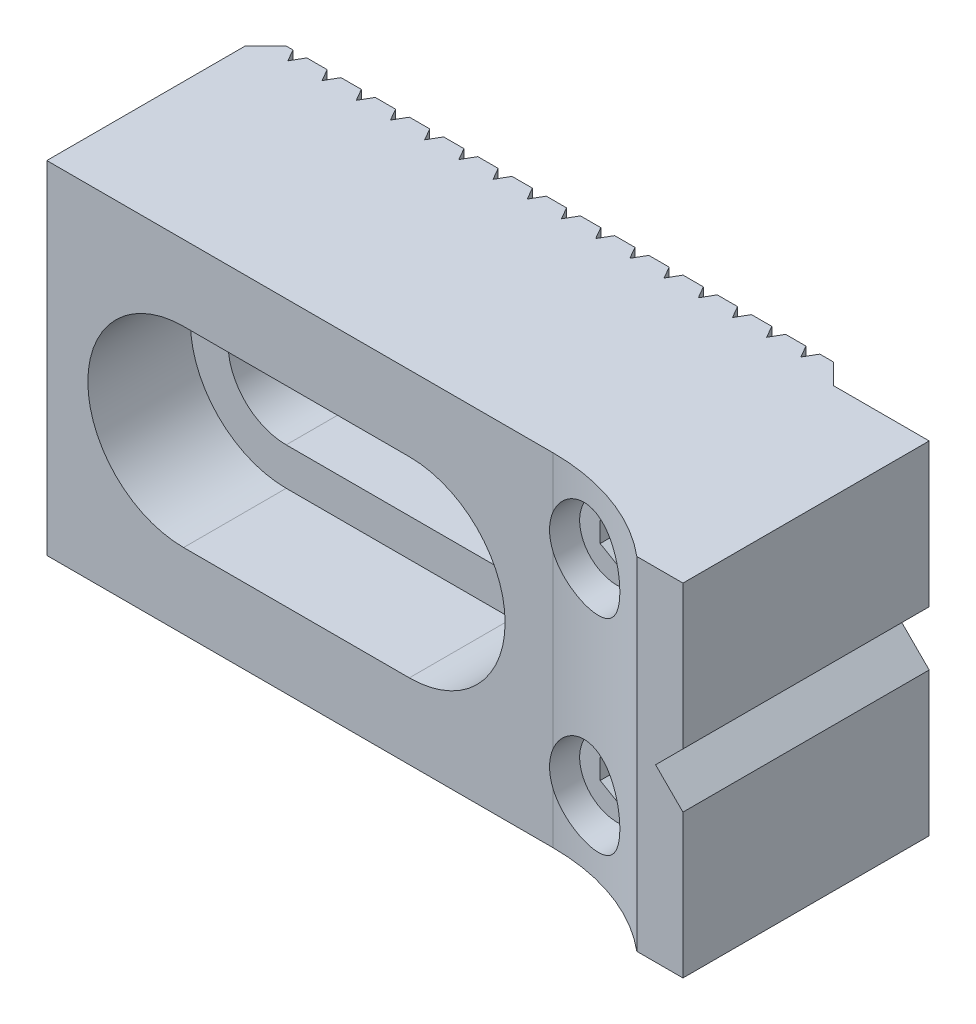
ISO-10303-21;
HEADER;
FILE_DESCRIPTION(('STEP AP214'),'2;1');
FILE_NAME('part.step','',(''),(''),'','','');
FILE_SCHEMA(('AUTOMOTIVE_DESIGN { 1 0 10303 214 1 1 1 1 }'));
ENDSEC;
DATA;
#1=APPLICATION_CONTEXT('core data for automotive mechanical design processes');
#2=APPLICATION_PROTOCOL_DEFINITION('international standard','automotive_design',2000,#1);
#3=PRODUCT_CONTEXT('',#1,'mechanical');
#4=PRODUCT('Part','Part','',(#3));
#5=PRODUCT_RELATED_PRODUCT_CATEGORY('part','',(#4));
#6=PRODUCT_DEFINITION_FORMATION('','',#4);
#7=PRODUCT_DEFINITION_CONTEXT('part definition',#1,'design');
#8=PRODUCT_DEFINITION('design','',#6,#7);
#9=PRODUCT_DEFINITION_SHAPE('','',#8);
#10=(LENGTH_UNIT() NAMED_UNIT(*) SI_UNIT(.MILLI.,.METRE.));
#11=(NAMED_UNIT(*) PLANE_ANGLE_UNIT() SI_UNIT($,.RADIAN.));
#12=(NAMED_UNIT(*) SI_UNIT($,.STERADIAN.) SOLID_ANGLE_UNIT());
#13=UNCERTAINTY_MEASURE_WITH_UNIT(LENGTH_MEASURE(1.E-05),#10,'distance_accuracy_value','');
#14=(GEOMETRIC_REPRESENTATION_CONTEXT(3) GLOBAL_UNCERTAINTY_ASSIGNED_CONTEXT((#13)) GLOBAL_UNIT_ASSIGNED_CONTEXT((#10,
#11,#12)) REPRESENTATION_CONTEXT('',''));
#15=CARTESIAN_POINT('',(0.,0.,0.));
#16=DIRECTION('',(0.,0.,1.));
#17=DIRECTION('',(1.,0.,0.));
#18=AXIS2_PLACEMENT_3D('',#15,#16,#17);
#19=CARTESIAN_POINT('',(-25.,12.5,0.));
#20=DIRECTION('',(0.,0.,-1.));
#21=DIRECTION('',(-1.,0.,0.));
#22=AXIS2_PLACEMENT_3D('',#19,#20,#21);
#23=PLANE('',#22);
#24=DIRECTION('',(0.,1.,0.));
#25=VECTOR('',#24,1.);
#26=CARTESIAN_POINT('',(12.9919317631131,-12.5,0.));
#27=LINE('',#26,#25);
#28=CARTESIAN_POINT('',(12.9919317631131,8.91133506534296,0.));
#29=VERTEX_POINT('',#28);
#30=CARTESIAN_POINT('',(12.9919317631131,12.5,0.));
#31=VERTEX_POINT('',#30);
#32=EDGE_CURVE('E939',#29,#31,#27,.T.);
#33=ORIENTED_EDGE('',*,*,#32,.F.);
#34=CARTESIAN_POINT('',(13.5,7.5,0.));
#35=DIRECTION('',(0.,0.,1.));
#36=DIRECTION('',(1.,0.,0.));
#37=AXIS2_PLACEMENT_3D('',#34,#35,#36);
#38=CIRCLE('',#37,1.49999999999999);
#39=CARTESIAN_POINT('',(12.9919317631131,6.08866493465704,0.));
#40=VERTEX_POINT('',#39);
#41=EDGE_CURVE('E782',#29,#40,#38,.T.);
#42=ORIENTED_EDGE('',*,*,#41,.T.);
#43=CARTESIAN_POINT('',(12.9919317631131,-6.08866493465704,0.));
#44=VERTEX_POINT('',#43);
#45=EDGE_CURVE('E945',#44,#40,#27,.T.);
#46=ORIENTED_EDGE('',*,*,#45,.F.);
#47=CARTESIAN_POINT('',(13.5,-7.5,0.));
#48=DIRECTION('',(0.,0.,1.));
#49=DIRECTION('',(1.,0.,0.));
#50=AXIS2_PLACEMENT_3D('',#47,#48,#49);
#51=CIRCLE('',#50,1.49999999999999);
#52=CARTESIAN_POINT('',(12.9919317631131,-8.91133506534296,0.));
#53=VERTEX_POINT('',#52);
#54=EDGE_CURVE('E793',#44,#53,#51,.T.);
#55=ORIENTED_EDGE('',*,*,#54,.T.);
#56=CARTESIAN_POINT('',(12.9919317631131,-12.5,0.));
#57=VERTEX_POINT('',#56);
#58=EDGE_CURVE('E941',#57,#53,#27,.T.);
#59=ORIENTED_EDGE('',*,*,#58,.F.);
#60=DIRECTION('',(1.,0.,0.));
#61=VECTOR('',#60,1.);
#62=CARTESIAN_POINT('',(-25.,-12.5,0.));
#63=LINE('',#62,#61);
#64=CARTESIAN_POINT('',(11.5080682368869,-12.5,0.));
#65=VERTEX_POINT('',#64);
#66=EDGE_CURVE('E1649',#65,#57,#63,.T.);
#67=ORIENTED_EDGE('',*,*,#66,.F.);
#68=DIRECTION('',(0.,1.,0.));
#69=VECTOR('',#68,1.);
#70=CARTESIAN_POINT('',(11.5080682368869,-12.5,0.));
#71=LINE('',#70,#69);
#72=CARTESIAN_POINT('',(11.5080682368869,12.5,0.));
#73=VERTEX_POINT('',#72);
#74=EDGE_CURVE('E957',#65,#73,#71,.T.);
#75=ORIENTED_EDGE('',*,*,#74,.T.);
#76=DIRECTION('',(1.,0.,0.));
#77=VECTOR('',#76,1.);
#78=CARTESIAN_POINT('',(-25.,12.5,0.));
#79=LINE('',#78,#77);
#80=EDGE_CURVE('E1523',#73,#31,#79,.T.);
#81=ORIENTED_EDGE('',*,*,#80,.T.);
#82=EDGE_LOOP('',(#33,#42,#46,#55,#59,#67,#75,#81));
#83=FACE_BOUND('',#82,.T.);
#84=ADVANCED_FACE('F15',(#83),#23,.T.);
#85=DIRECTION('',(0.,1.,0.));
#86=VECTOR('',#85,1.);
#87=CARTESIAN_POINT('',(14.0080682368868,-12.5,0.));
#88=LINE('',#87,#86);
#89=CARTESIAN_POINT('',(14.0080682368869,-6.08866493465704,0.));
#90=VERTEX_POINT('',#89);
#91=CARTESIAN_POINT('',(14.0080682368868,6.08866493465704,0.));
#92=VERTEX_POINT('',#91);
#93=EDGE_CURVE('E940',#90,#92,#88,.T.);
#94=ORIENTED_EDGE('',*,*,#93,.T.);
#95=CARTESIAN_POINT('',(15.,7.5,0.));
#96=VERTEX_POINT('',#95);
#97=EDGE_CURVE('E777',#92,#96,#38,.T.);
#98=ORIENTED_EDGE('',*,*,#97,.T.);
#99=DIRECTION('',(0.,-1.,0.));
#100=VECTOR('',#99,1.);
#101=CARTESIAN_POINT('',(15.,12.5,0.));
#102=LINE('',#101,#100);
#103=CARTESIAN_POINT('',(15.,-7.5,0.));
#104=VERTEX_POINT('',#103);
#105=EDGE_CURVE('E1300',#96,#104,#102,.T.);
#106=ORIENTED_EDGE('',*,*,#105,.T.);
#107=EDGE_CURVE('E789',#104,#90,#51,.T.);
#108=ORIENTED_EDGE('',*,*,#107,.T.);
#109=EDGE_LOOP('',(#94,#98,#106,#108));
#110=FACE_BOUND('',#109,.T.);
#111=ADVANCED_FACE('F1458',(#110),#23,.T.);
#112=CARTESIAN_POINT('',(15.,12.5,0.));
#113=VERTEX_POINT('',#112);
#114=EDGE_CURVE('E1296',#113,#96,#102,.T.);
#115=ORIENTED_EDGE('',*,*,#114,.T.);
#116=CARTESIAN_POINT('',(14.0080682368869,8.91133506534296,0.));
#117=VERTEX_POINT('',#116);
#118=EDGE_CURVE('E778',#96,#117,#38,.T.);
#119=ORIENTED_EDGE('',*,*,#118,.T.);
#120=CARTESIAN_POINT('',(14.0080682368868,12.5,0.));
#121=VERTEX_POINT('',#120);
#122=EDGE_CURVE('E934',#117,#121,#88,.T.);
#123=ORIENTED_EDGE('',*,*,#122,.T.);
#124=EDGE_CURVE('E1283',#121,#113,#79,.T.);
#125=ORIENTED_EDGE('',*,*,#124,.T.);
#126=EDGE_LOOP('',(#115,#119,#123,#125));
#127=FACE_BOUND('',#126,.T.);
#128=ADVANCED_FACE('F1465',(#127),#23,.T.);
#129=CARTESIAN_POINT('',(13.5,-12.5,0.88));
#130=DIRECTION('',(0.866025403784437,0.,-0.5));
#131=DIRECTION('',(-0.5,0.,-0.866025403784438));
#132=AXIS2_PLACEMENT_3D('',#129,#130,#131);
#133=PLANE('',#132);
#134=DIRECTION('',(0.,1.,0.));
#135=VECTOR('',#134,1.);
#136=CARTESIAN_POINT('',(13.5,-12.5,0.88));
#137=LINE('',#136,#135);
#138=CARTESIAN_POINT('',(13.5,9.,0.88));
#139=VERTEX_POINT('',#138);
#140=CARTESIAN_POINT('',(13.5,12.5,0.88));
#141=VERTEX_POINT('',#140);
#142=EDGE_CURVE('E929',#139,#141,#137,.T.);
#143=ORIENTED_EDGE('',*,*,#142,.F.);
#144=CARTESIAN_POINT('',(13.5,7.5,0.88));
#145=DIRECTION('',(0.866025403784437,0.,-0.5));
#146=DIRECTION('',(0.5,0.,0.866025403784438));
#147=AXIS2_PLACEMENT_3D('',#144,#145,#146);
#148=ELLIPSE('',#147,2.99999999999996,1.49999999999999);
#149=EDGE_CURVE('E788',#139,#29,#148,.F.);
#150=ORIENTED_EDGE('',*,*,#149,.T.);
#151=ORIENTED_EDGE('',*,*,#32,.T.);
#152=DIRECTION('',(-0.5,0.,-0.866025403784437));
#153=VECTOR('',#152,1.);
#154=CARTESIAN_POINT('',(13.5,12.5,0.88));
#155=LINE('',#154,#153);
#156=EDGE_CURVE('E919',#141,#31,#155,.T.);
#157=ORIENTED_EDGE('',*,*,#156,.F.);
#158=EDGE_LOOP('',(#143,#150,#151,#157));
#159=FACE_BOUND('',#158,.T.);
#160=ADVANCED_FACE('F1679',(#159),#133,.T.);
#161=ORIENTED_EDGE('',*,*,#45,.T.);
#162=CARTESIAN_POINT('',(13.5,6.,0.88));
#163=VERTEX_POINT('',#162);
#164=EDGE_CURVE('E784',#40,#163,#148,.F.);
#165=ORIENTED_EDGE('',*,*,#164,.T.);
#166=CARTESIAN_POINT('',(13.5,-6.,0.88));
#167=VERTEX_POINT('',#166);
#168=EDGE_CURVE('E935',#167,#163,#137,.T.);
#169=ORIENTED_EDGE('',*,*,#168,.F.);
#170=CARTESIAN_POINT('',(13.5,-7.5,0.88));
#171=DIRECTION('',(0.866025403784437,0.,-0.5));
#172=DIRECTION('',(0.5,0.,0.866025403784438));
#173=AXIS2_PLACEMENT_3D('',#170,#171,#172);
#174=ELLIPSE('',#173,2.99999999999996,1.49999999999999);
#175=EDGE_CURVE('E797',#167,#44,#174,.F.);
#176=ORIENTED_EDGE('',*,*,#175,.T.);
#177=EDGE_LOOP('',(#161,#165,#169,#176));
#178=FACE_BOUND('',#177,.T.);
#179=ADVANCED_FACE('F1688',(#178),#133,.T.);
#180=CARTESIAN_POINT('',(13.5,-12.5,0.88));
#181=DIRECTION('',(0.866025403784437,0.,0.5));
#182=DIRECTION('',(0.5,0.,-0.866025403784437));
#183=AXIS2_PLACEMENT_3D('',#180,#181,#182);
#184=PLANE('',#183);
#185=CARTESIAN_POINT('',(13.5,7.5,0.88));
#186=DIRECTION('',(0.866025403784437,0.,0.5));
#187=DIRECTION('',(-0.5,0.,0.866025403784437));
#188=AXIS2_PLACEMENT_3D('',#185,#186,#187);
#189=ELLIPSE('',#188,2.99999999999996,1.49999999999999);
#190=EDGE_CURVE('E785',#139,#117,#189,.F.);
#191=ORIENTED_EDGE('',*,*,#190,.F.);
#192=ORIENTED_EDGE('',*,*,#142,.T.);
#193=DIRECTION('',(0.5,0.,-0.866025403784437));
#194=VECTOR('',#193,1.);
#195=CARTESIAN_POINT('',(13.5,12.5,0.88));
#196=LINE('',#195,#194);
#197=EDGE_CURVE('E920',#141,#121,#196,.T.);
#198=ORIENTED_EDGE('',*,*,#197,.T.);
#199=ORIENTED_EDGE('',*,*,#122,.F.);
#200=EDGE_LOOP('',(#191,#192,#198,#199));
#201=FACE_BOUND('',#200,.T.);
#202=ADVANCED_FACE('F1677',(#201),#184,.F.);
#203=EDGE_CURVE('E781',#92,#163,#189,.F.);
#204=ORIENTED_EDGE('',*,*,#203,.F.);
#205=ORIENTED_EDGE('',*,*,#93,.F.);
#206=CARTESIAN_POINT('',(13.5,-7.5,0.88));
#207=DIRECTION('',(0.866025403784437,0.,0.5));
#208=DIRECTION('',(-0.5,0.,0.866025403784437));
#209=AXIS2_PLACEMENT_3D('',#206,#207,#208);
#210=ELLIPSE('',#209,2.99999999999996,1.49999999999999);
#211=EDGE_CURVE('E1310',#167,#90,#210,.F.);
#212=ORIENTED_EDGE('',*,*,#211,.F.);
#213=ORIENTED_EDGE('',*,*,#168,.T.);
#214=EDGE_LOOP('',(#204,#205,#212,#213));
#215=FACE_BOUND('',#214,.T.);
#216=ADVANCED_FACE('F1684',(#215),#184,.F.);
#217=CARTESIAN_POINT('',(14.0080682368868,-12.5,0.));
#218=VERTEX_POINT('',#217);
#219=CARTESIAN_POINT('',(14.0080682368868,-8.91133506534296,0.));
#220=VERTEX_POINT('',#219);
#221=EDGE_CURVE('E936',#218,#220,#88,.T.);
#222=ORIENTED_EDGE('',*,*,#221,.T.);
#223=EDGE_CURVE('E794',#220,#104,#51,.T.);
#224=ORIENTED_EDGE('',*,*,#223,.T.);
#225=CARTESIAN_POINT('',(15.,-12.5,0.));
#226=VERTEX_POINT('',#225);
#227=EDGE_CURVE('E1295',#104,#226,#102,.T.);
#228=ORIENTED_EDGE('',*,*,#227,.T.);
#229=EDGE_CURVE('E1269',#218,#226,#63,.T.);
#230=ORIENTED_EDGE('',*,*,#229,.F.);
#231=EDGE_LOOP('',(#222,#224,#228,#230));
#232=FACE_BOUND('',#231,.T.);
#233=ADVANCED_FACE('F1668',(#232),#23,.T.);
#234=ORIENTED_EDGE('',*,*,#58,.T.);
#235=CARTESIAN_POINT('',(13.5,-9.,0.88));
#236=VERTEX_POINT('',#235);
#237=EDGE_CURVE('E792',#53,#236,#174,.F.);
#238=ORIENTED_EDGE('',*,*,#237,.T.);
#239=CARTESIAN_POINT('',(13.5,-12.5,0.88));
#240=VERTEX_POINT('',#239);
#241=EDGE_CURVE('E931',#240,#236,#137,.T.);
#242=ORIENTED_EDGE('',*,*,#241,.F.);
#243=DIRECTION('',(-0.5,0.,-0.866025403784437));
#244=VECTOR('',#243,1.);
#245=CARTESIAN_POINT('',(13.5,-12.5,0.88));
#246=LINE('',#245,#244);
#247=EDGE_CURVE('E923',#240,#57,#246,.T.);
#248=ORIENTED_EDGE('',*,*,#247,.T.);
#249=EDGE_LOOP('',(#234,#238,#242,#248));
#250=FACE_BOUND('',#249,.T.);
#251=ADVANCED_FACE('F1698',(#250),#133,.T.);
#252=EDGE_CURVE('E1308',#220,#236,#210,.F.);
#253=ORIENTED_EDGE('',*,*,#252,.F.);
#254=ORIENTED_EDGE('',*,*,#221,.F.);
#255=DIRECTION('',(0.5,0.,-0.866025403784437));
#256=VECTOR('',#255,1.);
#257=CARTESIAN_POINT('',(13.5,-12.5,0.88));
#258=LINE('',#257,#256);
#259=EDGE_CURVE('E926',#240,#218,#258,.T.);
#260=ORIENTED_EDGE('',*,*,#259,.F.);
#261=ORIENTED_EDGE('',*,*,#241,.T.);
#262=EDGE_LOOP('',(#253,#254,#260,#261));
#263=FACE_BOUND('',#262,.T.);
#264=ADVANCED_FACE('F1700',(#263),#184,.F.);
#265=CARTESIAN_POINT('',(0.,0.,0.));
#266=DIRECTION('',(0.,0.,1.));
#267=DIRECTION('',(1.,0.,0.));
#268=AXIS2_PLACEMENT_3D('',#265,#266,#267);
#269=CIRCLE('',#268,4.25);
#270=CARTESIAN_POINT('',(2.99193176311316,3.01841751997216,0.));
#271=VERTEX_POINT('',#270);
#272=CARTESIAN_POINT('',(1.5080682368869,3.97344059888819,0.));
#273=VERTEX_POINT('',#272);
#274=EDGE_CURVE('E1702',#271,#273,#269,.T.);
#275=ORIENTED_EDGE('',*,*,#274,.T.);
#276=DIRECTION('',(0.,1.,0.));
#277=VECTOR('',#276,1.);
#278=CARTESIAN_POINT('',(1.50806823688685,-12.5,0.));
#279=LINE('',#278,#277);
#280=CARTESIAN_POINT('',(1.5080682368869,12.5,0.));
#281=VERTEX_POINT('',#280);
#282=EDGE_CURVE('E1034',#273,#281,#279,.T.);
#283=ORIENTED_EDGE('',*,*,#282,.T.);
#284=CARTESIAN_POINT('',(2.99193176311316,12.5,0.));
#285=VERTEX_POINT('',#284);
#286=EDGE_CURVE('E1538',#281,#285,#79,.T.);
#287=ORIENTED_EDGE('',*,*,#286,.T.);
#288=DIRECTION('',(0.,1.,0.));
#289=VECTOR('',#288,1.);
#290=CARTESIAN_POINT('',(2.99193176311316,-12.5,0.));
#291=LINE('',#290,#289);
#292=EDGE_CURVE('E1015',#271,#285,#291,.T.);
#293=ORIENTED_EDGE('',*,*,#292,.F.);
#294=EDGE_LOOP('',(#275,#283,#287,#293));
#295=FACE_BOUND('',#294,.T.);
#296=ADVANCED_FACE('F2476',(#295),#23,.T.);
#297=CARTESIAN_POINT('',(0.,-4.25,0.));
#298=VERTEX_POINT('',#297);
#299=CARTESIAN_POINT('',(0.49193176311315,-4.22143377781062,0.));
#300=VERTEX_POINT('',#299);
#301=EDGE_CURVE('E812',#298,#300,#269,.T.);
#302=ORIENTED_EDGE('',*,*,#301,.T.);
#303=DIRECTION('',(0.,1.,0.));
#304=VECTOR('',#303,1.);
#305=CARTESIAN_POINT('',(0.49193176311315,-12.5,0.));
#306=LINE('',#305,#304);
#307=CARTESIAN_POINT('',(0.49193176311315,-12.5,0.));
#308=VERTEX_POINT('',#307);
#309=EDGE_CURVE('E1039',#308,#300,#306,.T.);
#310=ORIENTED_EDGE('',*,*,#309,.F.);
#311=CARTESIAN_POINT('',(-0.991931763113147,-12.5,0.));
#312=VERTEX_POINT('',#311);
#313=EDGE_CURVE('E1629',#312,#308,#63,.T.);
#314=ORIENTED_EDGE('',*,*,#313,.F.);
#315=DIRECTION('',(0.,1.,0.));
#316=VECTOR('',#315,1.);
#317=CARTESIAN_POINT('',(-0.991931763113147,-12.5,0.));
#318=LINE('',#317,#316);
#319=CARTESIAN_POINT('',(-0.991931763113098,-4.25,0.));
#320=VERTEX_POINT('',#319);
#321=EDGE_CURVE('E1058',#312,#320,#318,.T.);
#322=ORIENTED_EDGE('',*,*,#321,.T.);
#323=DIRECTION('',(-1.,0.,0.));
#324=VECTOR('',#323,1.);
#325=CARTESIAN_POINT('',(0.,-4.25,0.));
#326=LINE('',#325,#324);
#327=EDGE_CURVE('E798',#298,#320,#326,.T.);
#328=ORIENTED_EDGE('',*,*,#327,.F.);
#329=EDGE_LOOP('',(#302,#310,#314,#322,#328));
#330=FACE_BOUND('',#329,.T.);
#331=ADVANCED_FACE('F2494',(#330),#23,.T.);
#332=DIRECTION('',(0.,1.,0.));
#333=VECTOR('',#332,1.);
#334=CARTESIAN_POINT('',(-3.49193176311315,-12.5,0.));
#335=LINE('',#334,#333);
#336=CARTESIAN_POINT('',(-3.49193176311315,-12.5,0.));
#337=VERTEX_POINT('',#336);
#338=CARTESIAN_POINT('',(-3.4919317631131,-4.25,0.));
#339=VERTEX_POINT('',#338);
#340=EDGE_CURVE('E1081',#337,#339,#335,.T.);
#341=ORIENTED_EDGE('',*,*,#340,.T.);
#342=CARTESIAN_POINT('',(-2.00806823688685,-4.25,0.));
#343=VERTEX_POINT('',#342);
#344=EDGE_CURVE('E801',#343,#339,#326,.T.);
#345=ORIENTED_EDGE('',*,*,#344,.F.);
#346=DIRECTION('',(0.,1.,0.));
#347=VECTOR('',#346,1.);
#348=CARTESIAN_POINT('',(-2.00806823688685,-12.5,0.));
#349=LINE('',#348,#347);
#350=CARTESIAN_POINT('',(-2.00806823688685,-12.5,0.));
#351=VERTEX_POINT('',#350);
#352=EDGE_CURVE('E1062',#351,#343,#349,.T.);
#353=ORIENTED_EDGE('',*,*,#352,.F.);
#354=EDGE_CURVE('E1625',#337,#351,#63,.T.);
#355=ORIENTED_EDGE('',*,*,#354,.F.);
#356=EDGE_LOOP('',(#341,#345,#353,#355));
#357=FACE_BOUND('',#356,.T.);
#358=ADVANCED_FACE('F2501',(#357),#23,.T.);
#359=CARTESIAN_POINT('',(-2.00806823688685,4.25,0.));
#360=VERTEX_POINT('',#359);
#361=CARTESIAN_POINT('',(-2.00806823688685,12.5,0.));
#362=VERTEX_POINT('',#361);
#363=EDGE_CURVE('E1061',#360,#362,#349,.T.);
#364=ORIENTED_EDGE('',*,*,#363,.F.);
#365=DIRECTION('',(1.,0.,0.));
#366=VECTOR('',#365,1.);
#367=CARTESIAN_POINT('',(-16.5,4.25,0.));
#368=LINE('',#367,#366);
#369=CARTESIAN_POINT('',(-3.4919317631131,4.25,0.));
#370=VERTEX_POINT('',#369);
#371=EDGE_CURVE('E811',#370,#360,#368,.T.);
#372=ORIENTED_EDGE('',*,*,#371,.F.);
#373=CARTESIAN_POINT('',(-3.49193176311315,12.5,0.));
#374=VERTEX_POINT('',#373);
#375=EDGE_CURVE('E1080',#370,#374,#335,.T.);
#376=ORIENTED_EDGE('',*,*,#375,.T.);
#377=EDGE_CURVE('E1548',#374,#362,#79,.T.);
#378=ORIENTED_EDGE('',*,*,#377,.T.);
#379=EDGE_LOOP('',(#364,#372,#376,#378));
#380=FACE_BOUND('',#379,.T.);
#381=ADVANCED_FACE('F2509',(#380),#23,.T.);
#382=DIRECTION('',(0.,1.,0.));
#383=VECTOR('',#382,1.);
#384=CARTESIAN_POINT('',(-5.99193176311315,-12.5,0.));
#385=LINE('',#384,#383);
#386=CARTESIAN_POINT('',(-5.99193176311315,-12.5,0.));
#387=VERTEX_POINT('',#386);
#388=CARTESIAN_POINT('',(-5.9919317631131,-4.25,0.));
#389=VERTEX_POINT('',#388);
#390=EDGE_CURVE('E1104',#387,#389,#385,.T.);
#391=ORIENTED_EDGE('',*,*,#390,.T.);
#392=CARTESIAN_POINT('',(-4.50806823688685,-4.25,0.));
#393=VERTEX_POINT('',#392);
#394=EDGE_CURVE('E2978',#393,#389,#326,.T.);
#395=ORIENTED_EDGE('',*,*,#394,.F.);
#396=DIRECTION('',(0.,1.,0.));
#397=VECTOR('',#396,1.);
#398=CARTESIAN_POINT('',(-4.50806823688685,-12.5,0.));
#399=LINE('',#398,#397);
#400=CARTESIAN_POINT('',(-4.50806823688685,-12.5,0.));
#401=VERTEX_POINT('',#400);
#402=EDGE_CURVE('E1085',#401,#393,#399,.T.);
#403=ORIENTED_EDGE('',*,*,#402,.F.);
#404=EDGE_CURVE('E1621',#387,#401,#63,.T.);
#405=ORIENTED_EDGE('',*,*,#404,.F.);
#406=EDGE_LOOP('',(#391,#395,#403,#405));
#407=FACE_BOUND('',#406,.T.);
#408=ADVANCED_FACE('F2776',(#407),#23,.T.);
#409=CARTESIAN_POINT('',(-4.50806823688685,4.25,0.));
#410=VERTEX_POINT('',#409);
#411=CARTESIAN_POINT('',(-4.50806823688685,12.5,0.));
#412=VERTEX_POINT('',#411);
#413=EDGE_CURVE('E1084',#410,#412,#399,.T.);
#414=ORIENTED_EDGE('',*,*,#413,.F.);
#415=CARTESIAN_POINT('',(-5.9919317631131,4.25,0.));
#416=VERTEX_POINT('',#415);
#417=EDGE_CURVE('E3011',#416,#410,#368,.T.);
#418=ORIENTED_EDGE('',*,*,#417,.F.);
#419=CARTESIAN_POINT('',(-5.9919317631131,12.5,0.));
#420=VERTEX_POINT('',#419);
#421=EDGE_CURVE('E1103',#416,#420,#385,.T.);
#422=ORIENTED_EDGE('',*,*,#421,.T.);
#423=EDGE_CURVE('E1553',#420,#412,#79,.T.);
#424=ORIENTED_EDGE('',*,*,#423,.T.);
#425=EDGE_LOOP('',(#414,#418,#422,#424));
#426=FACE_BOUND('',#425,.T.);
#427=ADVANCED_FACE('F2768',(#426),#23,.T.);
#428=DIRECTION('',(0.,1.,0.));
#429=VECTOR('',#428,1.);
#430=CARTESIAN_POINT('',(-8.49193176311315,-12.5,0.));
#431=LINE('',#430,#429);
#432=CARTESIAN_POINT('',(-8.49193176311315,-12.5,0.));
#433=VERTEX_POINT('',#432);
#434=CARTESIAN_POINT('',(-8.4919317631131,-4.25,0.));
#435=VERTEX_POINT('',#434);
#436=EDGE_CURVE('E1127',#433,#435,#431,.T.);
#437=ORIENTED_EDGE('',*,*,#436,.T.);
#438=CARTESIAN_POINT('',(-7.00806823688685,-4.25,0.));
#439=VERTEX_POINT('',#438);
#440=EDGE_CURVE('E2974',#439,#435,#326,.T.);
#441=ORIENTED_EDGE('',*,*,#440,.F.);
#442=DIRECTION('',(0.,1.,0.));
#443=VECTOR('',#442,1.);
#444=CARTESIAN_POINT('',(-7.00806823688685,-12.5,0.));
#445=LINE('',#444,#443);
#446=CARTESIAN_POINT('',(-7.00806823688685,-12.5,0.));
#447=VERTEX_POINT('',#446);
#448=EDGE_CURVE('E1108',#447,#439,#445,.T.);
#449=ORIENTED_EDGE('',*,*,#448,.F.);
#450=EDGE_CURVE('E1617',#433,#447,#63,.T.);
#451=ORIENTED_EDGE('',*,*,#450,.F.);
#452=EDGE_LOOP('',(#437,#441,#449,#451));
#453=FACE_BOUND('',#452,.T.);
#454=ADVANCED_FACE('F2761',(#453),#23,.T.);
#455=CARTESIAN_POINT('',(-7.00806823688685,4.25,0.));
#456=VERTEX_POINT('',#455);
#457=CARTESIAN_POINT('',(-7.00806823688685,12.5,0.));
#458=VERTEX_POINT('',#457);
#459=EDGE_CURVE('E1107',#456,#458,#445,.T.);
#460=ORIENTED_EDGE('',*,*,#459,.F.);
#461=CARTESIAN_POINT('',(-8.4919317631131,4.25,0.));
#462=VERTEX_POINT('',#461);
#463=EDGE_CURVE('E3009',#462,#456,#368,.T.);
#464=ORIENTED_EDGE('',*,*,#463,.F.);
#465=CARTESIAN_POINT('',(-8.49193176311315,12.5,0.));
#466=VERTEX_POINT('',#465);
#467=EDGE_CURVE('E1126',#462,#466,#431,.T.);
#468=ORIENTED_EDGE('',*,*,#467,.T.);
#469=EDGE_CURVE('E1558',#466,#458,#79,.T.);
#470=ORIENTED_EDGE('',*,*,#469,.T.);
#471=EDGE_LOOP('',(#460,#464,#468,#470));
#472=FACE_BOUND('',#471,.T.);
#473=ADVANCED_FACE('F2753',(#472),#23,.T.);
#474=DIRECTION('',(0.,1.,0.));
#475=VECTOR('',#474,1.);
#476=CARTESIAN_POINT('',(-10.9919317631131,-12.5,0.));
#477=LINE('',#476,#475);
#478=CARTESIAN_POINT('',(-10.9919317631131,-12.5,0.));
#479=VERTEX_POINT('',#478);
#480=CARTESIAN_POINT('',(-10.9919317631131,-4.25,0.));
#481=VERTEX_POINT('',#480);
#482=EDGE_CURVE('E1150',#479,#481,#477,.T.);
#483=ORIENTED_EDGE('',*,*,#482,.T.);
#484=CARTESIAN_POINT('',(-9.50806823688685,-4.25,0.));
#485=VERTEX_POINT('',#484);
#486=EDGE_CURVE('E2970',#485,#481,#326,.T.);
#487=ORIENTED_EDGE('',*,*,#486,.F.);
#488=DIRECTION('',(0.,1.,0.));
#489=VECTOR('',#488,1.);
#490=CARTESIAN_POINT('',(-9.50806823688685,-12.5,0.));
#491=LINE('',#490,#489);
#492=CARTESIAN_POINT('',(-9.50806823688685,-12.5,0.));
#493=VERTEX_POINT('',#492);
#494=EDGE_CURVE('E1131',#493,#485,#491,.T.);
#495=ORIENTED_EDGE('',*,*,#494,.F.);
#496=EDGE_CURVE('E1613',#479,#493,#63,.T.);
#497=ORIENTED_EDGE('',*,*,#496,.F.);
#498=EDGE_LOOP('',(#483,#487,#495,#497));
#499=FACE_BOUND('',#498,.T.);
#500=ADVANCED_FACE('F2746',(#499),#23,.T.);
#501=CARTESIAN_POINT('',(-9.50806823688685,4.25,0.));
#502=VERTEX_POINT('',#501);
#503=CARTESIAN_POINT('',(-9.50806823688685,12.5,0.));
#504=VERTEX_POINT('',#503);
#505=EDGE_CURVE('E1130',#502,#504,#491,.T.);
#506=ORIENTED_EDGE('',*,*,#505,.F.);
#507=CARTESIAN_POINT('',(-10.9919317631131,4.25,0.));
#508=VERTEX_POINT('',#507);
#509=EDGE_CURVE('E3007',#508,#502,#368,.T.);
#510=ORIENTED_EDGE('',*,*,#509,.F.);
#511=CARTESIAN_POINT('',(-10.9919317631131,12.5,0.));
#512=VERTEX_POINT('',#511);
#513=EDGE_CURVE('E1149',#508,#512,#477,.T.);
#514=ORIENTED_EDGE('',*,*,#513,.T.);
#515=EDGE_CURVE('E1563',#512,#504,#79,.T.);
#516=ORIENTED_EDGE('',*,*,#515,.T.);
#517=EDGE_LOOP('',(#506,#510,#514,#516));
#518=FACE_BOUND('',#517,.T.);
#519=ADVANCED_FACE('F2738',(#518),#23,.T.);
#520=DIRECTION('',(0.,1.,0.));
#521=VECTOR('',#520,1.);
#522=CARTESIAN_POINT('',(-13.4919317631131,-12.5,0.));
#523=LINE('',#522,#521);
#524=CARTESIAN_POINT('',(-13.4919317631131,-12.5,0.));
#525=VERTEX_POINT('',#524);
#526=CARTESIAN_POINT('',(-13.4919317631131,-4.25,0.));
#527=VERTEX_POINT('',#526);
#528=EDGE_CURVE('E1173',#525,#527,#523,.T.);
#529=ORIENTED_EDGE('',*,*,#528,.T.);
#530=CARTESIAN_POINT('',(-12.0080682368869,-4.25,0.));
#531=VERTEX_POINT('',#530);
#532=EDGE_CURVE('E2966',#531,#527,#326,.T.);
#533=ORIENTED_EDGE('',*,*,#532,.F.);
#534=DIRECTION('',(0.,1.,0.));
#535=VECTOR('',#534,1.);
#536=CARTESIAN_POINT('',(-12.0080682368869,-12.5,0.));
#537=LINE('',#536,#535);
#538=CARTESIAN_POINT('',(-12.0080682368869,-12.5,0.));
#539=VERTEX_POINT('',#538);
#540=EDGE_CURVE('E1154',#539,#531,#537,.T.);
#541=ORIENTED_EDGE('',*,*,#540,.F.);
#542=EDGE_CURVE('E1609',#525,#539,#63,.T.);
#543=ORIENTED_EDGE('',*,*,#542,.F.);
#544=EDGE_LOOP('',(#529,#533,#541,#543));
#545=FACE_BOUND('',#544,.T.);
#546=ADVANCED_FACE('F2731',(#545),#23,.T.);
#547=CARTESIAN_POINT('',(-12.0080682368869,4.25,0.));
#548=VERTEX_POINT('',#547);
#549=CARTESIAN_POINT('',(-12.0080682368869,12.5,0.));
#550=VERTEX_POINT('',#549);
#551=EDGE_CURVE('E1153',#548,#550,#537,.T.);
#552=ORIENTED_EDGE('',*,*,#551,.F.);
#553=CARTESIAN_POINT('',(-13.4919317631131,4.25,0.));
#554=VERTEX_POINT('',#553);
#555=EDGE_CURVE('E3006',#554,#548,#368,.T.);
#556=ORIENTED_EDGE('',*,*,#555,.F.);
#557=CARTESIAN_POINT('',(-13.4919317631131,12.5,0.));
#558=VERTEX_POINT('',#557);
#559=EDGE_CURVE('E1172',#554,#558,#523,.T.);
#560=ORIENTED_EDGE('',*,*,#559,.T.);
#561=EDGE_CURVE('E1568',#558,#550,#79,.T.);
#562=ORIENTED_EDGE('',*,*,#561,.T.);
#563=EDGE_LOOP('',(#552,#556,#560,#562));
#564=FACE_BOUND('',#563,.T.);
#565=ADVANCED_FACE('F2723',(#564),#23,.T.);
#566=DIRECTION('',(0.,1.,0.));
#567=VECTOR('',#566,1.);
#568=CARTESIAN_POINT('',(-15.9919317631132,-12.5,0.));
#569=LINE('',#568,#567);
#570=CARTESIAN_POINT('',(-15.9919317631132,-12.5,0.));
#571=VERTEX_POINT('',#570);
#572=CARTESIAN_POINT('',(-15.9919317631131,-4.25,0.));
#573=VERTEX_POINT('',#572);
#574=EDGE_CURVE('E1196',#571,#573,#569,.T.);
#575=ORIENTED_EDGE('',*,*,#574,.T.);
#576=CARTESIAN_POINT('',(-14.5080682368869,-4.25,0.));
#577=VERTEX_POINT('',#576);
#578=EDGE_CURVE('E802',#577,#573,#326,.T.);
#579=ORIENTED_EDGE('',*,*,#578,.F.);
#580=DIRECTION('',(0.,1.,0.));
#581=VECTOR('',#580,1.);
#582=CARTESIAN_POINT('',(-14.5080682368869,-12.5,0.));
#583=LINE('',#582,#581);
#584=CARTESIAN_POINT('',(-14.5080682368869,-12.5,0.));
#585=VERTEX_POINT('',#584);
#586=EDGE_CURVE('E1177',#585,#577,#583,.T.);
#587=ORIENTED_EDGE('',*,*,#586,.F.);
#588=EDGE_CURVE('E1605',#571,#585,#63,.T.);
#589=ORIENTED_EDGE('',*,*,#588,.F.);
#590=EDGE_LOOP('',(#575,#579,#587,#589));
#591=FACE_BOUND('',#590,.T.);
#592=ADVANCED_FACE('F2716',(#591),#23,.T.);
#593=CARTESIAN_POINT('',(-14.5080682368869,4.25,0.));
#594=VERTEX_POINT('',#593);
#595=CARTESIAN_POINT('',(-14.5080682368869,12.5,0.));
#596=VERTEX_POINT('',#595);
#597=EDGE_CURVE('E1176',#594,#596,#583,.T.);
#598=ORIENTED_EDGE('',*,*,#597,.F.);
#599=CARTESIAN_POINT('',(-15.9919317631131,4.25,0.));
#600=VERTEX_POINT('',#599);
#601=EDGE_CURVE('E807',#600,#594,#368,.T.);
#602=ORIENTED_EDGE('',*,*,#601,.F.);
#603=CARTESIAN_POINT('',(-15.9919317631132,12.5,0.));
#604=VERTEX_POINT('',#603);
#605=EDGE_CURVE('E1195',#600,#604,#569,.T.);
#606=ORIENTED_EDGE('',*,*,#605,.T.);
#607=EDGE_CURVE('E1573',#604,#596,#79,.T.);
#608=ORIENTED_EDGE('',*,*,#607,.T.);
#609=EDGE_LOOP('',(#598,#602,#606,#608));
#610=FACE_BOUND('',#609,.T.);
#611=ADVANCED_FACE('F2709',(#610),#23,.T.);
#612=CARTESIAN_POINT('',(-16.5,0.,0.));
#613=DIRECTION('',(0.,0.,1.));
#614=DIRECTION('',(1.,0.,0.));
#615=AXIS2_PLACEMENT_3D('',#612,#613,#614);
#616=CIRCLE('',#615,4.25);
#617=CARTESIAN_POINT('',(-17.0080682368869,4.21952208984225,0.));
#618=VERTEX_POINT('',#617);
#619=CARTESIAN_POINT('',(-18.4919317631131,3.75429192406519,0.));
#620=VERTEX_POINT('',#619);
#621=EDGE_CURVE('E808',#618,#620,#616,.T.);
#622=ORIENTED_EDGE('',*,*,#621,.T.);
#623=DIRECTION('',(0.,1.,0.));
#624=VECTOR('',#623,1.);
#625=CARTESIAN_POINT('',(-18.4919317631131,-12.5,0.));
#626=LINE('',#625,#624);
#627=CARTESIAN_POINT('',(-18.4919317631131,12.5,0.));
#628=VERTEX_POINT('',#627);
#629=EDGE_CURVE('E1218',#620,#628,#626,.T.);
#630=ORIENTED_EDGE('',*,*,#629,.T.);
#631=CARTESIAN_POINT('',(-17.0080682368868,12.5,0.));
#632=VERTEX_POINT('',#631);
#633=EDGE_CURVE('E1578',#628,#632,#79,.T.);
#634=ORIENTED_EDGE('',*,*,#633,.T.);
#635=DIRECTION('',(0.,1.,0.));
#636=VECTOR('',#635,1.);
#637=CARTESIAN_POINT('',(-17.0080682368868,-12.5,0.));
#638=LINE('',#637,#636);
#639=EDGE_CURVE('E1199',#618,#632,#638,.T.);
#640=ORIENTED_EDGE('',*,*,#639,.F.);
#641=EDGE_LOOP('',(#622,#630,#634,#640));
#642=FACE_BOUND('',#641,.T.);
#643=ADVANCED_FACE('F2423',(#642),#23,.T.);
#644=CARTESIAN_POINT('',(-19.,-12.5,0.88));
#645=DIRECTION('',(0.866025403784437,0.,-0.5));
#646=DIRECTION('',(-0.5,0.,-0.866025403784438));
#647=AXIS2_PLACEMENT_3D('',#644,#645,#646);
#648=PLANE('',#647);
#649=CARTESIAN_POINT('',(-16.5,0.,5.21012701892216));
#650=DIRECTION('',(0.866025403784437,0.,-0.5));
#651=DIRECTION('',(0.5,0.,0.866025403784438));
#652=AXIS2_PLACEMENT_3D('',#649,#650,#651);
#653=ELLIPSE('',#652,8.5,4.25);
#654=CARTESIAN_POINT('',(-19.,-3.43693177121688,0.88));
#655=VERTEX_POINT('',#654);
#656=CARTESIAN_POINT('',(-19.5080682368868,-3.00233667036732,0.));
#657=VERTEX_POINT('',#656);
#658=EDGE_CURVE('E898',#655,#657,#653,.T.);
#659=ORIENTED_EDGE('',*,*,#658,.F.);
#660=DIRECTION('',(0.,1.,0.));
#661=VECTOR('',#660,1.);
#662=CARTESIAN_POINT('',(-19.,-12.5,0.88));
#663=LINE('',#662,#661);
#664=CARTESIAN_POINT('',(-19.,-12.5,0.88));
#665=VERTEX_POINT('',#664);
#666=EDGE_CURVE('E1215',#665,#655,#663,.T.);
#667=ORIENTED_EDGE('',*,*,#666,.F.);
#668=DIRECTION('',(-0.5,0.,-0.866025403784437));
#669=VECTOR('',#668,1.);
#670=CARTESIAN_POINT('',(-19.,-12.5,0.88));
#671=LINE('',#670,#669);
#672=CARTESIAN_POINT('',(-19.5080682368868,-12.5,0.));
#673=VERTEX_POINT('',#672);
#674=EDGE_CURVE('E1207',#665,#673,#671,.T.);
#675=ORIENTED_EDGE('',*,*,#674,.T.);
#676=DIRECTION('',(0.,1.,0.));
#677=VECTOR('',#676,1.);
#678=CARTESIAN_POINT('',(-19.5080682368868,-12.5,0.));
#679=LINE('',#678,#677);
#680=EDGE_CURVE('E1223',#673,#657,#679,.T.);
#681=ORIENTED_EDGE('',*,*,#680,.T.);
#682=EDGE_LOOP('',(#659,#667,#675,#681));
#683=FACE_BOUND('',#682,.T.);
#684=ADVANCED_FACE('F1852',(#683),#648,.T.);
#685=CARTESIAN_POINT('',(-19.,-12.5,0.88));
#686=DIRECTION('',(0.866025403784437,0.,0.5));
#687=DIRECTION('',(0.5,0.,-0.866025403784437));
#688=AXIS2_PLACEMENT_3D('',#685,#686,#687);
#689=PLANE('',#688);
#690=ORIENTED_EDGE('',*,*,#666,.T.);
#691=CARTESIAN_POINT('',(-16.5,0.,-3.45012701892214));
#692=DIRECTION('',(0.866025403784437,0.,0.5));
#693=DIRECTION('',(-0.5,0.,0.866025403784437));
#694=AXIS2_PLACEMENT_3D('',#691,#692,#693);
#695=ELLIPSE('',#694,8.5,4.25);
#696=CARTESIAN_POINT('',(-18.4919317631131,-3.75429192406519,0.));
#697=VERTEX_POINT('',#696);
#698=EDGE_CURVE('E896',#655,#697,#695,.T.);
#699=ORIENTED_EDGE('',*,*,#698,.T.);
#700=CARTESIAN_POINT('',(-18.4919317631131,-12.5,0.));
#701=VERTEX_POINT('',#700);
#702=EDGE_CURVE('E1219',#701,#697,#626,.T.);
#703=ORIENTED_EDGE('',*,*,#702,.F.);
#704=DIRECTION('',(0.5,0.,-0.866025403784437));
#705=VECTOR('',#704,1.);
#706=CARTESIAN_POINT('',(-19.,-12.5,0.88));
#707=LINE('',#706,#705);
#708=EDGE_CURVE('E1210',#665,#701,#707,.T.);
#709=ORIENTED_EDGE('',*,*,#708,.F.);
#710=EDGE_LOOP('',(#690,#699,#703,#709));
#711=FACE_BOUND('',#710,.T.);
#712=ADVANCED_FACE('F1856',(#711),#689,.F.);
#713=CARTESIAN_POINT('',(-16.5,-12.5,0.88));
#714=DIRECTION('',(0.866025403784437,0.,-0.5));
#715=DIRECTION('',(-0.5,0.,-0.866025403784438));
#716=AXIS2_PLACEMENT_3D('',#713,#714,#715);
#717=PLANE('',#716);
#718=CARTESIAN_POINT('',(-16.5,0.,0.88));
#719=DIRECTION('',(0.866025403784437,0.,-0.5));
#720=DIRECTION('',(0.5,0.,0.866025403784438));
#721=AXIS2_PLACEMENT_3D('',#718,#719,#720);
#722=ELLIPSE('',#721,8.5,4.25);
#723=CARTESIAN_POINT('',(-16.5,-4.25,0.88));
#724=VERTEX_POINT('',#723);
#725=CARTESIAN_POINT('',(-17.0080682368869,-4.21952208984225,0.));
#726=VERTEX_POINT('',#725);
#727=EDGE_CURVE('E891',#724,#726,#722,.T.);
#728=ORIENTED_EDGE('',*,*,#727,.F.);
#729=DIRECTION('',(0.,1.,0.));
#730=VECTOR('',#729,1.);
#731=CARTESIAN_POINT('',(-16.5,-12.5,0.88));
#732=LINE('',#731,#730);
#733=CARTESIAN_POINT('',(-16.5,-12.5,0.88));
#734=VERTEX_POINT('',#733);
#735=EDGE_CURVE('E1192',#734,#724,#732,.T.);
#736=ORIENTED_EDGE('',*,*,#735,.F.);
#737=DIRECTION('',(-0.5,0.,-0.866025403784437));
#738=VECTOR('',#737,1.);
#739=CARTESIAN_POINT('',(-16.5,-12.5,0.88));
#740=LINE('',#739,#738);
#741=CARTESIAN_POINT('',(-17.0080682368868,-12.5,0.));
#742=VERTEX_POINT('',#741);
#743=EDGE_CURVE('E1184',#734,#742,#740,.T.);
#744=ORIENTED_EDGE('',*,*,#743,.T.);
#745=EDGE_CURVE('E1200',#742,#726,#638,.T.);
#746=ORIENTED_EDGE('',*,*,#745,.T.);
#747=EDGE_LOOP('',(#728,#736,#744,#746));
#748=FACE_BOUND('',#747,.T.);
#749=ADVANCED_FACE('F1842',(#748),#717,.T.);
#750=CARTESIAN_POINT('',(-16.5,-12.5,0.88));
#751=DIRECTION('',(0.866025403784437,0.,0.5));
#752=DIRECTION('',(0.5,0.,-0.866025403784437));
#753=AXIS2_PLACEMENT_3D('',#750,#751,#752);
#754=PLANE('',#753);
#755=DIRECTION('',(-0.5,0.,0.866025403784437));
#756=VECTOR('',#755,1.);
#757=CARTESIAN_POINT('',(-16.5,-4.25,0.88));
#758=LINE('',#757,#756);
#759=EDGE_CURVE('E748',#573,#724,#758,.T.);
#760=ORIENTED_EDGE('',*,*,#759,.F.);
#761=ORIENTED_EDGE('',*,*,#574,.F.);
#762=DIRECTION('',(0.5,0.,-0.866025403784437));
#763=VECTOR('',#762,1.);
#764=CARTESIAN_POINT('',(-16.5,-12.5,0.88));
#765=LINE('',#764,#763);
#766=EDGE_CURVE('E1187',#734,#571,#765,.T.);
#767=ORIENTED_EDGE('',*,*,#766,.F.);
#768=ORIENTED_EDGE('',*,*,#735,.T.);
#769=EDGE_LOOP('',(#760,#761,#767,#768));
#770=FACE_BOUND('',#769,.T.);
#771=ADVANCED_FACE('F1843',(#770),#754,.F.);
#772=DIRECTION('',(0.5,0.,-0.866025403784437));
#773=VECTOR('',#772,1.);
#774=CARTESIAN_POINT('',(-16.5,4.25,0.88));
#775=LINE('',#774,#773);
#776=CARTESIAN_POINT('',(-16.5,4.25,0.88));
#777=VERTEX_POINT('',#776);
#778=EDGE_CURVE('E858',#777,#600,#775,.T.);
#779=ORIENTED_EDGE('',*,*,#778,.F.);
#780=CARTESIAN_POINT('',(-16.5,12.5,0.88));
#781=VERTEX_POINT('',#780);
#782=EDGE_CURVE('E1190',#777,#781,#732,.T.);
#783=ORIENTED_EDGE('',*,*,#782,.T.);
#784=DIRECTION('',(0.5,0.,-0.866025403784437));
#785=VECTOR('',#784,1.);
#786=CARTESIAN_POINT('',(-16.5,12.5,0.88));
#787=LINE('',#786,#785);
#788=EDGE_CURVE('E1181',#781,#604,#787,.T.);
#789=ORIENTED_EDGE('',*,*,#788,.T.);
#790=ORIENTED_EDGE('',*,*,#605,.F.);
#791=EDGE_LOOP('',(#779,#783,#789,#790));
#792=FACE_BOUND('',#791,.T.);
#793=ADVANCED_FACE('F1832',(#792),#754,.F.);
#794=CARTESIAN_POINT('',(-14.,-12.5,0.88));
#795=DIRECTION('',(0.866025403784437,0.,-0.5));
#796=DIRECTION('',(-0.5,0.,-0.866025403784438));
#797=AXIS2_PLACEMENT_3D('',#794,#795,#796);
#798=PLANE('',#797);
#799=ORIENTED_EDGE('',*,*,#586,.T.);
#800=DIRECTION('',(0.5,0.,0.866025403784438));
#801=VECTOR('',#800,1.);
#802=CARTESIAN_POINT('',(-14.,-4.25,0.88));
#803=LINE('',#802,#801);
#804=CARTESIAN_POINT('',(-14.,-4.25,0.88));
#805=VERTEX_POINT('',#804);
#806=EDGE_CURVE('E885',#577,#805,#803,.T.);
#807=ORIENTED_EDGE('',*,*,#806,.T.);
#808=DIRECTION('',(0.,1.,0.));
#809=VECTOR('',#808,1.);
#810=CARTESIAN_POINT('',(-14.,-12.5,0.88));
#811=LINE('',#810,#809);
#812=CARTESIAN_POINT('',(-14.,-12.5,0.88));
#813=VERTEX_POINT('',#812);
#814=EDGE_CURVE('E1169',#813,#805,#811,.T.);
#815=ORIENTED_EDGE('',*,*,#814,.F.);
#816=DIRECTION('',(-0.5,0.,-0.866025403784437));
#817=VECTOR('',#816,1.);
#818=CARTESIAN_POINT('',(-14.,-12.5,0.88));
#819=LINE('',#818,#817);
#820=EDGE_CURVE('E1161',#813,#585,#819,.T.);
#821=ORIENTED_EDGE('',*,*,#820,.T.);
#822=EDGE_LOOP('',(#799,#807,#815,#821));
#823=FACE_BOUND('',#822,.T.);
#824=ADVANCED_FACE('F1828',(#823),#798,.T.);
#825=CARTESIAN_POINT('',(-14.,4.25,0.88));
#826=VERTEX_POINT('',#825);
#827=CARTESIAN_POINT('',(-14.,12.5,0.88));
#828=VERTEX_POINT('',#827);
#829=EDGE_CURVE('E1167',#826,#828,#811,.T.);
#830=ORIENTED_EDGE('',*,*,#829,.F.);
#831=DIRECTION('',(-0.5,0.,-0.866025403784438));
#832=VECTOR('',#831,1.);
#833=CARTESIAN_POINT('',(-14.,4.25,0.88));
#834=LINE('',#833,#832);
#835=EDGE_CURVE('E855',#826,#594,#834,.T.);
#836=ORIENTED_EDGE('',*,*,#835,.T.);
#837=ORIENTED_EDGE('',*,*,#597,.T.);
#838=DIRECTION('',(-0.5,0.,-0.866025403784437));
#839=VECTOR('',#838,1.);
#840=CARTESIAN_POINT('',(-14.,12.5,0.88));
#841=LINE('',#840,#839);
#842=EDGE_CURVE('E1157',#828,#596,#841,.T.);
#843=ORIENTED_EDGE('',*,*,#842,.F.);
#844=EDGE_LOOP('',(#830,#836,#837,#843));
#845=FACE_BOUND('',#844,.T.);
#846=ADVANCED_FACE('F1831',(#845),#798,.T.);
#847=CARTESIAN_POINT('',(-14.,-12.5,0.88));
#848=DIRECTION('',(0.866025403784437,0.,0.5));
#849=DIRECTION('',(0.5,0.,-0.866025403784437));
#850=AXIS2_PLACEMENT_3D('',#847,#848,#849);
#851=PLANE('',#850);
#852=DIRECTION('',(-0.5,0.,0.866025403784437));
#853=VECTOR('',#852,1.);
#854=CARTESIAN_POINT('',(-14.,-4.25,0.88));
#855=LINE('',#854,#853);
#856=EDGE_CURVE('E883',#527,#805,#855,.T.);
#857=ORIENTED_EDGE('',*,*,#856,.F.);
#858=ORIENTED_EDGE('',*,*,#528,.F.);
#859=DIRECTION('',(0.5,0.,-0.866025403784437));
#860=VECTOR('',#859,1.);
#861=CARTESIAN_POINT('',(-14.,-12.5,0.88));
#862=LINE('',#861,#860);
#863=EDGE_CURVE('E1164',#813,#525,#862,.T.);
#864=ORIENTED_EDGE('',*,*,#863,.F.);
#865=ORIENTED_EDGE('',*,*,#814,.T.);
#866=EDGE_LOOP('',(#857,#858,#864,#865));
#867=FACE_BOUND('',#866,.T.);
#868=ADVANCED_FACE('F1834',(#867),#851,.F.);
#869=DIRECTION('',(0.5,0.,-0.866025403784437));
#870=VECTOR('',#869,1.);
#871=CARTESIAN_POINT('',(-14.,4.25,0.88));
#872=LINE('',#871,#870);
#873=EDGE_CURVE('E853',#826,#554,#872,.T.);
#874=ORIENTED_EDGE('',*,*,#873,.F.);
#875=ORIENTED_EDGE('',*,*,#829,.T.);
#876=DIRECTION('',(0.5,0.,-0.866025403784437));
#877=VECTOR('',#876,1.);
#878=CARTESIAN_POINT('',(-14.,12.5,0.88));
#879=LINE('',#878,#877);
#880=EDGE_CURVE('E1158',#828,#558,#879,.T.);
#881=ORIENTED_EDGE('',*,*,#880,.T.);
#882=ORIENTED_EDGE('',*,*,#559,.F.);
#883=EDGE_LOOP('',(#874,#875,#881,#882));
#884=FACE_BOUND('',#883,.T.);
#885=ADVANCED_FACE('F1822',(#884),#851,.F.);
#886=CARTESIAN_POINT('',(-11.5,-12.5,0.88));
#887=DIRECTION('',(0.866025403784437,0.,-0.5));
#888=DIRECTION('',(-0.5,0.,-0.866025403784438));
#889=AXIS2_PLACEMENT_3D('',#886,#887,#888);
#890=PLANE('',#889);
#891=ORIENTED_EDGE('',*,*,#540,.T.);
#892=DIRECTION('',(0.5,0.,0.866025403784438));
#893=VECTOR('',#892,1.);
#894=CARTESIAN_POINT('',(-11.5,-4.25,0.88));
#895=LINE('',#894,#893);
#896=CARTESIAN_POINT('',(-11.5,-4.25,0.88));
#897=VERTEX_POINT('',#896);
#898=EDGE_CURVE('E880',#531,#897,#895,.T.);
#899=ORIENTED_EDGE('',*,*,#898,.T.);
#900=DIRECTION('',(0.,1.,0.));
#901=VECTOR('',#900,1.);
#902=CARTESIAN_POINT('',(-11.5,-12.5,0.88));
#903=LINE('',#902,#901);
#904=CARTESIAN_POINT('',(-11.5,-12.5,0.88));
#905=VERTEX_POINT('',#904);
#906=EDGE_CURVE('E1146',#905,#897,#903,.T.);
#907=ORIENTED_EDGE('',*,*,#906,.F.);
#908=DIRECTION('',(-0.5,0.,-0.866025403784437));
#909=VECTOR('',#908,1.);
#910=CARTESIAN_POINT('',(-11.5,-12.5,0.88));
#911=LINE('',#910,#909);
#912=EDGE_CURVE('E1138',#905,#539,#911,.T.);
#913=ORIENTED_EDGE('',*,*,#912,.T.);
#914=EDGE_LOOP('',(#891,#899,#907,#913));
#915=FACE_BOUND('',#914,.T.);
#916=ADVANCED_FACE('F1818',(#915),#890,.T.);
#917=CARTESIAN_POINT('',(-11.5,4.25,0.88));
#918=VERTEX_POINT('',#917);
#919=CARTESIAN_POINT('',(-11.5,12.5,0.88));
#920=VERTEX_POINT('',#919);
#921=EDGE_CURVE('E1144',#918,#920,#903,.T.);
#922=ORIENTED_EDGE('',*,*,#921,.F.);
#923=DIRECTION('',(-0.5,0.,-0.866025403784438));
#924=VECTOR('',#923,1.);
#925=CARTESIAN_POINT('',(-11.5,4.25,0.88));
#926=LINE('',#925,#924);
#927=EDGE_CURVE('E850',#918,#548,#926,.T.);
#928=ORIENTED_EDGE('',*,*,#927,.T.);
#929=ORIENTED_EDGE('',*,*,#551,.T.);
#930=DIRECTION('',(-0.5,0.,-0.866025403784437));
#931=VECTOR('',#930,1.);
#932=CARTESIAN_POINT('',(-11.5,12.5,0.88));
#933=LINE('',#932,#931);
#934=EDGE_CURVE('E1134',#920,#550,#933,.T.);
#935=ORIENTED_EDGE('',*,*,#934,.F.);
#936=EDGE_LOOP('',(#922,#928,#929,#935));
#937=FACE_BOUND('',#936,.T.);
#938=ADVANCED_FACE('F1821',(#937),#890,.T.);
#939=CARTESIAN_POINT('',(-11.5,-12.5,0.88));
#940=DIRECTION('',(0.866025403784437,0.,0.5));
#941=DIRECTION('',(0.5,0.,-0.866025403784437));
#942=AXIS2_PLACEMENT_3D('',#939,#940,#941);
#943=PLANE('',#942);
#944=DIRECTION('',(-0.5,0.,0.866025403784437));
#945=VECTOR('',#944,1.);
#946=CARTESIAN_POINT('',(-11.5,-4.25,0.88));
#947=LINE('',#946,#945);
#948=EDGE_CURVE('E878',#481,#897,#947,.T.);
#949=ORIENTED_EDGE('',*,*,#948,.F.);
#950=ORIENTED_EDGE('',*,*,#482,.F.);
#951=DIRECTION('',(0.5,0.,-0.866025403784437));
#952=VECTOR('',#951,1.);
#953=CARTESIAN_POINT('',(-11.5,-12.5,0.88));
#954=LINE('',#953,#952);
#955=EDGE_CURVE('E1141',#905,#479,#954,.T.);
#956=ORIENTED_EDGE('',*,*,#955,.F.);
#957=ORIENTED_EDGE('',*,*,#906,.T.);
#958=EDGE_LOOP('',(#949,#950,#956,#957));
#959=FACE_BOUND('',#958,.T.);
#960=ADVANCED_FACE('F1824',(#959),#943,.F.);
#961=DIRECTION('',(0.5,0.,-0.866025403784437));
#962=VECTOR('',#961,1.);
#963=CARTESIAN_POINT('',(-11.5,4.25,0.88));
#964=LINE('',#963,#962);
#965=EDGE_CURVE('E848',#918,#508,#964,.T.);
#966=ORIENTED_EDGE('',*,*,#965,.F.);
#967=ORIENTED_EDGE('',*,*,#921,.T.);
#968=DIRECTION('',(0.5,0.,-0.866025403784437));
#969=VECTOR('',#968,1.);
#970=CARTESIAN_POINT('',(-11.5,12.5,0.88));
#971=LINE('',#970,#969);
#972=EDGE_CURVE('E1135',#920,#512,#971,.T.);
#973=ORIENTED_EDGE('',*,*,#972,.T.);
#974=ORIENTED_EDGE('',*,*,#513,.F.);
#975=EDGE_LOOP('',(#966,#967,#973,#974));
#976=FACE_BOUND('',#975,.T.);
#977=ADVANCED_FACE('F1812',(#976),#943,.F.);
#978=CARTESIAN_POINT('',(-9.,-12.5,0.88));
#979=DIRECTION('',(0.866025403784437,0.,-0.5));
#980=DIRECTION('',(-0.5,0.,-0.866025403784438));
#981=AXIS2_PLACEMENT_3D('',#978,#979,#980);
#982=PLANE('',#981);
#983=ORIENTED_EDGE('',*,*,#494,.T.);
#984=DIRECTION('',(0.5,0.,0.866025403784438));
#985=VECTOR('',#984,1.);
#986=CARTESIAN_POINT('',(-9.,-4.25,0.88));
#987=LINE('',#986,#985);
#988=CARTESIAN_POINT('',(-9.,-4.25,0.88));
#989=VERTEX_POINT('',#988);
#990=EDGE_CURVE('E875',#485,#989,#987,.T.);
#991=ORIENTED_EDGE('',*,*,#990,.T.);
#992=DIRECTION('',(0.,1.,0.));
#993=VECTOR('',#992,1.);
#994=CARTESIAN_POINT('',(-9.,-12.5,0.88));
#995=LINE('',#994,#993);
#996=CARTESIAN_POINT('',(-9.,-12.5,0.88));
#997=VERTEX_POINT('',#996);
#998=EDGE_CURVE('E1123',#997,#989,#995,.T.);
#999=ORIENTED_EDGE('',*,*,#998,.F.);
#1000=DIRECTION('',(-0.5,0.,-0.866025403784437));
#1001=VECTOR('',#1000,1.);
#1002=CARTESIAN_POINT('',(-9.,-12.5,0.88));
#1003=LINE('',#1002,#1001);
#1004=EDGE_CURVE('E1115',#997,#493,#1003,.T.);
#1005=ORIENTED_EDGE('',*,*,#1004,.T.);
#1006=EDGE_LOOP('',(#983,#991,#999,#1005));
#1007=FACE_BOUND('',#1006,.T.);
#1008=ADVANCED_FACE('F1808',(#1007),#982,.T.);
#1009=CARTESIAN_POINT('',(-9.,4.25,0.88));
#1010=VERTEX_POINT('',#1009);
#1011=CARTESIAN_POINT('',(-9.,12.5,0.88));
#1012=VERTEX_POINT('',#1011);
#1013=EDGE_CURVE('E1121',#1010,#1012,#995,.T.);
#1014=ORIENTED_EDGE('',*,*,#1013,.F.);
#1015=DIRECTION('',(-0.5,0.,-0.866025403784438));
#1016=VECTOR('',#1015,1.);
#1017=CARTESIAN_POINT('',(-9.,4.25,0.88));
#1018=LINE('',#1017,#1016);
#1019=EDGE_CURVE('E845',#1010,#502,#1018,.T.);
#1020=ORIENTED_EDGE('',*,*,#1019,.T.);
#1021=ORIENTED_EDGE('',*,*,#505,.T.);
#1022=DIRECTION('',(-0.5,0.,-0.866025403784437));
#1023=VECTOR('',#1022,1.);
#1024=CARTESIAN_POINT('',(-9.,12.5,0.88));
#1025=LINE('',#1024,#1023);
#1026=EDGE_CURVE('E1111',#1012,#504,#1025,.T.);
#1027=ORIENTED_EDGE('',*,*,#1026,.F.);
#1028=EDGE_LOOP('',(#1014,#1020,#1021,#1027));
#1029=FACE_BOUND('',#1028,.T.);
#1030=ADVANCED_FACE('F1811',(#1029),#982,.T.);
#1031=CARTESIAN_POINT('',(-9.,-12.5,0.88));
#1032=DIRECTION('',(0.866025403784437,0.,0.5));
#1033=DIRECTION('',(0.5,0.,-0.866025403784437));
#1034=AXIS2_PLACEMENT_3D('',#1031,#1032,#1033);
#1035=PLANE('',#1034);
#1036=DIRECTION('',(-0.5,0.,0.866025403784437));
#1037=VECTOR('',#1036,1.);
#1038=CARTESIAN_POINT('',(-9.,-4.25,0.88));
#1039=LINE('',#1038,#1037);
#1040=EDGE_CURVE('E873',#435,#989,#1039,.T.);
#1041=ORIENTED_EDGE('',*,*,#1040,.F.);
#1042=ORIENTED_EDGE('',*,*,#436,.F.);
#1043=DIRECTION('',(0.5,0.,-0.866025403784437));
#1044=VECTOR('',#1043,1.);
#1045=CARTESIAN_POINT('',(-9.,-12.5,0.88));
#1046=LINE('',#1045,#1044);
#1047=EDGE_CURVE('E1118',#997,#433,#1046,.T.);
#1048=ORIENTED_EDGE('',*,*,#1047,.F.);
#1049=ORIENTED_EDGE('',*,*,#998,.T.);
#1050=EDGE_LOOP('',(#1041,#1042,#1048,#1049));
#1051=FACE_BOUND('',#1050,.T.);
#1052=ADVANCED_FACE('F1814',(#1051),#1035,.F.);
#1053=DIRECTION('',(0.5,0.,-0.866025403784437));
#1054=VECTOR('',#1053,1.);
#1055=CARTESIAN_POINT('',(-9.,4.25,0.88));
#1056=LINE('',#1055,#1054);
#1057=EDGE_CURVE('E843',#1010,#462,#1056,.T.);
#1058=ORIENTED_EDGE('',*,*,#1057,.F.);
#1059=ORIENTED_EDGE('',*,*,#1013,.T.);
#1060=DIRECTION('',(0.5,0.,-0.866025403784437));
#1061=VECTOR('',#1060,1.);
#1062=CARTESIAN_POINT('',(-9.,12.5,0.88));
#1063=LINE('',#1062,#1061);
#1064=EDGE_CURVE('E1112',#1012,#466,#1063,.T.);
#1065=ORIENTED_EDGE('',*,*,#1064,.T.);
#1066=ORIENTED_EDGE('',*,*,#467,.F.);
#1067=EDGE_LOOP('',(#1058,#1059,#1065,#1066));
#1068=FACE_BOUND('',#1067,.T.);
#1069=ADVANCED_FACE('F1802',(#1068),#1035,.F.);
#1070=CARTESIAN_POINT('',(-6.5,-12.5,0.88));
#1071=DIRECTION('',(0.866025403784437,0.,-0.5));
#1072=DIRECTION('',(-0.5,0.,-0.866025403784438));
#1073=AXIS2_PLACEMENT_3D('',#1070,#1071,#1072);
#1074=PLANE('',#1073);
#1075=ORIENTED_EDGE('',*,*,#448,.T.);
#1076=DIRECTION('',(0.5,0.,0.866025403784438));
#1077=VECTOR('',#1076,1.);
#1078=CARTESIAN_POINT('',(-6.5,-4.25,0.88));
#1079=LINE('',#1078,#1077);
#1080=CARTESIAN_POINT('',(-6.5,-4.25,0.88));
#1081=VERTEX_POINT('',#1080);
#1082=EDGE_CURVE('E870',#439,#1081,#1079,.T.);
#1083=ORIENTED_EDGE('',*,*,#1082,.T.);
#1084=DIRECTION('',(0.,1.,0.));
#1085=VECTOR('',#1084,1.);
#1086=CARTESIAN_POINT('',(-6.5,-12.5,0.88));
#1087=LINE('',#1086,#1085);
#1088=CARTESIAN_POINT('',(-6.5,-12.5,0.88));
#1089=VERTEX_POINT('',#1088);
#1090=EDGE_CURVE('E1100',#1089,#1081,#1087,.T.);
#1091=ORIENTED_EDGE('',*,*,#1090,.F.);
#1092=DIRECTION('',(-0.5,0.,-0.866025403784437));
#1093=VECTOR('',#1092,1.);
#1094=CARTESIAN_POINT('',(-6.5,-12.5,0.88));
#1095=LINE('',#1094,#1093);
#1096=EDGE_CURVE('E1092',#1089,#447,#1095,.T.);
#1097=ORIENTED_EDGE('',*,*,#1096,.T.);
#1098=EDGE_LOOP('',(#1075,#1083,#1091,#1097));
#1099=FACE_BOUND('',#1098,.T.);
#1100=ADVANCED_FACE('F1798',(#1099),#1074,.T.);
#1101=CARTESIAN_POINT('',(-6.5,4.25,0.88));
#1102=VERTEX_POINT('',#1101);
#1103=CARTESIAN_POINT('',(-6.5,12.5,0.88));
#1104=VERTEX_POINT('',#1103);
#1105=EDGE_CURVE('E1098',#1102,#1104,#1087,.T.);
#1106=ORIENTED_EDGE('',*,*,#1105,.F.);
#1107=DIRECTION('',(-0.5,0.,-0.866025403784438));
#1108=VECTOR('',#1107,1.);
#1109=CARTESIAN_POINT('',(-6.5,4.25,0.88));
#1110=LINE('',#1109,#1108);
#1111=EDGE_CURVE('E840',#1102,#456,#1110,.T.);
#1112=ORIENTED_EDGE('',*,*,#1111,.T.);
#1113=ORIENTED_EDGE('',*,*,#459,.T.);
#1114=DIRECTION('',(-0.5,0.,-0.866025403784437));
#1115=VECTOR('',#1114,1.);
#1116=CARTESIAN_POINT('',(-6.5,12.5,0.88));
#1117=LINE('',#1116,#1115);
#1118=EDGE_CURVE('E1088',#1104,#458,#1117,.T.);
#1119=ORIENTED_EDGE('',*,*,#1118,.F.);
#1120=EDGE_LOOP('',(#1106,#1112,#1113,#1119));
#1121=FACE_BOUND('',#1120,.T.);
#1122=ADVANCED_FACE('F1801',(#1121),#1074,.T.);
#1123=CARTESIAN_POINT('',(-6.5,-12.5,0.88));
#1124=DIRECTION('',(0.866025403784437,0.,0.5));
#1125=DIRECTION('',(0.5,0.,-0.866025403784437));
#1126=AXIS2_PLACEMENT_3D('',#1123,#1124,#1125);
#1127=PLANE('',#1126);
#1128=DIRECTION('',(-0.5,0.,0.866025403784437));
#1129=VECTOR('',#1128,1.);
#1130=CARTESIAN_POINT('',(-6.5,-4.25,0.88));
#1131=LINE('',#1130,#1129);
#1132=EDGE_CURVE('E868',#389,#1081,#1131,.T.);
#1133=ORIENTED_EDGE('',*,*,#1132,.F.);
#1134=ORIENTED_EDGE('',*,*,#390,.F.);
#1135=DIRECTION('',(0.5,0.,-0.866025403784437));
#1136=VECTOR('',#1135,1.);
#1137=CARTESIAN_POINT('',(-6.5,-12.5,0.88));
#1138=LINE('',#1137,#1136);
#1139=EDGE_CURVE('E1095',#1089,#387,#1138,.T.);
#1140=ORIENTED_EDGE('',*,*,#1139,.F.);
#1141=ORIENTED_EDGE('',*,*,#1090,.T.);
#1142=EDGE_LOOP('',(#1133,#1134,#1140,#1141));
#1143=FACE_BOUND('',#1142,.T.);
#1144=ADVANCED_FACE('F1804',(#1143),#1127,.F.);
#1145=DIRECTION('',(0.5,0.,-0.866025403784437));
#1146=VECTOR('',#1145,1.);
#1147=CARTESIAN_POINT('',(-6.5,4.25,0.88));
#1148=LINE('',#1147,#1146);
#1149=EDGE_CURVE('E838',#1102,#416,#1148,.T.);
#1150=ORIENTED_EDGE('',*,*,#1149,.F.);
#1151=ORIENTED_EDGE('',*,*,#1105,.T.);
#1152=DIRECTION('',(0.5,0.,-0.866025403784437));
#1153=VECTOR('',#1152,1.);
#1154=CARTESIAN_POINT('',(-6.5,12.5,0.88));
#1155=LINE('',#1154,#1153);
#1156=EDGE_CURVE('E1089',#1104,#420,#1155,.T.);
#1157=ORIENTED_EDGE('',*,*,#1156,.T.);
#1158=ORIENTED_EDGE('',*,*,#421,.F.);
#1159=EDGE_LOOP('',(#1150,#1151,#1157,#1158));
#1160=FACE_BOUND('',#1159,.T.);
#1161=ADVANCED_FACE('F1792',(#1160),#1127,.F.);
#1162=CARTESIAN_POINT('',(-4.,-12.5,0.88));
#1163=DIRECTION('',(0.866025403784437,0.,-0.5));
#1164=DIRECTION('',(-0.5,0.,-0.866025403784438));
#1165=AXIS2_PLACEMENT_3D('',#1162,#1163,#1164);
#1166=PLANE('',#1165);
#1167=ORIENTED_EDGE('',*,*,#402,.T.);
#1168=DIRECTION('',(0.5,0.,0.866025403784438));
#1169=VECTOR('',#1168,1.);
#1170=CARTESIAN_POINT('',(-4.,-4.25,0.88));
#1171=LINE('',#1170,#1169);
#1172=CARTESIAN_POINT('',(-4.,-4.25,0.88));
#1173=VERTEX_POINT('',#1172);
#1174=EDGE_CURVE('E865',#393,#1173,#1171,.T.);
#1175=ORIENTED_EDGE('',*,*,#1174,.T.);
#1176=DIRECTION('',(0.,1.,0.));
#1177=VECTOR('',#1176,1.);
#1178=CARTESIAN_POINT('',(-4.,-12.5,0.88));
#1179=LINE('',#1178,#1177);
#1180=CARTESIAN_POINT('',(-4.,-12.5,0.88));
#1181=VERTEX_POINT('',#1180);
#1182=EDGE_CURVE('E1077',#1181,#1173,#1179,.T.);
#1183=ORIENTED_EDGE('',*,*,#1182,.F.);
#1184=DIRECTION('',(-0.5,0.,-0.866025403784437));
#1185=VECTOR('',#1184,1.);
#1186=CARTESIAN_POINT('',(-4.,-12.5,0.88));
#1187=LINE('',#1186,#1185);
#1188=EDGE_CURVE('E1069',#1181,#401,#1187,.T.);
#1189=ORIENTED_EDGE('',*,*,#1188,.T.);
#1190=EDGE_LOOP('',(#1167,#1175,#1183,#1189));
#1191=FACE_BOUND('',#1190,.T.);
#1192=ADVANCED_FACE('F1788',(#1191),#1166,.T.);
#1193=CARTESIAN_POINT('',(-4.,4.25,0.88));
#1194=VERTEX_POINT('',#1193);
#1195=CARTESIAN_POINT('',(-4.,12.5,0.88));
#1196=VERTEX_POINT('',#1195);
#1197=EDGE_CURVE('E1075',#1194,#1196,#1179,.T.);
#1198=ORIENTED_EDGE('',*,*,#1197,.F.);
#1199=DIRECTION('',(-0.5,0.,-0.866025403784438));
#1200=VECTOR('',#1199,1.);
#1201=CARTESIAN_POINT('',(-4.,4.25,0.88));
#1202=LINE('',#1201,#1200);
#1203=EDGE_CURVE('E835',#1194,#410,#1202,.T.);
#1204=ORIENTED_EDGE('',*,*,#1203,.T.);
#1205=ORIENTED_EDGE('',*,*,#413,.T.);
#1206=DIRECTION('',(-0.5,0.,-0.866025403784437));
#1207=VECTOR('',#1206,1.);
#1208=CARTESIAN_POINT('',(-4.,12.5,0.88));
#1209=LINE('',#1208,#1207);
#1210=EDGE_CURVE('E1065',#1196,#412,#1209,.T.);
#1211=ORIENTED_EDGE('',*,*,#1210,.F.);
#1212=EDGE_LOOP('',(#1198,#1204,#1205,#1211));
#1213=FACE_BOUND('',#1212,.T.);
#1214=ADVANCED_FACE('F1791',(#1213),#1166,.T.);
#1215=CARTESIAN_POINT('',(-4.,-12.5,0.88));
#1216=DIRECTION('',(0.866025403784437,0.,0.5));
#1217=DIRECTION('',(0.5,0.,-0.866025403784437));
#1218=AXIS2_PLACEMENT_3D('',#1215,#1216,#1217);
#1219=PLANE('',#1218);
#1220=DIRECTION('',(-0.5,0.,0.866025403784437));
#1221=VECTOR('',#1220,1.);
#1222=CARTESIAN_POINT('',(-4.,-4.25,0.88));
#1223=LINE('',#1222,#1221);
#1224=EDGE_CURVE('E863',#339,#1173,#1223,.T.);
#1225=ORIENTED_EDGE('',*,*,#1224,.F.);
#1226=ORIENTED_EDGE('',*,*,#340,.F.);
#1227=DIRECTION('',(0.5,0.,-0.866025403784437));
#1228=VECTOR('',#1227,1.);
#1229=CARTESIAN_POINT('',(-4.,-12.5,0.88));
#1230=LINE('',#1229,#1228);
#1231=EDGE_CURVE('E1072',#1181,#337,#1230,.T.);
#1232=ORIENTED_EDGE('',*,*,#1231,.F.);
#1233=ORIENTED_EDGE('',*,*,#1182,.T.);
#1234=EDGE_LOOP('',(#1225,#1226,#1232,#1233));
#1235=FACE_BOUND('',#1234,.T.);
#1236=ADVANCED_FACE('F1794',(#1235),#1219,.F.);
#1237=DIRECTION('',(0.5,0.,-0.866025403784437));
#1238=VECTOR('',#1237,1.);
#1239=CARTESIAN_POINT('',(-4.,4.25,0.88));
#1240=LINE('',#1239,#1238);
#1241=EDGE_CURVE('E833',#1194,#370,#1240,.T.);
#1242=ORIENTED_EDGE('',*,*,#1241,.F.);
#1243=ORIENTED_EDGE('',*,*,#1197,.T.);
#1244=DIRECTION('',(0.5,0.,-0.866025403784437));
#1245=VECTOR('',#1244,1.);
#1246=CARTESIAN_POINT('',(-4.,12.5,0.88));
#1247=LINE('',#1246,#1245);
#1248=EDGE_CURVE('E1066',#1196,#374,#1247,.T.);
#1249=ORIENTED_EDGE('',*,*,#1248,.T.);
#1250=ORIENTED_EDGE('',*,*,#375,.F.);
#1251=EDGE_LOOP('',(#1242,#1243,#1249,#1250));
#1252=FACE_BOUND('',#1251,.T.);
#1253=ADVANCED_FACE('F1781',(#1252),#1219,.F.);
#1254=CARTESIAN_POINT('',(-1.5,-12.5,0.88));
#1255=DIRECTION('',(0.866025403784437,0.,-0.5));
#1256=DIRECTION('',(-0.5,0.,-0.866025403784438));
#1257=AXIS2_PLACEMENT_3D('',#1254,#1255,#1256);
#1258=PLANE('',#1257);
#1259=ORIENTED_EDGE('',*,*,#352,.T.);
#1260=DIRECTION('',(0.5,0.,0.866025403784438));
#1261=VECTOR('',#1260,1.);
#1262=CARTESIAN_POINT('',(-1.5,-4.25,0.88));
#1263=LINE('',#1262,#1261);
#1264=CARTESIAN_POINT('',(-1.5,-4.25,0.88));
#1265=VERTEX_POINT('',#1264);
#1266=EDGE_CURVE('E860',#343,#1265,#1263,.T.);
#1267=ORIENTED_EDGE('',*,*,#1266,.T.);
#1268=DIRECTION('',(0.,1.,0.));
#1269=VECTOR('',#1268,1.);
#1270=CARTESIAN_POINT('',(-1.5,-12.5,0.88));
#1271=LINE('',#1270,#1269);
#1272=CARTESIAN_POINT('',(-1.5,-12.5,0.88));
#1273=VERTEX_POINT('',#1272);
#1274=EDGE_CURVE('E1054',#1273,#1265,#1271,.T.);
#1275=ORIENTED_EDGE('',*,*,#1274,.F.);
#1276=DIRECTION('',(-0.5,0.,-0.866025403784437));
#1277=VECTOR('',#1276,1.);
#1278=CARTESIAN_POINT('',(-1.5,-12.5,0.88));
#1279=LINE('',#1278,#1277);
#1280=EDGE_CURVE('E1046',#1273,#351,#1279,.T.);
#1281=ORIENTED_EDGE('',*,*,#1280,.T.);
#1282=EDGE_LOOP('',(#1259,#1267,#1275,#1281));
#1283=FACE_BOUND('',#1282,.T.);
#1284=ADVANCED_FACE('F1777',(#1283),#1258,.T.);
#1285=CARTESIAN_POINT('',(-1.5,4.25,0.88));
#1286=VERTEX_POINT('',#1285);
#1287=CARTESIAN_POINT('',(-1.5,12.5,0.88));
#1288=VERTEX_POINT('',#1287);
#1289=EDGE_CURVE('E1052',#1286,#1288,#1271,.T.);
#1290=ORIENTED_EDGE('',*,*,#1289,.F.);
#1291=DIRECTION('',(-0.5,0.,-0.866025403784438));
#1292=VECTOR('',#1291,1.);
#1293=CARTESIAN_POINT('',(-1.5,4.25,0.88));
#1294=LINE('',#1293,#1292);
#1295=EDGE_CURVE('E830',#1286,#360,#1294,.T.);
#1296=ORIENTED_EDGE('',*,*,#1295,.T.);
#1297=ORIENTED_EDGE('',*,*,#363,.T.);
#1298=DIRECTION('',(-0.5,0.,-0.866025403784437));
#1299=VECTOR('',#1298,1.);
#1300=CARTESIAN_POINT('',(-1.5,12.5,0.88));
#1301=LINE('',#1300,#1299);
#1302=EDGE_CURVE('E1042',#1288,#362,#1301,.T.);
#1303=ORIENTED_EDGE('',*,*,#1302,.F.);
#1304=EDGE_LOOP('',(#1290,#1296,#1297,#1303));
#1305=FACE_BOUND('',#1304,.T.);
#1306=ADVANCED_FACE('F1780',(#1305),#1258,.T.);
#1307=CARTESIAN_POINT('',(-1.5,-12.5,0.88));
#1308=DIRECTION('',(0.866025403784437,0.,0.5));
#1309=DIRECTION('',(0.5,0.,-0.866025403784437));
#1310=AXIS2_PLACEMENT_3D('',#1307,#1308,#1309);
#1311=PLANE('',#1310);
#1312=DIRECTION('',(-0.5,0.,0.866025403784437));
#1313=VECTOR('',#1312,1.);
#1314=CARTESIAN_POINT('',(-1.5,-4.25,0.88));
#1315=LINE('',#1314,#1313);
#1316=EDGE_CURVE('E1306',#320,#1265,#1315,.T.);
#1317=ORIENTED_EDGE('',*,*,#1316,.F.);
#1318=ORIENTED_EDGE('',*,*,#321,.F.);
#1319=DIRECTION('',(0.5,0.,-0.866025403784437));
#1320=VECTOR('',#1319,1.);
#1321=CARTESIAN_POINT('',(-1.5,-12.5,0.88));
#1322=LINE('',#1321,#1320);
#1323=EDGE_CURVE('E1049',#1273,#312,#1322,.T.);
#1324=ORIENTED_EDGE('',*,*,#1323,.F.);
#1325=ORIENTED_EDGE('',*,*,#1274,.T.);
#1326=EDGE_LOOP('',(#1317,#1318,#1324,#1325));
#1327=FACE_BOUND('',#1326,.T.);
#1328=ADVANCED_FACE('F1783',(#1327),#1311,.F.);
#1329=DIRECTION('',(0.5,0.,-0.866025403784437));
#1330=VECTOR('',#1329,1.);
#1331=CARTESIAN_POINT('',(-1.5,4.25,0.88));
#1332=LINE('',#1331,#1330);
#1333=CARTESIAN_POINT('',(-0.991931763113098,4.25,0.));
#1334=VERTEX_POINT('',#1333);
#1335=EDGE_CURVE('E1304',#1286,#1334,#1332,.T.);
#1336=ORIENTED_EDGE('',*,*,#1335,.F.);
#1337=ORIENTED_EDGE('',*,*,#1289,.T.);
#1338=DIRECTION('',(0.5,0.,-0.866025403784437));
#1339=VECTOR('',#1338,1.);
#1340=CARTESIAN_POINT('',(-1.5,12.5,0.88));
#1341=LINE('',#1340,#1339);
#1342=CARTESIAN_POINT('',(-0.991931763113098,12.5,0.));
#1343=VERTEX_POINT('',#1342);
#1344=EDGE_CURVE('E1043',#1288,#1343,#1341,.T.);
#1345=ORIENTED_EDGE('',*,*,#1344,.T.);
#1346=EDGE_CURVE('E1057',#1334,#1343,#318,.T.);
#1347=ORIENTED_EDGE('',*,*,#1346,.F.);
#1348=EDGE_LOOP('',(#1336,#1337,#1345,#1347));
#1349=FACE_BOUND('',#1348,.T.);
#1350=ADVANCED_FACE('F1786',(#1349),#1311,.F.);
#1351=CARTESIAN_POINT('',(1.,-12.5,0.88));
#1352=DIRECTION('',(0.866025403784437,0.,-0.5));
#1353=DIRECTION('',(-0.5,0.,-0.866025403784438));
#1354=AXIS2_PLACEMENT_3D('',#1351,#1352,#1353);
#1355=PLANE('',#1354);
#1356=CARTESIAN_POINT('',(0.,0.,-0.852050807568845));
#1357=DIRECTION('',(0.866025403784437,0.,-0.5));
#1358=DIRECTION('',(0.5,0.,0.866025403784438));
#1359=AXIS2_PLACEMENT_3D('',#1356,#1357,#1358);
#1360=ELLIPSE('',#1359,8.5,4.25);
#1361=CARTESIAN_POINT('',(1.,-4.13067791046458,0.88));
#1362=VERTEX_POINT('',#1361);
#1363=EDGE_CURVE('E829',#1362,#300,#1360,.T.);
#1364=ORIENTED_EDGE('',*,*,#1363,.F.);
#1365=DIRECTION('',(0.,1.,0.));
#1366=VECTOR('',#1365,1.);
#1367=CARTESIAN_POINT('',(1.,-12.5,0.88));
#1368=LINE('',#1367,#1366);
#1369=CARTESIAN_POINT('',(1.,-12.5,0.88));
#1370=VERTEX_POINT('',#1369);
#1371=EDGE_CURVE('E1031',#1370,#1362,#1368,.T.);
#1372=ORIENTED_EDGE('',*,*,#1371,.F.);
#1373=DIRECTION('',(-0.5,0.,-0.866025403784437));
#1374=VECTOR('',#1373,1.);
#1375=CARTESIAN_POINT('',(1.,-12.5,0.88));
#1376=LINE('',#1375,#1374);
#1377=EDGE_CURVE('E1023',#1370,#308,#1376,.T.);
#1378=ORIENTED_EDGE('',*,*,#1377,.T.);
#1379=ORIENTED_EDGE('',*,*,#309,.T.);
#1380=EDGE_LOOP('',(#1364,#1372,#1378,#1379));
#1381=FACE_BOUND('',#1380,.T.);
#1382=ADVANCED_FACE('F1772',(#1381),#1355,.T.);
#1383=CARTESIAN_POINT('',(1.,-12.5,0.88));
#1384=DIRECTION('',(0.866025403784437,0.,0.5));
#1385=DIRECTION('',(0.5,0.,-0.866025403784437));
#1386=AXIS2_PLACEMENT_3D('',#1383,#1384,#1385);
#1387=PLANE('',#1386);
#1388=ORIENTED_EDGE('',*,*,#1371,.T.);
#1389=CARTESIAN_POINT('',(0.,0.,2.61205080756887));
#1390=DIRECTION('',(0.866025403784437,0.,0.5));
#1391=DIRECTION('',(-0.5,0.,0.866025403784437));
#1392=AXIS2_PLACEMENT_3D('',#1389,#1390,#1391);
#1393=ELLIPSE('',#1392,8.5,4.25);
#1394=CARTESIAN_POINT('',(1.5080682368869,-3.97344059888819,0.));
#1395=VERTEX_POINT('',#1394);
#1396=EDGE_CURVE('E827',#1362,#1395,#1393,.T.);
#1397=ORIENTED_EDGE('',*,*,#1396,.T.);
#1398=CARTESIAN_POINT('',(1.50806823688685,-12.5,0.));
#1399=VERTEX_POINT('',#1398);
#1400=EDGE_CURVE('E1035',#1399,#1395,#279,.T.);
#1401=ORIENTED_EDGE('',*,*,#1400,.F.);
#1402=DIRECTION('',(0.5,0.,-0.866025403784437));
#1403=VECTOR('',#1402,1.);
#1404=CARTESIAN_POINT('',(1.,-12.5,0.88));
#1405=LINE('',#1404,#1403);
#1406=EDGE_CURVE('E1026',#1370,#1399,#1405,.T.);
#1407=ORIENTED_EDGE('',*,*,#1406,.F.);
#1408=EDGE_LOOP('',(#1388,#1397,#1401,#1407));
#1409=FACE_BOUND('',#1408,.T.);
#1410=ADVANCED_FACE('F1776',(#1409),#1387,.F.);
#1411=CARTESIAN_POINT('',(3.5,-12.5,0.88));
#1412=DIRECTION('',(0.866025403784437,0.,-0.5));
#1413=DIRECTION('',(-0.5,0.,-0.866025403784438));
#1414=AXIS2_PLACEMENT_3D('',#1411,#1412,#1413);
#1415=PLANE('',#1414);
#1416=CARTESIAN_POINT('',(0.,0.,-5.18217782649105));
#1417=DIRECTION('',(0.866025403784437,0.,-0.5));
#1418=DIRECTION('',(0.5,0.,0.866025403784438));
#1419=AXIS2_PLACEMENT_3D('',#1416,#1417,#1418);
#1420=ELLIPSE('',#1419,8.5,4.25);
#1421=CARTESIAN_POINT('',(3.5,-2.41091269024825,0.88));
#1422=VERTEX_POINT('',#1421);
#1423=CARTESIAN_POINT('',(2.99193176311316,-3.01841751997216,0.));
#1424=VERTEX_POINT('',#1423);
#1425=EDGE_CURVE('E822',#1422,#1424,#1420,.T.);
#1426=ORIENTED_EDGE('',*,*,#1425,.F.);
#1427=DIRECTION('',(0.,1.,0.));
#1428=VECTOR('',#1427,1.);
#1429=CARTESIAN_POINT('',(3.5,-12.5,0.88));
#1430=LINE('',#1429,#1428);
#1431=CARTESIAN_POINT('',(3.5,-12.5,0.88));
#1432=VERTEX_POINT('',#1431);
#1433=EDGE_CURVE('E1008',#1432,#1422,#1430,.T.);
#1434=ORIENTED_EDGE('',*,*,#1433,.F.);
#1435=DIRECTION('',(-0.5,0.,-0.866025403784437));
#1436=VECTOR('',#1435,1.);
#1437=CARTESIAN_POINT('',(3.5,-12.5,0.88));
#1438=LINE('',#1437,#1436);
#1439=CARTESIAN_POINT('',(2.99193176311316,-12.5,0.));
#1440=VERTEX_POINT('',#1439);
#1441=EDGE_CURVE('E1000',#1432,#1440,#1438,.T.);
#1442=ORIENTED_EDGE('',*,*,#1441,.T.);
#1443=EDGE_CURVE('E1016',#1440,#1424,#291,.T.);
#1444=ORIENTED_EDGE('',*,*,#1443,.T.);
#1445=EDGE_LOOP('',(#1426,#1434,#1442,#1444));
#1446=FACE_BOUND('',#1445,.T.);
#1447=ADVANCED_FACE('F1717',(#1446),#1415,.T.);
#1448=CARTESIAN_POINT('',(3.5,-12.5,0.88));
#1449=DIRECTION('',(0.866025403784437,0.,0.5));
#1450=DIRECTION('',(0.5,0.,-0.866025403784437));
#1451=AXIS2_PLACEMENT_3D('',#1448,#1449,#1450);
#1452=PLANE('',#1451);
#1453=ORIENTED_EDGE('',*,*,#1433,.T.);
#1454=CARTESIAN_POINT('',(0.,0.,6.942177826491));
#1455=DIRECTION('',(0.866025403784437,0.,0.5));
#1456=DIRECTION('',(-0.5,0.,0.866025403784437));
#1457=AXIS2_PLACEMENT_3D('',#1454,#1455,#1456);
#1458=ELLIPSE('',#1457,8.5,4.25);
#1459=CARTESIAN_POINT('',(4.0080682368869,-1.41346701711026,0.));
#1460=VERTEX_POINT('',#1459);
#1461=EDGE_CURVE('E1303',#1422,#1460,#1458,.T.);
#1462=ORIENTED_EDGE('',*,*,#1461,.T.);
#1463=DIRECTION('',(0.,1.,0.));
#1464=VECTOR('',#1463,1.);
#1465=CARTESIAN_POINT('',(4.00806823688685,-12.5,0.));
#1466=LINE('',#1465,#1464);
#1467=CARTESIAN_POINT('',(4.00806823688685,-12.5,0.));
#1468=VERTEX_POINT('',#1467);
#1469=EDGE_CURVE('E1012',#1468,#1460,#1466,.T.);
#1470=ORIENTED_EDGE('',*,*,#1469,.F.);
#1471=DIRECTION('',(0.5,0.,-0.866025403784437));
#1472=VECTOR('',#1471,1.);
#1473=CARTESIAN_POINT('',(3.5,-12.5,0.88));
#1474=LINE('',#1473,#1472);
#1475=EDGE_CURVE('E1003',#1432,#1468,#1474,.T.);
#1476=ORIENTED_EDGE('',*,*,#1475,.F.);
#1477=EDGE_LOOP('',(#1453,#1462,#1470,#1476));
#1478=FACE_BOUND('',#1477,.T.);
#1479=ADVANCED_FACE('F1766',(#1478),#1452,.F.);
#1480=CARTESIAN_POINT('',(0.,0.,7.));
#1481=DIRECTION('',(0.,0.,1.));
#1482=DIRECTION('',(1.,0.,0.));
#1483=AXIS2_PLACEMENT_3D('',#1480,#1481,#1482);
#1484=CYLINDRICAL_SURFACE('',#1483,7.);
#1485=DIRECTION('',(0.,0.,1.));
#1486=VECTOR('',#1485,1.);
#1487=CARTESIAN_POINT('',(0.,7.,7.));
#1488=LINE('',#1487,#1486);
#1489=CARTESIAN_POINT('',(0.,7.,8.5));
#1490=VERTEX_POINT('',#1489);
#1491=CARTESIAN_POINT('',(0.,7.,16.));
#1492=VERTEX_POINT('',#1491);
#1493=EDGE_CURVE('E902',#1490,#1492,#1488,.T.);
#1494=ORIENTED_EDGE('',*,*,#1493,.F.);
#1495=CARTESIAN_POINT('',(0.,0.,8.5));
#1496=DIRECTION('',(0.,0.,1.));
#1497=DIRECTION('',(1.,0.,0.));
#1498=AXIS2_PLACEMENT_3D('',#1495,#1496,#1497);
#1499=CIRCLE('',#1498,7.);
#1500=CARTESIAN_POINT('',(0.,-7.,8.5));
#1501=VERTEX_POINT('',#1500);
#1502=EDGE_CURVE('E31',#1501,#1490,#1499,.T.);
#1503=ORIENTED_EDGE('',*,*,#1502,.F.);
#1504=DIRECTION('',(0.,0.,1.));
#1505=VECTOR('',#1504,1.);
#1506=CARTESIAN_POINT('',(0.,-7.,7.));
#1507=LINE('',#1506,#1505);
#1508=CARTESIAN_POINT('',(0.,-7.,16.));
#1509=VERTEX_POINT('',#1508);
#1510=EDGE_CURVE('E917',#1501,#1509,#1507,.T.);
#1511=ORIENTED_EDGE('',*,*,#1510,.T.);
#1512=CARTESIAN_POINT('',(0.,0.,16.));
#1513=DIRECTION('',(0.,0.,1.));
#1514=DIRECTION('',(1.,0.,0.));
#1515=AXIS2_PLACEMENT_3D('',#1512,#1513,#1514);
#1516=CIRCLE('',#1515,7.);
#1517=EDGE_CURVE('E909',#1509,#1492,#1516,.T.);
#1518=ORIENTED_EDGE('',*,*,#1517,.T.);
#1519=EDGE_LOOP('',(#1494,#1503,#1511,#1518));
#1520=FACE_BOUND('',#1519,.T.);
#1521=ADVANCED_FACE('F2439',(#1520),#1484,.F.);
#1522=CARTESIAN_POINT('',(0.,-7.,7.));
#1523=DIRECTION('',(0.,1.,0.));
#1524=DIRECTION('',(-1.,0.,0.));
#1525=AXIS2_PLACEMENT_3D('',#1522,#1523,#1524);
#1526=PLANE('',#1525);
#1527=DIRECTION('',(1.,0.,0.));
#1528=VECTOR('',#1527,1.);
#1529=CARTESIAN_POINT('',(-16.5,-7.,8.5));
#1530=LINE('',#1529,#1528);
#1531=CARTESIAN_POINT('',(-16.5,-7.,8.5));
#1532=VERTEX_POINT('',#1531);
#1533=EDGE_CURVE('E775',#1532,#1501,#1530,.T.);
#1534=ORIENTED_EDGE('',*,*,#1533,.F.);
#1535=DIRECTION('',(0.,0.,1.));
#1536=VECTOR('',#1535,1.);
#1537=CARTESIAN_POINT('',(-16.5,-7.,7.));
#1538=LINE('',#1537,#1536);
#1539=CARTESIAN_POINT('',(-16.5,-7.,16.));
#1540=VERTEX_POINT('',#1539);
#1541=EDGE_CURVE('E915',#1532,#1540,#1538,.T.);
#1542=ORIENTED_EDGE('',*,*,#1541,.T.);
#1543=DIRECTION('',(-1.,0.,0.));
#1544=VECTOR('',#1543,1.);
#1545=CARTESIAN_POINT('',(0.,-7.,16.));
#1546=LINE('',#1545,#1544);
#1547=EDGE_CURVE('E899',#1509,#1540,#1546,.T.);
#1548=ORIENTED_EDGE('',*,*,#1547,.F.);
#1549=ORIENTED_EDGE('',*,*,#1510,.F.);
#1550=EDGE_LOOP('',(#1534,#1542,#1548,#1549));
#1551=FACE_BOUND('',#1550,.T.);
#1552=ADVANCED_FACE('F2430',(#1551),#1526,.T.);
#1553=CARTESIAN_POINT('',(-16.5,0.,7.));
#1554=DIRECTION('',(0.,0.,1.));
#1555=DIRECTION('',(1.,0.,0.));
#1556=AXIS2_PLACEMENT_3D('',#1553,#1554,#1555);
#1557=CYLINDRICAL_SURFACE('',#1556,7.);
#1558=ORIENTED_EDGE('',*,*,#1541,.F.);
#1559=CARTESIAN_POINT('',(-16.5,0.,8.5));
#1560=DIRECTION('',(0.,0.,1.));
#1561=DIRECTION('',(1.,0.,0.));
#1562=AXIS2_PLACEMENT_3D('',#1559,#1560,#1561);
#1563=CIRCLE('',#1562,7.);
#1564=CARTESIAN_POINT('',(-16.5,7.,8.5));
#1565=VERTEX_POINT('',#1564);
#1566=EDGE_CURVE('E773',#1565,#1532,#1563,.T.);
#1567=ORIENTED_EDGE('',*,*,#1566,.F.);
#1568=DIRECTION('',(0.,0.,1.));
#1569=VECTOR('',#1568,1.);
#1570=CARTESIAN_POINT('',(-16.5,7.,7.));
#1571=LINE('',#1570,#1569);
#1572=CARTESIAN_POINT('',(-16.5,7.,16.));
#1573=VERTEX_POINT('',#1572);
#1574=EDGE_CURVE('E913',#1565,#1573,#1571,.T.);
#1575=ORIENTED_EDGE('',*,*,#1574,.T.);
#1576=CARTESIAN_POINT('',(-16.5,0.,16.));
#1577=DIRECTION('',(0.,0.,1.));
#1578=DIRECTION('',(1.,0.,0.));
#1579=AXIS2_PLACEMENT_3D('',#1576,#1577,#1578);
#1580=CIRCLE('',#1579,7.);
#1581=EDGE_CURVE('E903',#1573,#1540,#1580,.T.);
#1582=ORIENTED_EDGE('',*,*,#1581,.T.);
#1583=EDGE_LOOP('',(#1558,#1567,#1575,#1582));
#1584=FACE_BOUND('',#1583,.T.);
#1585=ADVANCED_FACE('F2413',(#1584),#1557,.F.);
#1586=CARTESIAN_POINT('',(0.,7.,7.));
#1587=DIRECTION('',(0.,1.,0.));
#1588=DIRECTION('',(-1.,0.,0.));
#1589=AXIS2_PLACEMENT_3D('',#1586,#1587,#1588);
#1590=PLANE('',#1589);
#1591=ORIENTED_EDGE('',*,*,#1574,.F.);
#1592=DIRECTION('',(-1.,0.,0.));
#1593=VECTOR('',#1592,1.);
#1594=CARTESIAN_POINT('',(0.,7.,8.5));
#1595=LINE('',#1594,#1593);
#1596=EDGE_CURVE('E771',#1490,#1565,#1595,.T.);
#1597=ORIENTED_EDGE('',*,*,#1596,.F.);
#1598=ORIENTED_EDGE('',*,*,#1493,.T.);
#1599=DIRECTION('',(-1.,0.,0.));
#1600=VECTOR('',#1599,1.);
#1601=CARTESIAN_POINT('',(0.,7.,16.));
#1602=LINE('',#1601,#1600);
#1603=EDGE_CURVE('E906',#1492,#1573,#1602,.T.);
#1604=ORIENTED_EDGE('',*,*,#1603,.T.);
#1605=EDGE_LOOP('',(#1591,#1597,#1598,#1604));
#1606=FACE_BOUND('',#1605,.T.);
#1607=ADVANCED_FACE('F2408',(#1606),#1590,.F.);
#1608=CARTESIAN_POINT('',(9.0080682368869,12.5,0.));
#1609=VERTEX_POINT('',#1608);
#1610=CARTESIAN_POINT('',(10.4919317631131,12.5,0.));
#1611=VERTEX_POINT('',#1610);
#1612=EDGE_CURVE('E1525',#1609,#1611,#79,.T.);
#1613=ORIENTED_EDGE('',*,*,#1612,.T.);
#1614=DIRECTION('',(0.,1.,0.));
#1615=VECTOR('',#1614,1.);
#1616=CARTESIAN_POINT('',(10.4919317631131,-12.5,0.));
#1617=LINE('',#1616,#1615);
#1618=CARTESIAN_POINT('',(10.4919317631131,-12.5,0.));
#1619=VERTEX_POINT('',#1618);
#1620=EDGE_CURVE('E960',#1619,#1611,#1617,.T.);
#1621=ORIENTED_EDGE('',*,*,#1620,.F.);
#1622=CARTESIAN_POINT('',(9.0080682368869,-12.5,0.));
#1623=VERTEX_POINT('',#1622);
#1624=EDGE_CURVE('E1645',#1623,#1619,#63,.T.);
#1625=ORIENTED_EDGE('',*,*,#1624,.F.);
#1626=DIRECTION('',(0.,1.,0.));
#1627=VECTOR('',#1626,1.);
#1628=CARTESIAN_POINT('',(9.0080682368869,-12.5,0.));
#1629=LINE('',#1628,#1627);
#1630=EDGE_CURVE('E974',#1623,#1609,#1629,.T.);
#1631=ORIENTED_EDGE('',*,*,#1630,.T.);
#1632=EDGE_LOOP('',(#1613,#1621,#1625,#1631));
#1633=FACE_BOUND('',#1632,.T.);
#1634=ADVANCED_FACE('F1737',(#1633),#23,.T.);
#1635=CARTESIAN_POINT('',(6.5080682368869,12.5,0.));
#1636=VERTEX_POINT('',#1635);
#1637=CARTESIAN_POINT('',(7.99193176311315,12.5,0.));
#1638=VERTEX_POINT('',#1637);
#1639=EDGE_CURVE('E1528',#1636,#1638,#79,.T.);
#1640=ORIENTED_EDGE('',*,*,#1639,.T.);
#1641=DIRECTION('',(0.,1.,0.));
#1642=VECTOR('',#1641,1.);
#1643=CARTESIAN_POINT('',(7.99193176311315,-12.5,0.));
#1644=LINE('',#1643,#1642);
#1645=CARTESIAN_POINT('',(7.99193176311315,-12.5,0.));
#1646=VERTEX_POINT('',#1645);
#1647=EDGE_CURVE('E977',#1646,#1638,#1644,.T.);
#1648=ORIENTED_EDGE('',*,*,#1647,.F.);
#1649=CARTESIAN_POINT('',(6.5080682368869,-12.5,0.));
#1650=VERTEX_POINT('',#1649);
#1651=EDGE_CURVE('E1641',#1650,#1646,#63,.T.);
#1652=ORIENTED_EDGE('',*,*,#1651,.F.);
#1653=DIRECTION('',(0.,1.,0.));
#1654=VECTOR('',#1653,1.);
#1655=CARTESIAN_POINT('',(6.5080682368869,-12.5,0.));
#1656=LINE('',#1655,#1654);
#1657=EDGE_CURVE('E991',#1650,#1636,#1656,.T.);
#1658=ORIENTED_EDGE('',*,*,#1657,.T.);
#1659=EDGE_LOOP('',(#1640,#1648,#1652,#1658));
#1660=FACE_BOUND('',#1659,.T.);
#1661=ADVANCED_FACE('F1729',(#1660),#23,.T.);
#1662=CARTESIAN_POINT('',(4.0080682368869,1.41346701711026,0.));
#1663=VERTEX_POINT('',#1662);
#1664=EDGE_CURVE('E1705',#1460,#1663,#269,.T.);
#1665=ORIENTED_EDGE('',*,*,#1664,.T.);
#1666=CARTESIAN_POINT('',(4.00806823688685,12.5,0.));
#1667=VERTEX_POINT('',#1666);
#1668=EDGE_CURVE('E1011',#1663,#1667,#1466,.T.);
#1669=ORIENTED_EDGE('',*,*,#1668,.T.);
#1670=CARTESIAN_POINT('',(5.49193176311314,12.5,0.));
#1671=VERTEX_POINT('',#1670);
#1672=EDGE_CURVE('E1533',#1667,#1671,#79,.T.);
#1673=ORIENTED_EDGE('',*,*,#1672,.T.);
#1674=DIRECTION('',(0.,1.,0.));
#1675=VECTOR('',#1674,1.);
#1676=CARTESIAN_POINT('',(5.49193176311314,-12.5,0.));
#1677=LINE('',#1676,#1675);
#1678=CARTESIAN_POINT('',(5.49193176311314,-12.5,0.));
#1679=VERTEX_POINT('',#1678);
#1680=EDGE_CURVE('E994',#1679,#1671,#1677,.T.);
#1681=ORIENTED_EDGE('',*,*,#1680,.F.);
#1682=EDGE_CURVE('E1637',#1468,#1679,#63,.T.);
#1683=ORIENTED_EDGE('',*,*,#1682,.F.);
#1684=ORIENTED_EDGE('',*,*,#1469,.T.);
#1685=EDGE_LOOP('',(#1665,#1669,#1673,#1681,#1683,#1684));
#1686=FACE_BOUND('',#1685,.T.);
#1687=ADVANCED_FACE('F1720',(#1686),#23,.T.);
#1688=EDGE_CURVE('E815',#1395,#1424,#269,.T.);
#1689=ORIENTED_EDGE('',*,*,#1688,.T.);
#1690=ORIENTED_EDGE('',*,*,#1443,.F.);
#1691=EDGE_CURVE('E1633',#1399,#1440,#63,.T.);
#1692=ORIENTED_EDGE('',*,*,#1691,.F.);
#1693=ORIENTED_EDGE('',*,*,#1400,.T.);
#1694=EDGE_LOOP('',(#1689,#1690,#1692,#1693));
#1695=FACE_BOUND('',#1694,.T.);
#1696=ADVANCED_FACE('F1712',(#1695),#23,.T.);
#1697=CARTESIAN_POINT('',(0.49193176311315,4.22143377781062,0.));
#1698=VERTEX_POINT('',#1697);
#1699=CARTESIAN_POINT('',(0.,4.25,0.));
#1700=VERTEX_POINT('',#1699);
#1701=EDGE_CURVE('E816',#1698,#1700,#269,.T.);
#1702=ORIENTED_EDGE('',*,*,#1701,.T.);
#1703=EDGE_CURVE('E809',#1334,#1700,#368,.T.);
#1704=ORIENTED_EDGE('',*,*,#1703,.F.);
#1705=ORIENTED_EDGE('',*,*,#1346,.T.);
#1706=CARTESIAN_POINT('',(0.49193176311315,12.5,0.));
#1707=VERTEX_POINT('',#1706);
#1708=EDGE_CURVE('E1543',#1343,#1707,#79,.T.);
#1709=ORIENTED_EDGE('',*,*,#1708,.T.);
#1710=EDGE_CURVE('E1038',#1698,#1707,#306,.T.);
#1711=ORIENTED_EDGE('',*,*,#1710,.F.);
#1712=EDGE_LOOP('',(#1702,#1704,#1705,#1709,#1711));
#1713=FACE_BOUND('',#1712,.T.);
#1714=ADVANCED_FACE('F2543',(#1713),#23,.T.);
#1715=EDGE_CURVE('E803',#697,#726,#616,.T.);
#1716=ORIENTED_EDGE('',*,*,#1715,.T.);
#1717=ORIENTED_EDGE('',*,*,#745,.F.);
#1718=EDGE_CURVE('E1602',#701,#742,#63,.T.);
#1719=ORIENTED_EDGE('',*,*,#1718,.F.);
#1720=ORIENTED_EDGE('',*,*,#702,.T.);
#1721=EDGE_LOOP('',(#1716,#1717,#1719,#1720));
#1722=FACE_BOUND('',#1721,.T.);
#1723=ADVANCED_FACE('F2548',(#1722),#23,.T.);
#1724=CARTESIAN_POINT('',(-19.5080682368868,3.00233667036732,0.));
#1725=VERTEX_POINT('',#1724);
#1726=EDGE_CURVE('E806',#1725,#657,#616,.T.);
#1727=ORIENTED_EDGE('',*,*,#1726,.T.);
#1728=ORIENTED_EDGE('',*,*,#680,.F.);
#1729=CARTESIAN_POINT('',(-20.9919317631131,-12.5,0.));
#1730=VERTEX_POINT('',#1729);
#1731=EDGE_CURVE('E1601',#1730,#673,#63,.T.);
#1732=ORIENTED_EDGE('',*,*,#1731,.F.);
#1733=DIRECTION('',(0.,1.,0.));
#1734=VECTOR('',#1733,1.);
#1735=CARTESIAN_POINT('',(-20.9919317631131,-12.5,0.));
#1736=LINE('',#1735,#1734);
#1737=CARTESIAN_POINT('',(-20.9919317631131,12.5,0.));
#1738=VERTEX_POINT('',#1737);
#1739=EDGE_CURVE('E1238',#1730,#1738,#1736,.T.);
#1740=ORIENTED_EDGE('',*,*,#1739,.T.);
#1741=CARTESIAN_POINT('',(-19.5080682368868,12.5,0.));
#1742=VERTEX_POINT('',#1741);
#1743=EDGE_CURVE('E1583',#1738,#1742,#79,.T.);
#1744=ORIENTED_EDGE('',*,*,#1743,.T.);
#1745=EDGE_CURVE('E1222',#1725,#1742,#679,.T.);
#1746=ORIENTED_EDGE('',*,*,#1745,.F.);
#1747=EDGE_LOOP('',(#1727,#1728,#1732,#1740,#1744,#1746));
#1748=FACE_BOUND('',#1747,.T.);
#1749=ADVANCED_FACE('F1480',(#1748),#23,.T.);
#1750=CARTESIAN_POINT('',(-23.4919317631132,12.5,0.));
#1751=VERTEX_POINT('',#1750);
#1752=CARTESIAN_POINT('',(-22.0080682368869,12.5,0.));
#1753=VERTEX_POINT('',#1752);
#1754=EDGE_CURVE('E1282',#1751,#1753,#79,.T.);
#1755=ORIENTED_EDGE('',*,*,#1754,.T.);
#1756=DIRECTION('',(0.,1.,0.));
#1757=VECTOR('',#1756,1.);
#1758=CARTESIAN_POINT('',(-22.0080682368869,-12.5,0.));
#1759=LINE('',#1758,#1757);
#1760=CARTESIAN_POINT('',(-22.0080682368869,-12.5,0.));
#1761=VERTEX_POINT('',#1760);
#1762=EDGE_CURVE('E1241',#1761,#1753,#1759,.T.);
#1763=ORIENTED_EDGE('',*,*,#1762,.F.);
#1764=CARTESIAN_POINT('',(-23.4919317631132,-12.5,0.));
#1765=VERTEX_POINT('',#1764);
#1766=EDGE_CURVE('E1268',#1765,#1761,#63,.T.);
#1767=ORIENTED_EDGE('',*,*,#1766,.F.);
#1768=DIRECTION('',(0.,1.,0.));
#1769=VECTOR('',#1768,1.);
#1770=CARTESIAN_POINT('',(-23.4919317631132,-12.5,0.));
#1771=LINE('',#1770,#1769);
#1772=EDGE_CURVE('E1255',#1765,#1751,#1771,.T.);
#1773=ORIENTED_EDGE('',*,*,#1772,.T.);
#1774=EDGE_LOOP('',(#1755,#1763,#1767,#1773));
#1775=FACE_BOUND('',#1774,.T.);
#1776=ADVANCED_FACE('F1472',(#1775),#23,.T.);
#1777=CARTESIAN_POINT('',(-25.,12.5,0.));
#1778=VERTEX_POINT('',#1777);
#1779=CARTESIAN_POINT('',(-24.5080682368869,12.5,0.));
#1780=VERTEX_POINT('',#1779);
#1781=EDGE_CURVE('E1279',#1778,#1780,#79,.T.);
#1782=ORIENTED_EDGE('',*,*,#1781,.T.);
#1783=DIRECTION('',(0.,1.,0.));
#1784=VECTOR('',#1783,1.);
#1785=CARTESIAN_POINT('',(-24.5080682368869,-12.5,0.));
#1786=LINE('',#1785,#1784);
#1787=CARTESIAN_POINT('',(-24.5080682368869,-12.5,0.));
#1788=VERTEX_POINT('',#1787);
#1789=EDGE_CURVE('E1258',#1788,#1780,#1786,.T.);
#1790=ORIENTED_EDGE('',*,*,#1789,.F.);
#1791=CARTESIAN_POINT('',(-25.,-12.5,0.));
#1792=VERTEX_POINT('',#1791);
#1793=EDGE_CURVE('E1265',#1792,#1788,#63,.T.);
#1794=ORIENTED_EDGE('',*,*,#1793,.F.);
#1795=DIRECTION('',(0.,-1.,0.));
#1796=VECTOR('',#1795,1.);
#1797=CARTESIAN_POINT('',(-25.,12.5,0.));
#1798=LINE('',#1797,#1796);
#1799=EDGE_CURVE('E1293',#1778,#1792,#1798,.T.);
#1800=ORIENTED_EDGE('',*,*,#1799,.F.);
#1801=EDGE_LOOP('',(#1782,#1790,#1794,#1800));
#1802=FACE_BOUND('',#1801,.T.);
#1803=ADVANCED_FACE('F1461',(#1802),#23,.T.);
#1804=CARTESIAN_POINT('',(16.5,12.5,1.5));
#1805=DIRECTION('',(-0.707106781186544,0.,0.707106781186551));
#1806=DIRECTION('',(0.707106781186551,0.,0.707106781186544));
#1807=AXIS2_PLACEMENT_3D('',#1804,#1805,#1806);
#1808=PLANE('',#1807);
#1809=ORIENTED_EDGE('',*,*,#114,.F.);
#1810=DIRECTION('',(-0.707106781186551,0.,-0.707106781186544));
#1811=VECTOR('',#1810,1.);
#1812=CARTESIAN_POINT('',(16.5,12.5,1.5));
#1813=LINE('',#1812,#1811);
#1814=CARTESIAN_POINT('',(16.5,12.5,1.5));
#1815=VERTEX_POINT('',#1814);
#1816=EDGE_CURVE('E1275',#1815,#113,#1813,.T.);
#1817=ORIENTED_EDGE('',*,*,#1816,.F.);
#1818=DIRECTION('',(0.,-1.,0.));
#1819=VECTOR('',#1818,1.);
#1820=CARTESIAN_POINT('',(16.5,12.5,1.5));
#1821=LINE('',#1820,#1819);
#1822=CARTESIAN_POINT('',(16.5,-12.5,1.5));
#1823=VERTEX_POINT('',#1822);
#1824=EDGE_CURVE('E1366',#1815,#1823,#1821,.T.);
#1825=ORIENTED_EDGE('',*,*,#1824,.T.);
#1826=DIRECTION('',(-0.707106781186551,0.,-0.707106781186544));
#1827=VECTOR('',#1826,1.);
#1828=CARTESIAN_POINT('',(16.5,-12.5,1.5));
#1829=LINE('',#1828,#1827);
#1830=EDGE_CURVE('E1261',#1823,#226,#1829,.T.);
#1831=ORIENTED_EDGE('',*,*,#1830,.T.);
#1832=ORIENTED_EDGE('',*,*,#227,.F.);
#1833=ORIENTED_EDGE('',*,*,#105,.F.);
#1834=EDGE_LOOP('',(#1809,#1817,#1825,#1831,#1832,#1833));
#1835=FACE_BOUND('',#1834,.T.);
#1836=ADVANCED_FACE('F1471',(#1835),#1808,.F.);
#1837=CARTESIAN_POINT('',(-25.,12.5,0.));
#1838=DIRECTION('',(0.707106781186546,0.,0.707106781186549));
#1839=DIRECTION('',(0.707106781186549,0.,-0.707106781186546));
#1840=AXIS2_PLACEMENT_3D('',#1837,#1838,#1839);
#1841=PLANE('',#1840);
#1842=DIRECTION('',(0.,-1.,0.));
#1843=VECTOR('',#1842,1.);
#1844=CARTESIAN_POINT('',(-26.5,12.5,1.5));
#1845=LINE('',#1844,#1843);
#1846=CARTESIAN_POINT('',(-26.5,12.5,1.5));
#1847=VERTEX_POINT('',#1846);
#1848=CARTESIAN_POINT('',(-26.5,-12.5,1.5));
#1849=VERTEX_POINT('',#1848);
#1850=EDGE_CURVE('E1291',#1847,#1849,#1845,.T.);
#1851=ORIENTED_EDGE('',*,*,#1850,.F.);
#1852=DIRECTION('',(-0.707106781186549,0.,0.707106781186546));
#1853=VECTOR('',#1852,1.);
#1854=CARTESIAN_POINT('',(-25.,12.5,0.));
#1855=LINE('',#1854,#1853);
#1856=EDGE_CURVE('E1284',#1778,#1847,#1855,.T.);
#1857=ORIENTED_EDGE('',*,*,#1856,.F.);
#1858=ORIENTED_EDGE('',*,*,#1799,.T.);
#1859=DIRECTION('',(-0.707106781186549,0.,0.707106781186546));
#1860=VECTOR('',#1859,1.);
#1861=CARTESIAN_POINT('',(-25.,-12.5,0.));
#1862=LINE('',#1861,#1860);
#1863=EDGE_CURVE('E1270',#1792,#1849,#1862,.T.);
#1864=ORIENTED_EDGE('',*,*,#1863,.T.);
#1865=EDGE_LOOP('',(#1851,#1857,#1858,#1864));
#1866=FACE_BOUND('',#1865,.T.);
#1867=ADVANCED_FACE('F1478',(#1866),#1841,.F.);
#1868=CARTESIAN_POINT('',(-26.5,12.5,16.));
#1869=DIRECTION('',(-1.,0.,0.));
#1870=DIRECTION('',(0.,0.,1.));
#1871=AXIS2_PLACEMENT_3D('',#1868,#1869,#1870);
#1872=PLANE('',#1871);
#1873=DIRECTION('',(0.,-1.,0.));
#1874=VECTOR('',#1873,1.);
#1875=CARTESIAN_POINT('',(-26.5,12.5,16.));
#1876=LINE('',#1875,#1874);
#1877=CARTESIAN_POINT('',(-26.5,12.5,16.));
#1878=VERTEX_POINT('',#1877);
#1879=CARTESIAN_POINT('',(-26.5,-12.5,16.));
#1880=VERTEX_POINT('',#1879);
#1881=EDGE_CURVE('E1278',#1878,#1880,#1876,.T.);
#1882=ORIENTED_EDGE('',*,*,#1881,.F.);
#1883=DIRECTION('',(0.,0.,-1.));
#1884=VECTOR('',#1883,1.);
#1885=CARTESIAN_POINT('',(-26.5,12.5,16.));
#1886=LINE('',#1885,#1884);
#1887=EDGE_CURVE('E1264',#1878,#1847,#1886,.T.);
#1888=ORIENTED_EDGE('',*,*,#1887,.T.);
#1889=ORIENTED_EDGE('',*,*,#1850,.T.);
#1890=DIRECTION('',(0.,0.,-1.));
#1891=VECTOR('',#1890,1.);
#1892=CARTESIAN_POINT('',(-26.5,-12.5,16.));
#1893=LINE('',#1892,#1891);
#1894=EDGE_CURVE('E1260',#1880,#1849,#1893,.T.);
#1895=ORIENTED_EDGE('',*,*,#1894,.F.);
#1896=EDGE_LOOP('',(#1882,#1888,#1889,#1895));
#1897=FACE_BOUND('',#1896,.T.);
#1898=ADVANCED_FACE('F1502',(#1897),#1872,.T.);
#1899=CARTESIAN_POINT('',(-24.,-12.5,0.88));
#1900=DIRECTION('',(0.866025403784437,0.,-0.5));
#1901=DIRECTION('',(-0.5,0.,-0.866025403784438));
#1902=AXIS2_PLACEMENT_3D('',#1899,#1900,#1901);
#1903=PLANE('',#1902);
#1904=ORIENTED_EDGE('',*,*,#1789,.T.);
#1905=DIRECTION('',(-0.5,0.,-0.866025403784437));
#1906=VECTOR('',#1905,1.);
#1907=CARTESIAN_POINT('',(-24.,12.5,0.88));
#1908=LINE('',#1907,#1906);
#1909=CARTESIAN_POINT('',(-24.,12.5,0.88));
#1910=VERTEX_POINT('',#1909);
#1911=EDGE_CURVE('E1243',#1910,#1780,#1908,.T.);
#1912=ORIENTED_EDGE('',*,*,#1911,.F.);
#1913=DIRECTION('',(0.,1.,0.));
#1914=VECTOR('',#1913,1.);
#1915=CARTESIAN_POINT('',(-24.,-12.5,0.88));
#1916=LINE('',#1915,#1914);
#1917=CARTESIAN_POINT('',(-24.,-12.5,0.88));
#1918=VERTEX_POINT('',#1917);
#1919=EDGE_CURVE('E1252',#1918,#1910,#1916,.T.);
#1920=ORIENTED_EDGE('',*,*,#1919,.F.);
#1921=DIRECTION('',(-0.5,0.,-0.866025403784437));
#1922=VECTOR('',#1921,1.);
#1923=CARTESIAN_POINT('',(-24.,-12.5,0.88));
#1924=LINE('',#1923,#1922);
#1925=EDGE_CURVE('E1246',#1918,#1788,#1924,.T.);
#1926=ORIENTED_EDGE('',*,*,#1925,.T.);
#1927=EDGE_LOOP('',(#1904,#1912,#1920,#1926));
#1928=FACE_BOUND('',#1927,.T.);
#1929=ADVANCED_FACE('F1492',(#1928),#1903,.T.);
#1930=CARTESIAN_POINT('',(-24.,-12.5,0.88));
#1931=DIRECTION('',(0.866025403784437,0.,0.5));
#1932=DIRECTION('',(0.5,0.,-0.866025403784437));
#1933=AXIS2_PLACEMENT_3D('',#1930,#1931,#1932);
#1934=PLANE('',#1933);
#1935=DIRECTION('',(0.5,0.,-0.866025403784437));
#1936=VECTOR('',#1935,1.);
#1937=CARTESIAN_POINT('',(-24.,-12.5,0.88));
#1938=LINE('',#1937,#1936);
#1939=EDGE_CURVE('E1249',#1918,#1765,#1938,.T.);
#1940=ORIENTED_EDGE('',*,*,#1939,.F.);
#1941=ORIENTED_EDGE('',*,*,#1919,.T.);
#1942=DIRECTION('',(0.5,0.,-0.866025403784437));
#1943=VECTOR('',#1942,1.);
#1944=CARTESIAN_POINT('',(-24.,12.5,0.88));
#1945=LINE('',#1944,#1943);
#1946=EDGE_CURVE('E1244',#1910,#1751,#1945,.T.);
#1947=ORIENTED_EDGE('',*,*,#1946,.T.);
#1948=ORIENTED_EDGE('',*,*,#1772,.F.);
#1949=EDGE_LOOP('',(#1940,#1941,#1947,#1948));
#1950=FACE_BOUND('',#1949,.T.);
#1951=ADVANCED_FACE('F1859',(#1950),#1934,.F.);
#1952=CARTESIAN_POINT('',(-21.5,-12.5,0.88));
#1953=DIRECTION('',(0.866025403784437,0.,-0.5));
#1954=DIRECTION('',(-0.5,0.,-0.866025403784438));
#1955=AXIS2_PLACEMENT_3D('',#1952,#1953,#1954);
#1956=PLANE('',#1955);
#1957=ORIENTED_EDGE('',*,*,#1762,.T.);
#1958=DIRECTION('',(-0.5,0.,-0.866025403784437));
#1959=VECTOR('',#1958,1.);
#1960=CARTESIAN_POINT('',(-21.5,12.5,0.88));
#1961=LINE('',#1960,#1959);
#1962=CARTESIAN_POINT('',(-21.5,12.5,0.88));
#1963=VERTEX_POINT('',#1962);
#1964=EDGE_CURVE('E1226',#1963,#1753,#1961,.T.);
#1965=ORIENTED_EDGE('',*,*,#1964,.F.);
#1966=DIRECTION('',(0.,1.,0.));
#1967=VECTOR('',#1966,1.);
#1968=CARTESIAN_POINT('',(-21.5,-12.5,0.88));
#1969=LINE('',#1968,#1967);
#1970=CARTESIAN_POINT('',(-21.5,-12.5,0.88));
#1971=VERTEX_POINT('',#1970);
#1972=EDGE_CURVE('E1235',#1971,#1963,#1969,.T.);
#1973=ORIENTED_EDGE('',*,*,#1972,.F.);
#1974=DIRECTION('',(-0.5,0.,-0.866025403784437));
#1975=VECTOR('',#1974,1.);
#1976=CARTESIAN_POINT('',(-21.5,-12.5,0.88));
#1977=LINE('',#1976,#1975);
#1978=EDGE_CURVE('E1229',#1971,#1761,#1977,.T.);
#1979=ORIENTED_EDGE('',*,*,#1978,.T.);
#1980=EDGE_LOOP('',(#1957,#1965,#1973,#1979));
#1981=FACE_BOUND('',#1980,.T.);
#1982=ADVANCED_FACE('F1596',(#1981),#1956,.T.);
#1983=CARTESIAN_POINT('',(-21.5,-12.5,0.88));
#1984=DIRECTION('',(0.866025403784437,0.,0.5));
#1985=DIRECTION('',(0.5,0.,-0.866025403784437));
#1986=AXIS2_PLACEMENT_3D('',#1983,#1984,#1985);
#1987=PLANE('',#1986);
#1988=DIRECTION('',(0.5,0.,-0.866025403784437));
#1989=VECTOR('',#1988,1.);
#1990=CARTESIAN_POINT('',(-21.5,-12.5,0.88));
#1991=LINE('',#1990,#1989);
#1992=EDGE_CURVE('E1232',#1971,#1730,#1991,.T.);
#1993=ORIENTED_EDGE('',*,*,#1992,.F.);
#1994=ORIENTED_EDGE('',*,*,#1972,.T.);
#1995=DIRECTION('',(0.5,0.,-0.866025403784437));
#1996=VECTOR('',#1995,1.);
#1997=CARTESIAN_POINT('',(-21.5,12.5,0.88));
#1998=LINE('',#1997,#1996);
#1999=EDGE_CURVE('E1227',#1963,#1738,#1998,.T.);
#2000=ORIENTED_EDGE('',*,*,#1999,.T.);
#2001=ORIENTED_EDGE('',*,*,#1739,.F.);
#2002=EDGE_LOOP('',(#1993,#1994,#2000,#2001));
#2003=FACE_BOUND('',#2002,.T.);
#2004=ADVANCED_FACE('F1850',(#2003),#1987,.F.);
#2005=CARTESIAN_POINT('',(-19.,3.43693177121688,0.88));
#2006=VERTEX_POINT('',#2005);
#2007=EDGE_CURVE('E895',#1725,#2006,#653,.T.);
#2008=ORIENTED_EDGE('',*,*,#2007,.F.);
#2009=ORIENTED_EDGE('',*,*,#1745,.T.);
#2010=DIRECTION('',(-0.5,0.,-0.866025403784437));
#2011=VECTOR('',#2010,1.);
#2012=CARTESIAN_POINT('',(-19.,12.5,0.88));
#2013=LINE('',#2012,#2011);
#2014=CARTESIAN_POINT('',(-19.,12.5,0.88));
#2015=VERTEX_POINT('',#2014);
#2016=EDGE_CURVE('E1203',#2015,#1742,#2013,.T.);
#2017=ORIENTED_EDGE('',*,*,#2016,.F.);
#2018=EDGE_CURVE('E1213',#2006,#2015,#663,.T.);
#2019=ORIENTED_EDGE('',*,*,#2018,.F.);
#2020=EDGE_LOOP('',(#2008,#2009,#2017,#2019));
#2021=FACE_BOUND('',#2020,.T.);
#2022=ADVANCED_FACE('F1847',(#2021),#648,.T.);
#2023=ORIENTED_EDGE('',*,*,#629,.F.);
#2024=EDGE_CURVE('E892',#620,#2006,#695,.T.);
#2025=ORIENTED_EDGE('',*,*,#2024,.T.);
#2026=ORIENTED_EDGE('',*,*,#2018,.T.);
#2027=DIRECTION('',(0.5,0.,-0.866025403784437));
#2028=VECTOR('',#2027,1.);
#2029=CARTESIAN_POINT('',(-19.,12.5,0.88));
#2030=LINE('',#2029,#2028);
#2031=EDGE_CURVE('E1204',#2015,#628,#2030,.T.);
#2032=ORIENTED_EDGE('',*,*,#2031,.T.);
#2033=EDGE_LOOP('',(#2023,#2025,#2026,#2032));
#2034=FACE_BOUND('',#2033,.T.);
#2035=ADVANCED_FACE('F1840',(#2034),#689,.F.);
#2036=EDGE_CURVE('E889',#618,#777,#722,.T.);
#2037=ORIENTED_EDGE('',*,*,#2036,.F.);
#2038=ORIENTED_EDGE('',*,*,#639,.T.);
#2039=DIRECTION('',(-0.5,0.,-0.866025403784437));
#2040=VECTOR('',#2039,1.);
#2041=CARTESIAN_POINT('',(-16.5,12.5,0.88));
#2042=LINE('',#2041,#2040);
#2043=EDGE_CURVE('E1180',#781,#632,#2042,.T.);
#2044=ORIENTED_EDGE('',*,*,#2043,.F.);
#2045=ORIENTED_EDGE('',*,*,#782,.F.);
#2046=EDGE_LOOP('',(#2037,#2038,#2044,#2045));
#2047=FACE_BOUND('',#2046,.T.);
#2048=ADVANCED_FACE('F1770',(#2047),#717,.T.);
#2049=CARTESIAN_POINT('',(1.,4.13067791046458,0.88));
#2050=VERTEX_POINT('',#2049);
#2051=EDGE_CURVE('E826',#1698,#2050,#1360,.T.);
#2052=ORIENTED_EDGE('',*,*,#2051,.F.);
#2053=ORIENTED_EDGE('',*,*,#1710,.T.);
#2054=DIRECTION('',(-0.5,0.,-0.866025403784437));
#2055=VECTOR('',#2054,1.);
#2056=CARTESIAN_POINT('',(1.,12.5,0.88));
#2057=LINE('',#2056,#2055);
#2058=CARTESIAN_POINT('',(1.,12.5,0.88));
#2059=VERTEX_POINT('',#2058);
#2060=EDGE_CURVE('E1019',#2059,#1707,#2057,.T.);
#2061=ORIENTED_EDGE('',*,*,#2060,.F.);
#2062=EDGE_CURVE('E1029',#2050,#2059,#1368,.T.);
#2063=ORIENTED_EDGE('',*,*,#2062,.F.);
#2064=EDGE_LOOP('',(#2052,#2053,#2061,#2063));
#2065=FACE_BOUND('',#2064,.T.);
#2066=ADVANCED_FACE('F1767',(#2065),#1355,.T.);
#2067=ORIENTED_EDGE('',*,*,#282,.F.);
#2068=EDGE_CURVE('E823',#273,#2050,#1393,.T.);
#2069=ORIENTED_EDGE('',*,*,#2068,.T.);
#2070=ORIENTED_EDGE('',*,*,#2062,.T.);
#2071=DIRECTION('',(0.5,0.,-0.866025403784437));
#2072=VECTOR('',#2071,1.);
#2073=CARTESIAN_POINT('',(1.,12.5,0.88));
#2074=LINE('',#2073,#2072);
#2075=EDGE_CURVE('E1020',#2059,#281,#2074,.T.);
#2076=ORIENTED_EDGE('',*,*,#2075,.T.);
#2077=EDGE_LOOP('',(#2067,#2069,#2070,#2076));
#2078=FACE_BOUND('',#2077,.T.);
#2079=ADVANCED_FACE('F1761',(#2078),#1387,.F.);
#2080=CARTESIAN_POINT('',(3.5,2.41091269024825,0.88));
#2081=VERTEX_POINT('',#2080);
#2082=EDGE_CURVE('E820',#271,#2081,#1420,.T.);
#2083=ORIENTED_EDGE('',*,*,#2082,.F.);
#2084=ORIENTED_EDGE('',*,*,#292,.T.);
#2085=DIRECTION('',(-0.5,0.,-0.866025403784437));
#2086=VECTOR('',#2085,1.);
#2087=CARTESIAN_POINT('',(3.5,12.5,0.88));
#2088=LINE('',#2087,#2086);
#2089=CARTESIAN_POINT('',(3.5,12.5,0.88));
#2090=VERTEX_POINT('',#2089);
#2091=EDGE_CURVE('E996',#2090,#285,#2088,.T.);
#2092=ORIENTED_EDGE('',*,*,#2091,.F.);
#2093=EDGE_CURVE('E1006',#2081,#2090,#1430,.T.);
#2094=ORIENTED_EDGE('',*,*,#2093,.F.);
#2095=EDGE_LOOP('',(#2083,#2084,#2092,#2094));
#2096=FACE_BOUND('',#2095,.T.);
#2097=ADVANCED_FACE('F1758',(#2096),#1415,.T.);
#2098=ORIENTED_EDGE('',*,*,#1668,.F.);
#2099=EDGE_CURVE('E1299',#1663,#2081,#1458,.T.);
#2100=ORIENTED_EDGE('',*,*,#2099,.T.);
#2101=ORIENTED_EDGE('',*,*,#2093,.T.);
#2102=DIRECTION('',(0.5,0.,-0.866025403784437));
#2103=VECTOR('',#2102,1.);
#2104=CARTESIAN_POINT('',(3.5,12.5,0.88));
#2105=LINE('',#2104,#2103);
#2106=EDGE_CURVE('E997',#2090,#1667,#2105,.T.);
#2107=ORIENTED_EDGE('',*,*,#2106,.T.);
#2108=EDGE_LOOP('',(#2098,#2100,#2101,#2107));
#2109=FACE_BOUND('',#2108,.T.);
#2110=ADVANCED_FACE('F1755',(#2109),#1452,.F.);
#2111=CARTESIAN_POINT('',(6.,-12.5,0.88));
#2112=DIRECTION('',(0.866025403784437,0.,-0.5));
#2113=DIRECTION('',(-0.5,0.,-0.866025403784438));
#2114=AXIS2_PLACEMENT_3D('',#2111,#2112,#2113);
#2115=PLANE('',#2114);
#2116=ORIENTED_EDGE('',*,*,#1680,.T.);
#2117=DIRECTION('',(-0.5,0.,-0.866025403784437));
#2118=VECTOR('',#2117,1.);
#2119=CARTESIAN_POINT('',(6.,12.5,0.88));
#2120=LINE('',#2119,#2118);
#2121=CARTESIAN_POINT('',(6.,12.5,0.88));
#2122=VERTEX_POINT('',#2121);
#2123=EDGE_CURVE('E979',#2122,#1671,#2120,.T.);
#2124=ORIENTED_EDGE('',*,*,#2123,.F.);
#2125=DIRECTION('',(0.,1.,0.));
#2126=VECTOR('',#2125,1.);
#2127=CARTESIAN_POINT('',(6.,-12.5,0.88));
#2128=LINE('',#2127,#2126);
#2129=CARTESIAN_POINT('',(6.,-12.5,0.88));
#2130=VERTEX_POINT('',#2129);
#2131=EDGE_CURVE('E988',#2130,#2122,#2128,.T.);
#2132=ORIENTED_EDGE('',*,*,#2131,.F.);
#2133=DIRECTION('',(-0.5,0.,-0.866025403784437));
#2134=VECTOR('',#2133,1.);
#2135=CARTESIAN_POINT('',(6.,-12.5,0.88));
#2136=LINE('',#2135,#2134);
#2137=EDGE_CURVE('E982',#2130,#1679,#2136,.T.);
#2138=ORIENTED_EDGE('',*,*,#2137,.T.);
#2139=EDGE_LOOP('',(#2116,#2124,#2132,#2138));
#2140=FACE_BOUND('',#2139,.T.);
#2141=ADVANCED_FACE('F1723',(#2140),#2115,.T.);
#2142=CARTESIAN_POINT('',(6.,-12.5,0.88));
#2143=DIRECTION('',(0.866025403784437,0.,0.5));
#2144=DIRECTION('',(0.5,0.,-0.866025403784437));
#2145=AXIS2_PLACEMENT_3D('',#2142,#2143,#2144);
#2146=PLANE('',#2145);
#2147=DIRECTION('',(0.5,0.,-0.866025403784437));
#2148=VECTOR('',#2147,1.);
#2149=CARTESIAN_POINT('',(6.,-12.5,0.88));
#2150=LINE('',#2149,#2148);
#2151=EDGE_CURVE('E985',#2130,#1650,#2150,.T.);
#2152=ORIENTED_EDGE('',*,*,#2151,.F.);
#2153=ORIENTED_EDGE('',*,*,#2131,.T.);
#2154=DIRECTION('',(0.5,0.,-0.866025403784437));
#2155=VECTOR('',#2154,1.);
#2156=CARTESIAN_POINT('',(6.,12.5,0.88));
#2157=LINE('',#2156,#2155);
#2158=EDGE_CURVE('E980',#2122,#1636,#2157,.T.);
#2159=ORIENTED_EDGE('',*,*,#2158,.T.);
#2160=ORIENTED_EDGE('',*,*,#1657,.F.);
#2161=EDGE_LOOP('',(#2152,#2153,#2159,#2160));
#2162=FACE_BOUND('',#2161,.T.);
#2163=ADVANCED_FACE('F1728',(#2162),#2146,.F.);
#2164=CARTESIAN_POINT('',(8.5,-12.5,0.88));
#2165=DIRECTION('',(0.866025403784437,0.,-0.5));
#2166=DIRECTION('',(-0.5,0.,-0.866025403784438));
#2167=AXIS2_PLACEMENT_3D('',#2164,#2165,#2166);
#2168=PLANE('',#2167);
#2169=ORIENTED_EDGE('',*,*,#1647,.T.);
#2170=DIRECTION('',(-0.5,0.,-0.866025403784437));
#2171=VECTOR('',#2170,1.);
#2172=CARTESIAN_POINT('',(8.5,12.5,0.88));
#2173=LINE('',#2172,#2171);
#2174=CARTESIAN_POINT('',(8.5,12.5,0.88));
#2175=VERTEX_POINT('',#2174);
#2176=EDGE_CURVE('E962',#2175,#1638,#2173,.T.);
#2177=ORIENTED_EDGE('',*,*,#2176,.F.);
#2178=DIRECTION('',(0.,1.,0.));
#2179=VECTOR('',#2178,1.);
#2180=CARTESIAN_POINT('',(8.5,-12.5,0.88));
#2181=LINE('',#2180,#2179);
#2182=CARTESIAN_POINT('',(8.5,-12.5,0.88));
#2183=VERTEX_POINT('',#2182);
#2184=EDGE_CURVE('E971',#2183,#2175,#2181,.T.);
#2185=ORIENTED_EDGE('',*,*,#2184,.F.);
#2186=DIRECTION('',(-0.5,0.,-0.866025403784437));
#2187=VECTOR('',#2186,1.);
#2188=CARTESIAN_POINT('',(8.5,-12.5,0.88));
#2189=LINE('',#2188,#2187);
#2190=EDGE_CURVE('E965',#2183,#1646,#2189,.T.);
#2191=ORIENTED_EDGE('',*,*,#2190,.T.);
#2192=EDGE_LOOP('',(#2169,#2177,#2185,#2191));
#2193=FACE_BOUND('',#2192,.T.);
#2194=ADVANCED_FACE('F1732',(#2193),#2168,.T.);
#2195=CARTESIAN_POINT('',(8.5,-12.5,0.88));
#2196=DIRECTION('',(0.866025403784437,0.,0.5));
#2197=DIRECTION('',(0.5,0.,-0.866025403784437));
#2198=AXIS2_PLACEMENT_3D('',#2195,#2196,#2197);
#2199=PLANE('',#2198);
#2200=DIRECTION('',(0.5,0.,-0.866025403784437));
#2201=VECTOR('',#2200,1.);
#2202=CARTESIAN_POINT('',(8.5,-12.5,0.88));
#2203=LINE('',#2202,#2201);
#2204=EDGE_CURVE('E968',#2183,#1623,#2203,.T.);
#2205=ORIENTED_EDGE('',*,*,#2204,.F.);
#2206=ORIENTED_EDGE('',*,*,#2184,.T.);
#2207=DIRECTION('',(0.5,0.,-0.866025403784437));
#2208=VECTOR('',#2207,1.);
#2209=CARTESIAN_POINT('',(8.5,12.5,0.88));
#2210=LINE('',#2209,#2208);
#2211=EDGE_CURVE('E963',#2175,#1609,#2210,.T.);
#2212=ORIENTED_EDGE('',*,*,#2211,.T.);
#2213=ORIENTED_EDGE('',*,*,#1630,.F.);
#2214=EDGE_LOOP('',(#2205,#2206,#2212,#2213));
#2215=FACE_BOUND('',#2214,.T.);
#2216=ADVANCED_FACE('F1736',(#2215),#2199,.F.);
#2217=CARTESIAN_POINT('',(11.,-12.5,0.88));
#2218=DIRECTION('',(0.866025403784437,0.,-0.5));
#2219=DIRECTION('',(-0.5,0.,-0.866025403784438));
#2220=AXIS2_PLACEMENT_3D('',#2217,#2218,#2219);
#2221=PLANE('',#2220);
#2222=ORIENTED_EDGE('',*,*,#1620,.T.);
#2223=DIRECTION('',(-0.5,0.,-0.866025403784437));
#2224=VECTOR('',#2223,1.);
#2225=CARTESIAN_POINT('',(11.,12.5,0.88));
#2226=LINE('',#2225,#2224);
#2227=CARTESIAN_POINT('',(11.,12.5,0.88));
#2228=VERTEX_POINT('',#2227);
#2229=EDGE_CURVE('E944',#2228,#1611,#2226,.T.);
#2230=ORIENTED_EDGE('',*,*,#2229,.F.);
#2231=DIRECTION('',(0.,1.,0.));
#2232=VECTOR('',#2231,1.);
#2233=CARTESIAN_POINT('',(11.,-12.5,0.88));
#2234=LINE('',#2233,#2232);
#2235=CARTESIAN_POINT('',(11.,-12.5,0.88));
#2236=VERTEX_POINT('',#2235);
#2237=EDGE_CURVE('E954',#2236,#2228,#2234,.T.);
#2238=ORIENTED_EDGE('',*,*,#2237,.F.);
#2239=DIRECTION('',(-0.5,0.,-0.866025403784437));
#2240=VECTOR('',#2239,1.);
#2241=CARTESIAN_POINT('',(11.,-12.5,0.88));
#2242=LINE('',#2241,#2240);
#2243=EDGE_CURVE('E948',#2236,#1619,#2242,.T.);
#2244=ORIENTED_EDGE('',*,*,#2243,.T.);
#2245=EDGE_LOOP('',(#2222,#2230,#2238,#2244));
#2246=FACE_BOUND('',#2245,.T.);
#2247=ADVANCED_FACE('F1739',(#2246),#2221,.T.);
#2248=CARTESIAN_POINT('',(11.,-12.5,0.88));
#2249=DIRECTION('',(0.866025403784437,0.,0.5));
#2250=DIRECTION('',(0.5,0.,-0.866025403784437));
#2251=AXIS2_PLACEMENT_3D('',#2248,#2249,#2250);
#2252=PLANE('',#2251);
#2253=DIRECTION('',(0.5,0.,-0.866025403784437));
#2254=VECTOR('',#2253,1.);
#2255=CARTESIAN_POINT('',(11.,-12.5,0.88));
#2256=LINE('',#2255,#2254);
#2257=EDGE_CURVE('E951',#2236,#65,#2256,.T.);
#2258=ORIENTED_EDGE('',*,*,#2257,.F.);
#2259=ORIENTED_EDGE('',*,*,#2237,.T.);
#2260=DIRECTION('',(0.5,0.,-0.866025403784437));
#2261=VECTOR('',#2260,1.);
#2262=CARTESIAN_POINT('',(11.,12.5,0.88));
#2263=LINE('',#2262,#2261);
#2264=EDGE_CURVE('E946',#2228,#73,#2263,.T.);
#2265=ORIENTED_EDGE('',*,*,#2264,.T.);
#2266=ORIENTED_EDGE('',*,*,#74,.F.);
#2267=EDGE_LOOP('',(#2258,#2259,#2265,#2266));
#2268=FACE_BOUND('',#2267,.T.);
#2269=ADVANCED_FACE('F1695',(#2268),#2252,.F.);
#2270=CARTESIAN_POINT('',(0.,-4.25,0.));
#2271=DIRECTION('',(0.,1.,0.));
#2272=DIRECTION('',(-1.,0.,0.));
#2273=AXIS2_PLACEMENT_3D('',#2270,#2271,#2272);
#2274=PLANE('',#2273);
#2275=ORIENTED_EDGE('',*,*,#759,.T.);
#2276=DIRECTION('',(0.,0.,1.));
#2277=VECTOR('',#2276,1.);
#2278=CARTESIAN_POINT('',(-16.5,-4.25,0.));
#2279=LINE('',#2278,#2277);
#2280=CARTESIAN_POINT('',(-16.5,-4.25,8.5));
#2281=VERTEX_POINT('',#2280);
#2282=EDGE_CURVE('E741',#724,#2281,#2279,.T.);
#2283=ORIENTED_EDGE('',*,*,#2282,.T.);
#2284=DIRECTION('',(1.,0.,0.));
#2285=VECTOR('',#2284,1.);
#2286=CARTESIAN_POINT('',(0.,-4.25,8.5));
#2287=LINE('',#2286,#2285);
#2288=CARTESIAN_POINT('',(0.,-4.25,8.5));
#2289=VERTEX_POINT('',#2288);
#2290=EDGE_CURVE('E745',#2281,#2289,#2287,.T.);
#2291=ORIENTED_EDGE('',*,*,#2290,.T.);
#2292=DIRECTION('',(0.,0.,1.));
#2293=VECTOR('',#2292,1.);
#2294=CARTESIAN_POINT('',(0.,-4.25,0.));
#2295=LINE('',#2294,#2293);
#2296=EDGE_CURVE('E751',#298,#2289,#2295,.T.);
#2297=ORIENTED_EDGE('',*,*,#2296,.F.);
#2298=ORIENTED_EDGE('',*,*,#327,.T.);
#2299=ORIENTED_EDGE('',*,*,#1316,.T.);
#2300=ORIENTED_EDGE('',*,*,#1266,.F.);
#2301=ORIENTED_EDGE('',*,*,#344,.T.);
#2302=ORIENTED_EDGE('',*,*,#1224,.T.);
#2303=ORIENTED_EDGE('',*,*,#1174,.F.);
#2304=ORIENTED_EDGE('',*,*,#394,.T.);
#2305=ORIENTED_EDGE('',*,*,#1132,.T.);
#2306=ORIENTED_EDGE('',*,*,#1082,.F.);
#2307=ORIENTED_EDGE('',*,*,#440,.T.);
#2308=ORIENTED_EDGE('',*,*,#1040,.T.);
#2309=ORIENTED_EDGE('',*,*,#990,.F.);
#2310=ORIENTED_EDGE('',*,*,#486,.T.);
#2311=ORIENTED_EDGE('',*,*,#948,.T.);
#2312=ORIENTED_EDGE('',*,*,#898,.F.);
#2313=ORIENTED_EDGE('',*,*,#532,.T.);
#2314=ORIENTED_EDGE('',*,*,#856,.T.);
#2315=ORIENTED_EDGE('',*,*,#806,.F.);
#2316=ORIENTED_EDGE('',*,*,#578,.T.);
#2317=EDGE_LOOP('',(#2275,#2283,#2291,#2297,#2298,#2299,#2300,#2301,#2302,#2303,#2304,#2305,
#2306,#2307,#2308,#2309,#2310,#2311,#2312,#2313,#2314,#2315,#2316));
#2318=FACE_BOUND('',#2317,.T.);
#2319=ADVANCED_FACE('F743',(#2318),#2274,.T.);
#2320=CARTESIAN_POINT('',(-16.5,4.25,0.));
#2321=DIRECTION('',(0.,-1.,0.));
#2322=DIRECTION('',(1.,0.,0.));
#2323=AXIS2_PLACEMENT_3D('',#2320,#2321,#2322);
#2324=PLANE('',#2323);
#2325=ORIENTED_EDGE('',*,*,#778,.T.);
#2326=ORIENTED_EDGE('',*,*,#601,.T.);
#2327=ORIENTED_EDGE('',*,*,#835,.F.);
#2328=ORIENTED_EDGE('',*,*,#873,.T.);
#2329=ORIENTED_EDGE('',*,*,#555,.T.);
#2330=ORIENTED_EDGE('',*,*,#927,.F.);
#2331=ORIENTED_EDGE('',*,*,#965,.T.);
#2332=ORIENTED_EDGE('',*,*,#509,.T.);
#2333=ORIENTED_EDGE('',*,*,#1019,.F.);
#2334=ORIENTED_EDGE('',*,*,#1057,.T.);
#2335=ORIENTED_EDGE('',*,*,#463,.T.);
#2336=ORIENTED_EDGE('',*,*,#1111,.F.);
#2337=ORIENTED_EDGE('',*,*,#1149,.T.);
#2338=ORIENTED_EDGE('',*,*,#417,.T.);
#2339=ORIENTED_EDGE('',*,*,#1203,.F.);
#2340=ORIENTED_EDGE('',*,*,#1241,.T.);
#2341=ORIENTED_EDGE('',*,*,#371,.T.);
#2342=ORIENTED_EDGE('',*,*,#1295,.F.);
#2343=ORIENTED_EDGE('',*,*,#1335,.T.);
#2344=ORIENTED_EDGE('',*,*,#1703,.T.);
#2345=DIRECTION('',(0.,0.,1.));
#2346=VECTOR('',#2345,1.);
#2347=CARTESIAN_POINT('',(0.,4.25,0.));
#2348=LINE('',#2347,#2346);
#2349=CARTESIAN_POINT('',(0.,4.25,8.5));
#2350=VERTEX_POINT('',#2349);
#2351=EDGE_CURVE('E800',#1700,#2350,#2348,.T.);
#2352=ORIENTED_EDGE('',*,*,#2351,.T.);
#2353=DIRECTION('',(-1.,0.,0.));
#2354=VECTOR('',#2353,1.);
#2355=CARTESIAN_POINT('',(-16.5,4.25,8.5));
#2356=LINE('',#2355,#2354);
#2357=CARTESIAN_POINT('',(-16.5,4.25,8.5));
#2358=VERTEX_POINT('',#2357);
#2359=EDGE_CURVE('E766',#2350,#2358,#2356,.T.);
#2360=ORIENTED_EDGE('',*,*,#2359,.T.);
#2361=DIRECTION('',(0.,0.,1.));
#2362=VECTOR('',#2361,1.);
#2363=CARTESIAN_POINT('',(-16.5,4.25,0.));
#2364=LINE('',#2363,#2362);
#2365=EDGE_CURVE('E752',#777,#2358,#2364,.T.);
#2366=ORIENTED_EDGE('',*,*,#2365,.F.);
#2367=EDGE_LOOP('',(#2325,#2326,#2327,#2328,#2329,#2330,#2331,#2332,#2333,#2334,#2335,#2336,
#2337,#2338,#2339,#2340,#2341,#2342,#2343,#2344,#2352,#2360,#2366));
#2368=FACE_BOUND('',#2367,.T.);
#2369=ADVANCED_FACE('F1987',(#2368),#2324,.T.);
#2370=CARTESIAN_POINT('',(0.,0.,0.));
#2371=DIRECTION('',(0.,0.,1.));
#2372=DIRECTION('',(1.,0.,0.));
#2373=AXIS2_PLACEMENT_3D('',#2370,#2371,#2372);
#2374=CYLINDRICAL_SURFACE('',#2373,4.25);
#2375=ORIENTED_EDGE('',*,*,#1363,.T.);
#2376=ORIENTED_EDGE('',*,*,#301,.F.);
#2377=ORIENTED_EDGE('',*,*,#2296,.T.);
#2378=CARTESIAN_POINT('',(0.,0.,8.5));
#2379=DIRECTION('',(0.,0.,1.));
#2380=DIRECTION('',(1.,0.,0.));
#2381=AXIS2_PLACEMENT_3D('',#2378,#2379,#2380);
#2382=CIRCLE('',#2381,4.25);
#2383=EDGE_CURVE('E764',#2289,#2350,#2382,.T.);
#2384=ORIENTED_EDGE('',*,*,#2383,.T.);
#2385=ORIENTED_EDGE('',*,*,#2351,.F.);
#2386=ORIENTED_EDGE('',*,*,#1701,.F.);
#2387=ORIENTED_EDGE('',*,*,#2051,.T.);
#2388=ORIENTED_EDGE('',*,*,#2068,.F.);
#2389=ORIENTED_EDGE('',*,*,#274,.F.);
#2390=ORIENTED_EDGE('',*,*,#2082,.T.);
#2391=ORIENTED_EDGE('',*,*,#2099,.F.);
#2392=ORIENTED_EDGE('',*,*,#1664,.F.);
#2393=ORIENTED_EDGE('',*,*,#1461,.F.);
#2394=ORIENTED_EDGE('',*,*,#1425,.T.);
#2395=ORIENTED_EDGE('',*,*,#1688,.F.);
#2396=ORIENTED_EDGE('',*,*,#1396,.F.);
#2397=EDGE_LOOP('',(#2375,#2376,#2377,#2384,#2385,#2386,#2387,#2388,#2389,#2390,#2391,#2392,
#2393,#2394,#2395,#2396));
#2398=FACE_BOUND('',#2397,.T.);
#2399=ADVANCED_FACE('F1996',(#2398),#2374,.F.);
#2400=CARTESIAN_POINT('',(-16.5,0.,0.));
#2401=DIRECTION('',(0.,0.,1.));
#2402=DIRECTION('',(1.,0.,0.));
#2403=AXIS2_PLACEMENT_3D('',#2400,#2401,#2402);
#2404=CYLINDRICAL_SURFACE('',#2403,4.25);
#2405=ORIENTED_EDGE('',*,*,#658,.T.);
#2406=ORIENTED_EDGE('',*,*,#1726,.F.);
#2407=ORIENTED_EDGE('',*,*,#2007,.T.);
#2408=ORIENTED_EDGE('',*,*,#2024,.F.);
#2409=ORIENTED_EDGE('',*,*,#621,.F.);
#2410=ORIENTED_EDGE('',*,*,#2036,.T.);
#2411=ORIENTED_EDGE('',*,*,#2365,.T.);
#2412=CARTESIAN_POINT('',(-16.5,0.,8.5));
#2413=DIRECTION('',(0.,0.,1.));
#2414=DIRECTION('',(1.,0.,0.));
#2415=AXIS2_PLACEMENT_3D('',#2412,#2413,#2414);
#2416=CIRCLE('',#2415,4.25);
#2417=EDGE_CURVE('E755',#2358,#2281,#2416,.T.);
#2418=ORIENTED_EDGE('',*,*,#2417,.T.);
#2419=ORIENTED_EDGE('',*,*,#2282,.F.);
#2420=ORIENTED_EDGE('',*,*,#727,.T.);
#2421=ORIENTED_EDGE('',*,*,#1715,.F.);
#2422=ORIENTED_EDGE('',*,*,#698,.F.);
#2423=EDGE_LOOP('',(#2405,#2406,#2407,#2408,#2409,#2410,#2411,#2418,#2419,#2420,#2421,#2422));
#2424=FACE_BOUND('',#2423,.T.);
#2425=ADVANCED_FACE('F756',(#2424),#2404,.F.);
#2426=CARTESIAN_POINT('',(13.5,-7.5,8.));
#2427=DIRECTION('',(0.,0.,1.));
#2428=DIRECTION('',(1.,0.,0.));
#2429=AXIS2_PLACEMENT_3D('',#2426,#2427,#2428);
#2430=CYLINDRICAL_SURFACE('',#2429,1.49999999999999);
#2431=CARTESIAN_POINT('',(13.5,-7.5,3.3));
#2432=DIRECTION('',(0.,0.,1.));
#2433=DIRECTION('',(1.,0.,0.));
#2434=AXIS2_PLACEMENT_3D('',#2431,#2432,#2433);
#2435=CIRCLE('',#2434,1.5);
#2436=CARTESIAN_POINT('',(15.,-7.5,3.3));
#2437=VERTEX_POINT('',#2436);
#2438=EDGE_CURVE('E3138',#2437,#2437,#2435,.T.);
#2439=ORIENTED_EDGE('',*,*,#2438,.T.);
#2440=EDGE_LOOP('',(#2439));
#2441=FACE_BOUND('',#2440,.T.);
#2442=ORIENTED_EDGE('',*,*,#211,.T.);
#2443=ORIENTED_EDGE('',*,*,#107,.F.);
#2444=ORIENTED_EDGE('',*,*,#223,.F.);
#2445=ORIENTED_EDGE('',*,*,#252,.T.);
#2446=ORIENTED_EDGE('',*,*,#237,.F.);
#2447=ORIENTED_EDGE('',*,*,#54,.F.);
#2448=ORIENTED_EDGE('',*,*,#175,.F.);
#2449=EDGE_LOOP('',(#2442,#2443,#2444,#2445,#2446,#2447,#2448));
#2450=FACE_BOUND('',#2449,.T.);
#2451=ADVANCED_FACE('F1665',(#2441,#2450),#2430,.F.);
#2452=CARTESIAN_POINT('',(13.5,7.5,8.));
#2453=DIRECTION('',(0.,0.,1.));
#2454=DIRECTION('',(1.,0.,0.));
#2455=AXIS2_PLACEMENT_3D('',#2452,#2453,#2454);
#2456=CYLINDRICAL_SURFACE('',#2455,1.49999999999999);
#2457=CARTESIAN_POINT('',(13.5,7.5,3.3));
#2458=DIRECTION('',(0.,0.,1.));
#2459=DIRECTION('',(1.,0.,0.));
#2460=AXIS2_PLACEMENT_3D('',#2457,#2458,#2459);
#2461=CIRCLE('',#2460,1.5);
#2462=CARTESIAN_POINT('',(15.,7.5,3.3));
#2463=VERTEX_POINT('',#2462);
#2464=EDGE_CURVE('E3076',#2463,#2463,#2461,.T.);
#2465=ORIENTED_EDGE('',*,*,#2464,.T.);
#2466=EDGE_LOOP('',(#2465));
#2467=FACE_BOUND('',#2466,.T.);
#2468=ORIENTED_EDGE('',*,*,#190,.T.);
#2469=ORIENTED_EDGE('',*,*,#118,.F.);
#2470=ORIENTED_EDGE('',*,*,#97,.F.);
#2471=ORIENTED_EDGE('',*,*,#203,.T.);
#2472=ORIENTED_EDGE('',*,*,#164,.F.);
#2473=ORIENTED_EDGE('',*,*,#41,.F.);
#2474=ORIENTED_EDGE('',*,*,#149,.F.);
#2475=EDGE_LOOP('',(#2468,#2469,#2470,#2471,#2472,#2473,#2474));
#2476=FACE_BOUND('',#2475,.T.);
#2477=ADVANCED_FACE('F1675',(#2467,#2476),#2456,.F.);
#2478=CARTESIAN_POINT('',(10.5,12.5,16.));
#2479=DIRECTION('',(0.,0.,1.));
#2480=DIRECTION('',(1.,0.,0.));
#2481=AXIS2_PLACEMENT_3D('',#2478,#2479,#2480);
#2482=PLANE('',#2481);
#2483=DIRECTION('',(0.,-1.,0.));
#2484=VECTOR('',#2483,1.);
#2485=CARTESIAN_POINT('',(10.5,12.5,16.));
#2486=LINE('',#2485,#2484);
#2487=CARTESIAN_POINT('',(10.5,-8.75,16.));
#2488=VERTEX_POINT('',#2487);
#2489=CARTESIAN_POINT('',(10.5,-12.5,16.));
#2490=VERTEX_POINT('',#2489);
#2491=EDGE_CURVE('E1389',#2488,#2490,#2486,.T.);
#2492=ORIENTED_EDGE('',*,*,#2491,.F.);
#2493=CARTESIAN_POINT('',(13.5,-7.5,16.));
#2494=DIRECTION('',(0.,0.,1.));
#2495=DIRECTION('',(1.,0.,0.));
#2496=AXIS2_PLACEMENT_3D('',#2493,#2494,#2495);
#2497=CIRCLE('',#2496,3.25);
#2498=CARTESIAN_POINT('',(10.5,-6.25,16.));
#2499=VERTEX_POINT('',#2498);
#2500=EDGE_CURVE('E1320',#2488,#2499,#2497,.F.);
#2501=ORIENTED_EDGE('',*,*,#2500,.T.);
#2502=CARTESIAN_POINT('',(10.5,6.25,16.));
#2503=VERTEX_POINT('',#2502);
#2504=EDGE_CURVE('E1394',#2503,#2499,#2486,.T.);
#2505=ORIENTED_EDGE('',*,*,#2504,.F.);
#2506=CARTESIAN_POINT('',(13.5,7.5,16.));
#2507=DIRECTION('',(0.,0.,1.));
#2508=DIRECTION('',(1.,0.,0.));
#2509=AXIS2_PLACEMENT_3D('',#2506,#2507,#2508);
#2510=CIRCLE('',#2509,3.25);
#2511=CARTESIAN_POINT('',(10.5,8.75,16.));
#2512=VERTEX_POINT('',#2511);
#2513=EDGE_CURVE('E1326',#2503,#2512,#2510,.F.);
#2514=ORIENTED_EDGE('',*,*,#2513,.T.);
#2515=CARTESIAN_POINT('',(10.5,12.5,16.));
#2516=VERTEX_POINT('',#2515);
#2517=EDGE_CURVE('E1390',#2516,#2512,#2486,.T.);
#2518=ORIENTED_EDGE('',*,*,#2517,.F.);
#2519=DIRECTION('',(-1.,0.,0.));
#2520=VECTOR('',#2519,1.);
#2521=CARTESIAN_POINT('',(10.5,12.5,16.));
#2522=LINE('',#2521,#2520);
#2523=EDGE_CURVE('E1352',#2516,#1878,#2522,.T.);
#2524=ORIENTED_EDGE('',*,*,#2523,.T.);
#2525=ORIENTED_EDGE('',*,*,#1881,.T.);
#2526=DIRECTION('',(-1.,0.,0.));
#2527=VECTOR('',#2526,1.);
#2528=CARTESIAN_POINT('',(10.5,-12.5,16.));
#2529=LINE('',#2528,#2527);
#2530=EDGE_CURVE('E1348',#2490,#1880,#2529,.T.);
#2531=ORIENTED_EDGE('',*,*,#2530,.F.);
#2532=EDGE_LOOP('',(#2492,#2501,#2505,#2514,#2518,#2524,#2525,#2531));
#2533=FACE_BOUND('',#2532,.T.);
#2534=ORIENTED_EDGE('',*,*,#1517,.F.);
#2535=ORIENTED_EDGE('',*,*,#1547,.T.);
#2536=ORIENTED_EDGE('',*,*,#1581,.F.);
#2537=ORIENTED_EDGE('',*,*,#1603,.F.);
#2538=EDGE_LOOP('',(#2534,#2535,#2536,#2537));
#2539=FACE_BOUND('',#2538,.T.);
#2540=ADVANCED_FACE('F1455',(#2533,#2539),#2482,.T.);
#2541=CARTESIAN_POINT('',(10.5,12.5,31.));
#2542=DIRECTION('',(0.,-1.,0.));
#2543=DIRECTION('',(0.,0.,-1.));
#2544=AXIS2_PLACEMENT_3D('',#2541,#2542,#2543);
#2545=CYLINDRICAL_SURFACE('',#2544,15.);
#2546=ORIENTED_EDGE('',*,*,#2504,.T.);
#2547=CARTESIAN_POINT('',(10.5,-6.25,16.));
#2548=CARTESIAN_POINT('',(10.5349711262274,-6.16604665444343,16.0000032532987));
#2549=CARTESIAN_POINT('',(10.5734808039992,-6.0835714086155,16.0001223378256));
#2550=CARTESIAN_POINT('',(10.6572709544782,-5.92213823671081,16.0007651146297));
#2551=CARTESIAN_POINT('',(10.7025513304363,-5.84318026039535,16.0012888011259));
#2552=CARTESIAN_POINT('',(10.7995609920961,-5.68936662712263,16.0029134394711));
#2553=CARTESIAN_POINT('',(10.8512880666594,-5.61450957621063,16.004014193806));
#2554=CARTESIAN_POINT('',(10.9608038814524,-5.46941968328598,16.0069793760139));
#2555=CARTESIAN_POINT('',(11.0185924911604,-5.39918674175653,16.0088437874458));
#2556=CARTESIAN_POINT('',(11.2005525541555,-5.19608703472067,16.0158775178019));
#2557=CARTESIAN_POINT('',(11.3333352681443,-5.07079244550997,16.0224874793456));
#2558=CARTESIAN_POINT('',(11.6176193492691,-4.8444035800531,16.0410167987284));
#2559=CARTESIAN_POINT('',(11.7691131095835,-4.74329951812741,16.0529340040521));
#2560=CARTESIAN_POINT('',(12.0852644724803,-4.56854951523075,16.083165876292));
#2561=CARTESIAN_POINT('',(12.2498249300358,-4.49472046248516,16.1014362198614));
#2562=CARTESIAN_POINT('',(12.5880470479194,-4.37541800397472,16.1450641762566));
#2563=CARTESIAN_POINT('',(12.7617100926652,-4.32994892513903,16.1704228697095));
#2564=CARTESIAN_POINT('',(13.1127947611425,-4.26823409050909,16.2282392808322));
#2565=CARTESIAN_POINT('',(13.2902124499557,-4.2519591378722,16.2606898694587));
#2566=CARTESIAN_POINT('',(13.6440014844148,-4.24837377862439,16.3320813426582));
#2567=CARTESIAN_POINT('',(13.820372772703,-4.26106494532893,16.3710225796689));
#2568=CARTESIAN_POINT('',(14.1721276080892,-4.31515386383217,16.4552741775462));
#2569=CARTESIAN_POINT('',(14.3473612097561,-4.35730319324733,16.5007259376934));
#2570=CARTESIAN_POINT('',(14.6876287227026,-4.46946297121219,16.595313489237));
#2571=CARTESIAN_POINT('',(14.8526597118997,-4.53948135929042,16.6444503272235));
#2572=CARTESIAN_POINT('',(15.1756936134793,-4.70907204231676,16.7463048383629));
#2573=CARTESIAN_POINT('',(15.3330643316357,-4.80981290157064,16.7990848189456));
#2574=CARTESIAN_POINT('',(15.6286255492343,-5.03703143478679,16.9031284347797));
#2575=CARTESIAN_POINT('',(15.7668111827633,-5.16351561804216,16.9543916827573));
#2576=CARTESIAN_POINT('',(16.0221743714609,-5.44152984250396,17.0527914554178));
#2577=CARTESIAN_POINT('',(16.1389947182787,-5.59341635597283,17.0998520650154));
#2578=CARTESIAN_POINT('',(16.3449669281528,-5.91714748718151,17.1851948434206));
#2579=CARTESIAN_POINT('',(16.4341298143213,-6.08898411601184,17.2234805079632));
#2580=CARTESIAN_POINT('',(16.5770978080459,-6.43811233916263,17.2859679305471));
#2581=CARTESIAN_POINT('',(16.6325496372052,-6.61461071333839,17.3108175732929));
#2582=CARTESIAN_POINT('',(16.7127572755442,-6.97575094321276,17.3470282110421));
#2583=CARTESIAN_POINT('',(16.7375340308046,-7.1603871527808,17.3583984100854));
#2584=CARTESIAN_POINT('',(16.7544334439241,-7.51621686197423,17.3661409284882));
#2585=CARTESIAN_POINT('',(16.7490674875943,-7.68727096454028,17.3636667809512));
#2586=CARTESIAN_POINT('',(16.7117003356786,-8.02580626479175,17.3466050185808));
#2587=CARTESIAN_POINT('',(16.6797011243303,-8.19328772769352,17.3320183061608));
#2588=CARTESIAN_POINT('',(16.5912829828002,-8.5169074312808,17.2923912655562));
#2589=CARTESIAN_POINT('',(16.535330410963,-8.67319892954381,17.2675508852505));
#2590=CARTESIAN_POINT('',(16.401123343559,-8.97416142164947,17.2093484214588));
#2591=CARTESIAN_POINT('',(16.3228635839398,-9.11882966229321,17.1759843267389));
#2592=CARTESIAN_POINT('',(16.1409034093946,-9.40215778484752,17.1007027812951));
#2593=CARTESIAN_POINT('',(16.0359272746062,-9.53989021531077,17.0583834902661));
#2594=CARTESIAN_POINT('',(15.8063492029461,-9.79627843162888,16.9693974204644));
#2595=CARTESIAN_POINT('',(15.6817396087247,-9.91492673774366,16.9227289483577));
#2596=CARTESIAN_POINT('',(15.4053901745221,-10.1393335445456,16.8239539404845));
#2597=CARTESIAN_POINT('',(15.252291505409,-10.243361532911,16.7717073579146));
#2598=CARTESIAN_POINT('',(14.9304089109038,-10.4241262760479,16.6682153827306));
#2599=CARTESIAN_POINT('',(14.7616216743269,-10.5008572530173,16.6169702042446));
#2600=CARTESIAN_POINT('',(14.4078979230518,-10.6263939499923,16.5168043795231));
#2601=CARTESIAN_POINT('',(14.222654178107,-10.6744154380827,16.4679798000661));
#2602=CARTESIAN_POINT('',(13.8451451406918,-10.7372773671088,16.3764681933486));
#2603=CARTESIAN_POINT('',(13.6528815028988,-10.7521255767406,16.3337797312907));
#2604=CARTESIAN_POINT('',(13.2735112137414,-10.7474607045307,16.2574135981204));
#2605=CARTESIAN_POINT('',(13.0864416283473,-10.7290558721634,16.2234868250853));
#2606=CARTESIAN_POINT('',(12.7170689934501,-10.6598730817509,16.1635719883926));
#2607=CARTESIAN_POINT('',(12.5347650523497,-10.6091012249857,16.1375824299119));
#2608=CARTESIAN_POINT('',(12.1882067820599,-10.4790184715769,16.0943217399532));
#2609=CARTESIAN_POINT('',(12.0235187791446,-10.4009640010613,16.0767366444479));
#2610=CARTESIAN_POINT('',(11.7091214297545,-10.2181426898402,16.0479779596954));
#2611=CARTESIAN_POINT('',(11.5594087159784,-10.1133818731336,16.0368029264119));
#2612=CARTESIAN_POINT('',(11.2812381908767,-9.88159423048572,16.0197166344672));
#2613=CARTESIAN_POINT('',(11.1525384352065,-9.75486160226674,16.0137414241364));
#2614=CARTESIAN_POINT('',(10.917766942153,-9.48165948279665,16.0053572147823));
#2615=CARTESIAN_POINT('',(10.8117015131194,-9.33518450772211,16.0029492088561));
#2616=CARTESIAN_POINT('',(10.671608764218,-9.10342577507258,16.0009084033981));
#2617=CARTESIAN_POINT('',(10.6279409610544,-9.0238178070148,16.0004915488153));
#2618=CARTESIAN_POINT('',(10.5474013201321,-8.86120601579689,16.0000208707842));
#2619=CARTESIAN_POINT('',(10.5105296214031,-8.77820212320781,15.9999670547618));
#2620=CARTESIAN_POINT('',(10.4438489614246,-8.60936184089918,16.0000676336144));
#2621=CARTESIAN_POINT('',(10.4140436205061,-8.52352402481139,16.0002221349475));
#2622=CARTESIAN_POINT('',(10.3617133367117,-8.34965470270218,16.0006159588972));
#2623=CARTESIAN_POINT('',(10.3391886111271,-8.2616231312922,16.0008552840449));
#2624=CARTESIAN_POINT('',(10.3204017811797,-8.17279652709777,16.0010752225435));
#2625=B_SPLINE_CURVE_WITH_KNOTS('',3,(#2547,#2548,#2549,#2550,#2551,#2552,#2553,#2554,#2555,
#2556,#2557,#2558,#2559,#2560,#2561,#2562,#2563,#2564,#2565,#2566,#2567,#2568,#2569,#2570,#2571,
#2572,#2573,#2574,#2575,#2576,#2577,#2578,#2579,#2580,#2581,#2582,#2583,#2584,#2585,#2586,#2587,
#2588,#2589,#2590,#2591,#2592,#2593,#2594,#2595,#2596,#2597,#2598,#2599,#2600,#2601,#2602,#2603,
#2604,#2605,#2606,#2607,#2608,#2609,#2610,#2611,#2612,#2613,#2614,#2615,#2616,#2617,#2618,#2619,
#2620,#2621,#2622,#2623,#2624),.UNSPECIFIED.,.F.,.F.,(4,2,2,2,2,2,2,2,2,2,2,2,2,2,2,2,2,2,2,2,2,
2,2,2,2,2,2,2,2,2,2,2,2,2,2,2,2,2,4),(0.,0.272750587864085,0.545497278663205,0.818150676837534,
1.0907982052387,1.63599885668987,2.18097858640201,2.72223006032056,3.26356409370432,
3.80435644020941,4.34517816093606,4.90032713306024,5.4556343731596,6.03546414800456,
6.61544071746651,7.2043698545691,7.79306396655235,8.3500280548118,8.90661161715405,
9.41754853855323,9.92844739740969,10.4298219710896,10.9313149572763,11.4638759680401,
11.9966452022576,12.5710255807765,13.1455274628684,13.7350798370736,14.3244941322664,
14.8946255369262,15.464649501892,16.0112854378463,16.5577981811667,17.0974904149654,
17.6373328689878,17.9094683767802,18.181609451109,18.4538896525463,18.7261779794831),.UNSPECIFIED.);
#2626=EDGE_CURVE('E1403',#2499,#2488,#2625,.T.);
#2627=ORIENTED_EDGE('',*,*,#2626,.T.);
#2628=ORIENTED_EDGE('',*,*,#2491,.T.);
#2629=CARTESIAN_POINT('',(10.5,-12.5,31.));
#2630=DIRECTION('',(0.,1.,0.));
#2631=DIRECTION('',(0.,0.,1.));
#2632=AXIS2_PLACEMENT_3D('',#2629,#2630,#2631);
#2633=CIRCLE('',#2632,15.);
#2634=CARTESIAN_POINT('',(20.1306801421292,-12.5,19.5));
#2635=VERTEX_POINT('',#2634);
#2636=EDGE_CURVE('E1359',#2635,#2490,#2633,.T.);
#2637=ORIENTED_EDGE('',*,*,#2636,.F.);
#2638=DIRECTION('',(0.,-1.,0.));
#2639=VECTOR('',#2638,1.);
#2640=CARTESIAN_POINT('',(20.1306801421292,12.5,19.5));
#2641=LINE('',#2640,#2639);
#2642=CARTESIAN_POINT('',(20.1306801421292,12.5,19.5));
#2643=VERTEX_POINT('',#2642);
#2644=EDGE_CURVE('E1387',#2643,#2635,#2641,.T.);
#2645=ORIENTED_EDGE('',*,*,#2644,.F.);
#2646=CARTESIAN_POINT('',(10.5,12.5,31.));
#2647=DIRECTION('',(0.,1.,0.));
#2648=DIRECTION('',(0.,0.,1.));
#2649=AXIS2_PLACEMENT_3D('',#2646,#2647,#2648);
#2650=CIRCLE('',#2649,15.);
#2651=EDGE_CURVE('E1373',#2643,#2516,#2650,.T.);
#2652=ORIENTED_EDGE('',*,*,#2651,.T.);
#2653=ORIENTED_EDGE('',*,*,#2517,.T.);
#2654=CARTESIAN_POINT('',(10.5,8.75,16.));
#2655=CARTESIAN_POINT('',(10.5349711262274,8.83395334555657,16.0000032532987));
#2656=CARTESIAN_POINT('',(10.5734808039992,8.9164285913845,16.0001223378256));
#2657=CARTESIAN_POINT('',(10.6572709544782,9.0778617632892,16.0007651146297));
#2658=CARTESIAN_POINT('',(10.7025513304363,9.15681973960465,16.0012888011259));
#2659=CARTESIAN_POINT('',(10.7995609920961,9.31063337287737,16.0029134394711));
#2660=CARTESIAN_POINT('',(10.8512880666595,9.38549042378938,16.004014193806));
#2661=CARTESIAN_POINT('',(10.9608038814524,9.53058031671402,16.0069793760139));
#2662=CARTESIAN_POINT('',(11.0185924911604,9.60081325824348,16.0088437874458));
#2663=CARTESIAN_POINT('',(11.2005525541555,9.80391296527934,16.0158775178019));
#2664=CARTESIAN_POINT('',(11.3333352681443,9.92920755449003,16.0224874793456));
#2665=CARTESIAN_POINT('',(11.6176193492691,10.1555964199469,16.0410167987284));
#2666=CARTESIAN_POINT('',(11.7691131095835,10.2567004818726,16.0529340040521));
#2667=CARTESIAN_POINT('',(12.0852644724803,10.4314504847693,16.083165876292));
#2668=CARTESIAN_POINT('',(12.2498249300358,10.5052795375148,16.1014362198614));
#2669=CARTESIAN_POINT('',(12.5880470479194,10.6245819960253,16.1450641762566));
#2670=CARTESIAN_POINT('',(12.7617100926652,10.670051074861,16.1704228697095));
#2671=CARTESIAN_POINT('',(13.1127947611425,10.7317659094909,16.2282392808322));
#2672=CARTESIAN_POINT('',(13.2902124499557,10.7480408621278,16.2606898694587));
#2673=CARTESIAN_POINT('',(13.6440014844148,10.7516262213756,16.3320813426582));
#2674=CARTESIAN_POINT('',(13.820372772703,10.7389350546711,16.3710225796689));
#2675=CARTESIAN_POINT('',(14.1721276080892,10.6848461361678,16.4552741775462));
#2676=CARTESIAN_POINT('',(14.3473612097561,10.6426968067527,16.5007259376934));
#2677=CARTESIAN_POINT('',(14.6876287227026,10.5305370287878,16.595313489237));
#2678=CARTESIAN_POINT('',(14.8526597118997,10.4605186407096,16.6444503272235));
#2679=CARTESIAN_POINT('',(15.1756936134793,10.2909279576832,16.7463048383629));
#2680=CARTESIAN_POINT('',(15.3330643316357,10.1901870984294,16.7990848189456));
#2681=CARTESIAN_POINT('',(15.6286255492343,9.96296856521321,16.9031284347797));
#2682=CARTESIAN_POINT('',(15.7668111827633,9.83648438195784,16.9543916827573));
#2683=CARTESIAN_POINT('',(16.0221743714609,9.55847015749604,17.0527914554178));
#2684=CARTESIAN_POINT('',(16.1389947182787,9.40658364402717,17.0998520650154));
#2685=CARTESIAN_POINT('',(16.3449669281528,9.08285251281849,17.1851948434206));
#2686=CARTESIAN_POINT('',(16.4341298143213,8.91101588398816,17.2234805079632));
#2687=CARTESIAN_POINT('',(16.5770978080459,8.56188766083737,17.2859679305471));
#2688=CARTESIAN_POINT('',(16.6325496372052,8.38538928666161,17.3108175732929));
#2689=CARTESIAN_POINT('',(16.7127572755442,8.02424905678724,17.3470282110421));
#2690=CARTESIAN_POINT('',(16.7375340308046,7.83961284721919,17.3583984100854));
#2691=CARTESIAN_POINT('',(16.7544334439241,7.48378313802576,17.3661409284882));
#2692=CARTESIAN_POINT('',(16.7490674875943,7.31272903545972,17.3636667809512));
#2693=CARTESIAN_POINT('',(16.7117003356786,6.97419373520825,17.3466050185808));
#2694=CARTESIAN_POINT('',(16.6797011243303,6.80671227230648,17.3320183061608));
#2695=CARTESIAN_POINT('',(16.5912829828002,6.4830925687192,17.2923912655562));
#2696=CARTESIAN_POINT('',(16.535330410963,6.32680107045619,17.2675508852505));
#2697=CARTESIAN_POINT('',(16.401123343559,6.02583857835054,17.2093484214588));
#2698=CARTESIAN_POINT('',(16.3228635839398,5.8811703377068,17.1759843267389));
#2699=CARTESIAN_POINT('',(16.1409034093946,5.59784221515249,17.1007027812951));
#2700=CARTESIAN_POINT('',(16.0359272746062,5.46010978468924,17.0583834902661));
#2701=CARTESIAN_POINT('',(15.8063492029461,5.20372156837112,16.9693974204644));
#2702=CARTESIAN_POINT('',(15.6817396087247,5.08507326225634,16.9227289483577));
#2703=CARTESIAN_POINT('',(15.4053901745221,4.86066645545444,16.8239539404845));
#2704=CARTESIAN_POINT('',(15.252291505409,4.756638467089,16.7717073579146));
#2705=CARTESIAN_POINT('',(14.9304089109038,4.57587372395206,16.6682153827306));
#2706=CARTESIAN_POINT('',(14.7616216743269,4.49914274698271,16.6169702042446));
#2707=CARTESIAN_POINT('',(14.4078979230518,4.37360605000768,16.5168043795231));
#2708=CARTESIAN_POINT('',(14.222654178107,4.32558456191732,16.4679798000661));
#2709=CARTESIAN_POINT('',(13.8451451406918,4.26272263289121,16.3764681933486));
#2710=CARTESIAN_POINT('',(13.6528815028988,4.24787442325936,16.3337797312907));
#2711=CARTESIAN_POINT('',(13.2735112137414,4.25253929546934,16.2574135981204));
#2712=CARTESIAN_POINT('',(13.0864416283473,4.2709441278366,16.2234868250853));
#2713=CARTESIAN_POINT('',(12.7170689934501,4.34012691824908,16.1635719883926));
#2714=CARTESIAN_POINT('',(12.5347650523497,4.39089877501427,16.1375824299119));
#2715=CARTESIAN_POINT('',(12.1882067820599,4.52098152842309,16.0943217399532));
#2716=CARTESIAN_POINT('',(12.0235187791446,4.59903599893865,16.0767366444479));
#2717=CARTESIAN_POINT('',(11.7091214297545,4.78185731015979,16.0479779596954));
#2718=CARTESIAN_POINT('',(11.5594087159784,4.88661812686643,16.0368029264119));
#2719=CARTESIAN_POINT('',(11.2812381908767,5.11840576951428,16.0197166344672));
#2720=CARTESIAN_POINT('',(11.1525384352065,5.24513839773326,16.0137414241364));
#2721=CARTESIAN_POINT('',(10.917766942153,5.51834051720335,16.0053572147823));
#2722=CARTESIAN_POINT('',(10.8117015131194,5.66481549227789,16.0029492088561));
#2723=CARTESIAN_POINT('',(10.671608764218,5.89657422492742,16.0009084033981));
#2724=CARTESIAN_POINT('',(10.6279409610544,5.9761821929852,16.0004915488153));
#2725=CARTESIAN_POINT('',(10.5474013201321,6.1387939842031,16.0000208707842));
#2726=CARTESIAN_POINT('',(10.5105296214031,6.22179787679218,15.9999670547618));
#2727=CARTESIAN_POINT('',(10.4438489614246,6.39063815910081,16.0000676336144));
#2728=CARTESIAN_POINT('',(10.4140436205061,6.47647597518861,16.0002221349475));
#2729=CARTESIAN_POINT('',(10.3617133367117,6.65034529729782,16.0006159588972));
#2730=CARTESIAN_POINT('',(10.3391886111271,6.7383768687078,16.0008552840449));
#2731=CARTESIAN_POINT('',(10.3204017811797,6.82720347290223,16.0010752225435));
#2732=B_SPLINE_CURVE_WITH_KNOTS('',3,(#2654,#2655,#2656,#2657,#2658,#2659,#2660,#2661,#2662,
#2663,#2664,#2665,#2666,#2667,#2668,#2669,#2670,#2671,#2672,#2673,#2674,#2675,#2676,#2677,#2678,
#2679,#2680,#2681,#2682,#2683,#2684,#2685,#2686,#2687,#2688,#2689,#2690,#2691,#2692,#2693,#2694,
#2695,#2696,#2697,#2698,#2699,#2700,#2701,#2702,#2703,#2704,#2705,#2706,#2707,#2708,#2709,#2710,
#2711,#2712,#2713,#2714,#2715,#2716,#2717,#2718,#2719,#2720,#2721,#2722,#2723,#2724,#2725,#2726,
#2727,#2728,#2729,#2730,#2731),.UNSPECIFIED.,.F.,.F.,(4,2,2,2,2,2,2,2,2,2,2,2,2,2,2,2,2,2,2,2,2,
2,2,2,2,2,2,2,2,2,2,2,2,2,2,2,2,2,4),(0.,0.272750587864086,0.545497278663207,0.81815067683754,
1.0907982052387,1.63599885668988,2.18097858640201,2.72223006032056,3.26356409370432,
3.80435644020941,4.34517816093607,4.90032713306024,5.45563437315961,6.03546414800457,
6.61544071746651,7.2043698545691,7.79306396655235,8.35002805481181,8.90661161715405,
9.41754853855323,9.92844739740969,10.4298219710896,10.9313149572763,11.4638759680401,
11.9966452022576,12.5710255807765,13.1455274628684,13.7350798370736,14.3244941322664,
14.8946255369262,15.464649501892,16.0112854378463,16.5577981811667,17.0974904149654,
17.6373328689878,17.9094683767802,18.181609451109,18.4538896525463,18.7261779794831),.UNSPECIFIED.);
#2733=EDGE_CURVE('E1393',#2512,#2503,#2732,.T.);
#2734=ORIENTED_EDGE('',*,*,#2733,.T.);
#2735=EDGE_LOOP('',(#2546,#2627,#2628,#2637,#2645,#2652,#2653,#2734));
#2736=FACE_BOUND('',#2735,.T.);
#2737=ADVANCED_FACE('F1410',(#2736),#2545,.F.);
#2738=CARTESIAN_POINT('',(23.5,12.5,19.5));
#2739=DIRECTION('',(0.,0.,1.));
#2740=DIRECTION('',(1.,0.,0.));
#2741=AXIS2_PLACEMENT_3D('',#2738,#2739,#2740);
#2742=PLANE('',#2741);
#2743=DIRECTION('',(-0.707106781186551,0.707106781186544,0.));
#2744=VECTOR('',#2743,1.);
#2745=CARTESIAN_POINT('',(23.5,-2.,19.5));
#2746=LINE('',#2745,#2744);
#2747=CARTESIAN_POINT('',(23.5,-2.,19.5));
#2748=VERTEX_POINT('',#2747);
#2749=CARTESIAN_POINT('',(21.5,0.,19.5));
#2750=VERTEX_POINT('',#2749);
#2751=EDGE_CURVE('E1336',#2748,#2750,#2746,.T.);
#2752=ORIENTED_EDGE('',*,*,#2751,.T.);
#2753=DIRECTION('',(-0.707106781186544,-0.707106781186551,0.));
#2754=VECTOR('',#2753,1.);
#2755=CARTESIAN_POINT('',(23.5,2.00000000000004,19.5));
#2756=LINE('',#2755,#2754);
#2757=CARTESIAN_POINT('',(23.5,2.00000000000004,19.5));
#2758=VERTEX_POINT('',#2757);
#2759=EDGE_CURVE('E1333',#2758,#2750,#2756,.T.);
#2760=ORIENTED_EDGE('',*,*,#2759,.F.);
#2761=DIRECTION('',(0.,-1.,0.));
#2762=VECTOR('',#2761,1.);
#2763=CARTESIAN_POINT('',(23.5,12.5,19.5));
#2764=LINE('',#2763,#2762);
#2765=CARTESIAN_POINT('',(23.5,12.5,19.5));
#2766=VERTEX_POINT('',#2765);
#2767=EDGE_CURVE('E1384',#2766,#2758,#2764,.T.);
#2768=ORIENTED_EDGE('',*,*,#2767,.F.);
#2769=DIRECTION('',(-1.,0.,0.));
#2770=VECTOR('',#2769,1.);
#2771=CARTESIAN_POINT('',(23.5,12.5,19.5));
#2772=LINE('',#2771,#2770);
#2773=EDGE_CURVE('E1370',#2766,#2643,#2772,.T.);
#2774=ORIENTED_EDGE('',*,*,#2773,.T.);
#2775=ORIENTED_EDGE('',*,*,#2644,.T.);
#2776=DIRECTION('',(-1.,0.,0.));
#2777=VECTOR('',#2776,1.);
#2778=CARTESIAN_POINT('',(23.5,-12.5,19.5));
#2779=LINE('',#2778,#2777);
#2780=CARTESIAN_POINT('',(23.5,-12.5,19.5));
#2781=VERTEX_POINT('',#2780);
#2782=EDGE_CURVE('E1356',#2781,#2635,#2779,.T.);
#2783=ORIENTED_EDGE('',*,*,#2782,.F.);
#2784=EDGE_CURVE('E1383',#2748,#2781,#2764,.T.);
#2785=ORIENTED_EDGE('',*,*,#2784,.F.);
#2786=EDGE_LOOP('',(#2752,#2760,#2768,#2774,#2775,#2783,#2785));
#2787=FACE_BOUND('',#2786,.T.);
#2788=ADVANCED_FACE('F1446',(#2787),#2742,.T.);
#2789=CARTESIAN_POINT('',(23.5,12.5,1.5));
#2790=DIRECTION('',(1.,0.,0.));
#2791=DIRECTION('',(0.,0.,-1.));
#2792=AXIS2_PLACEMENT_3D('',#2789,#2790,#2791);
#2793=PLANE('',#2792);
#2794=ORIENTED_EDGE('',*,*,#2767,.T.);
#2795=DIRECTION('',(0.,0.,-1.));
#2796=VECTOR('',#2795,1.);
#2797=CARTESIAN_POINT('',(23.5,2.00000000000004,19.5));
#2798=LINE('',#2797,#2796);
#2799=CARTESIAN_POINT('',(23.5,2.00000000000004,1.5));
#2800=VERTEX_POINT('',#2799);
#2801=EDGE_CURVE('E1345',#2758,#2800,#2798,.T.);
#2802=ORIENTED_EDGE('',*,*,#2801,.T.);
#2803=DIRECTION('',(0.,-1.,0.));
#2804=VECTOR('',#2803,1.);
#2805=CARTESIAN_POINT('',(23.5,12.5,1.5));
#2806=LINE('',#2805,#2804);
#2807=CARTESIAN_POINT('',(23.5,12.5,1.5));
#2808=VERTEX_POINT('',#2807);
#2809=EDGE_CURVE('E1380',#2808,#2800,#2806,.T.);
#2810=ORIENTED_EDGE('',*,*,#2809,.F.);
#2811=DIRECTION('',(0.,0.,1.));
#2812=VECTOR('',#2811,1.);
#2813=CARTESIAN_POINT('',(23.5,12.5,1.5));
#2814=LINE('',#2813,#2812);
#2815=EDGE_CURVE('E1367',#2808,#2766,#2814,.T.);
#2816=ORIENTED_EDGE('',*,*,#2815,.T.);
#2817=EDGE_LOOP('',(#2794,#2802,#2810,#2816));
#2818=FACE_BOUND('',#2817,.T.);
#2819=ADVANCED_FACE('F1442',(#2818),#2793,.T.);
#2820=CARTESIAN_POINT('',(16.5,12.5,1.5));
#2821=DIRECTION('',(0.,0.,-1.));
#2822=DIRECTION('',(-1.,0.,0.));
#2823=AXIS2_PLACEMENT_3D('',#2820,#2821,#2822);
#2824=PLANE('',#2823);
#2825=ORIENTED_EDGE('',*,*,#2809,.T.);
#2826=DIRECTION('',(-0.707106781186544,-0.707106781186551,0.));
#2827=VECTOR('',#2826,1.);
#2828=CARTESIAN_POINT('',(23.5,2.00000000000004,1.5));
#2829=LINE('',#2828,#2827);
#2830=CARTESIAN_POINT('',(21.5,0.,1.5));
#2831=VERTEX_POINT('',#2830);
#2832=EDGE_CURVE('E1329',#2800,#2831,#2829,.T.);
#2833=ORIENTED_EDGE('',*,*,#2832,.T.);
#2834=DIRECTION('',(-0.707106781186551,0.707106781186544,0.));
#2835=VECTOR('',#2834,1.);
#2836=CARTESIAN_POINT('',(23.5,-2.,1.5));
#2837=LINE('',#2836,#2835);
#2838=CARTESIAN_POINT('',(23.5,-2.,1.5));
#2839=VERTEX_POINT('',#2838);
#2840=EDGE_CURVE('E1330',#2839,#2831,#2837,.T.);
#2841=ORIENTED_EDGE('',*,*,#2840,.F.);
#2842=CARTESIAN_POINT('',(23.5,-12.5,1.5));
#2843=VERTEX_POINT('',#2842);
#2844=EDGE_CURVE('E1379',#2839,#2843,#2806,.T.);
#2845=ORIENTED_EDGE('',*,*,#2844,.T.);
#2846=DIRECTION('',(1.,0.,0.));
#2847=VECTOR('',#2846,1.);
#2848=CARTESIAN_POINT('',(16.5,-12.5,1.5));
#2849=LINE('',#2848,#2847);
#2850=EDGE_CURVE('E1349',#1823,#2843,#2849,.T.);
#2851=ORIENTED_EDGE('',*,*,#2850,.F.);
#2852=ORIENTED_EDGE('',*,*,#1824,.F.);
#2853=DIRECTION('',(1.,0.,0.));
#2854=VECTOR('',#2853,1.);
#2855=CARTESIAN_POINT('',(16.5,12.5,1.5));
#2856=LINE('',#2855,#2854);
#2857=EDGE_CURVE('E1363',#1815,#2808,#2856,.T.);
#2858=ORIENTED_EDGE('',*,*,#2857,.T.);
#2859=EDGE_LOOP('',(#2825,#2833,#2841,#2845,#2851,#2852,#2858));
#2860=FACE_BOUND('',#2859,.T.);
#2861=ADVANCED_FACE('F1435',(#2860),#2824,.T.);
#2862=CARTESIAN_POINT('',(10.5,-12.5,31.));
#2863=DIRECTION('',(0.,1.,0.));
#2864=DIRECTION('',(0.,0.,1.));
#2865=AXIS2_PLACEMENT_3D('',#2862,#2863,#2864);
#2866=PLANE('',#2865);
#2867=ORIENTED_EDGE('',*,*,#2530,.T.);
#2868=ORIENTED_EDGE('',*,*,#1894,.T.);
#2869=ORIENTED_EDGE('',*,*,#1863,.F.);
#2870=ORIENTED_EDGE('',*,*,#1793,.T.);
#2871=ORIENTED_EDGE('',*,*,#1925,.F.);
#2872=ORIENTED_EDGE('',*,*,#1939,.T.);
#2873=ORIENTED_EDGE('',*,*,#1766,.T.);
#2874=ORIENTED_EDGE('',*,*,#1978,.F.);
#2875=ORIENTED_EDGE('',*,*,#1992,.T.);
#2876=ORIENTED_EDGE('',*,*,#1731,.T.);
#2877=ORIENTED_EDGE('',*,*,#674,.F.);
#2878=ORIENTED_EDGE('',*,*,#708,.T.);
#2879=ORIENTED_EDGE('',*,*,#1718,.T.);
#2880=ORIENTED_EDGE('',*,*,#743,.F.);
#2881=ORIENTED_EDGE('',*,*,#766,.T.);
#2882=ORIENTED_EDGE('',*,*,#588,.T.);
#2883=ORIENTED_EDGE('',*,*,#820,.F.);
#2884=ORIENTED_EDGE('',*,*,#863,.T.);
#2885=ORIENTED_EDGE('',*,*,#542,.T.);
#2886=ORIENTED_EDGE('',*,*,#912,.F.);
#2887=ORIENTED_EDGE('',*,*,#955,.T.);
#2888=ORIENTED_EDGE('',*,*,#496,.T.);
#2889=ORIENTED_EDGE('',*,*,#1004,.F.);
#2890=ORIENTED_EDGE('',*,*,#1047,.T.);
#2891=ORIENTED_EDGE('',*,*,#450,.T.);
#2892=ORIENTED_EDGE('',*,*,#1096,.F.);
#2893=ORIENTED_EDGE('',*,*,#1139,.T.);
#2894=ORIENTED_EDGE('',*,*,#404,.T.);
#2895=ORIENTED_EDGE('',*,*,#1188,.F.);
#2896=ORIENTED_EDGE('',*,*,#1231,.T.);
#2897=ORIENTED_EDGE('',*,*,#354,.T.);
#2898=ORIENTED_EDGE('',*,*,#1280,.F.);
#2899=ORIENTED_EDGE('',*,*,#1323,.T.);
#2900=ORIENTED_EDGE('',*,*,#313,.T.);
#2901=ORIENTED_EDGE('',*,*,#1377,.F.);
#2902=ORIENTED_EDGE('',*,*,#1406,.T.);
#2903=ORIENTED_EDGE('',*,*,#1691,.T.);
#2904=ORIENTED_EDGE('',*,*,#1441,.F.);
#2905=ORIENTED_EDGE('',*,*,#1475,.T.);
#2906=ORIENTED_EDGE('',*,*,#1682,.T.);
#2907=ORIENTED_EDGE('',*,*,#2137,.F.);
#2908=ORIENTED_EDGE('',*,*,#2151,.T.);
#2909=ORIENTED_EDGE('',*,*,#1651,.T.);
#2910=ORIENTED_EDGE('',*,*,#2190,.F.);
#2911=ORIENTED_EDGE('',*,*,#2204,.T.);
#2912=ORIENTED_EDGE('',*,*,#1624,.T.);
#2913=ORIENTED_EDGE('',*,*,#2243,.F.);
#2914=ORIENTED_EDGE('',*,*,#2257,.T.);
#2915=ORIENTED_EDGE('',*,*,#66,.T.);
#2916=ORIENTED_EDGE('',*,*,#247,.F.);
#2917=ORIENTED_EDGE('',*,*,#259,.T.);
#2918=ORIENTED_EDGE('',*,*,#229,.T.);
#2919=ORIENTED_EDGE('',*,*,#1830,.F.);
#2920=ORIENTED_EDGE('',*,*,#2850,.T.);
#2921=DIRECTION('',(0.,0.,1.));
#2922=VECTOR('',#2921,1.);
#2923=CARTESIAN_POINT('',(23.5,-12.5,1.5));
#2924=LINE('',#2923,#2922);
#2925=EDGE_CURVE('E1353',#2843,#2781,#2924,.T.);
#2926=ORIENTED_EDGE('',*,*,#2925,.T.);
#2927=ORIENTED_EDGE('',*,*,#2782,.T.);
#2928=ORIENTED_EDGE('',*,*,#2636,.T.);
#2929=EDGE_LOOP('',(#2867,#2868,#2869,#2870,#2871,#2872,#2873,#2874,#2875,#2876,#2877,#2878,
#2879,#2880,#2881,#2882,#2883,#2884,#2885,#2886,#2887,#2888,#2889,#2890,#2891,#2892,#2893,#2894,
#2895,#2896,#2897,#2898,#2899,#2900,#2901,#2902,#2903,#2904,#2905,#2906,#2907,#2908,#2909,#2910,
#2911,#2912,#2913,#2914,#2915,#2916,#2917,#2918,#2919,#2920,#2926,#2927,#2928));
#2930=FACE_BOUND('',#2929,.T.);
#2931=ADVANCED_FACE('F1431',(#2930),#2866,.F.);
#2932=DIRECTION('',(0.,0.,-1.));
#2933=VECTOR('',#2932,1.);
#2934=CARTESIAN_POINT('',(23.5,-2.,19.5));
#2935=LINE('',#2934,#2933);
#2936=EDGE_CURVE('E1339',#2748,#2839,#2935,.T.);
#2937=ORIENTED_EDGE('',*,*,#2936,.F.);
#2938=ORIENTED_EDGE('',*,*,#2784,.T.);
#2939=ORIENTED_EDGE('',*,*,#2925,.F.);
#2940=ORIENTED_EDGE('',*,*,#2844,.F.);
#2941=EDGE_LOOP('',(#2937,#2938,#2939,#2940));
#2942=FACE_BOUND('',#2941,.T.);
#2943=ADVANCED_FACE('F1434',(#2942),#2793,.T.);
#2944=CARTESIAN_POINT('',(10.5,12.5,31.));
#2945=DIRECTION('',(0.,1.,0.));
#2946=DIRECTION('',(0.,0.,1.));
#2947=AXIS2_PLACEMENT_3D('',#2944,#2945,#2946);
#2948=PLANE('',#2947);
#2949=ORIENTED_EDGE('',*,*,#2857,.F.);
#2950=ORIENTED_EDGE('',*,*,#1816,.T.);
#2951=ORIENTED_EDGE('',*,*,#124,.F.);
#2952=ORIENTED_EDGE('',*,*,#197,.F.);
#2953=ORIENTED_EDGE('',*,*,#156,.T.);
#2954=ORIENTED_EDGE('',*,*,#80,.F.);
#2955=ORIENTED_EDGE('',*,*,#2264,.F.);
#2956=ORIENTED_EDGE('',*,*,#2229,.T.);
#2957=ORIENTED_EDGE('',*,*,#1612,.F.);
#2958=ORIENTED_EDGE('',*,*,#2211,.F.);
#2959=ORIENTED_EDGE('',*,*,#2176,.T.);
#2960=ORIENTED_EDGE('',*,*,#1639,.F.);
#2961=ORIENTED_EDGE('',*,*,#2158,.F.);
#2962=ORIENTED_EDGE('',*,*,#2123,.T.);
#2963=ORIENTED_EDGE('',*,*,#1672,.F.);
#2964=ORIENTED_EDGE('',*,*,#2106,.F.);
#2965=ORIENTED_EDGE('',*,*,#2091,.T.);
#2966=ORIENTED_EDGE('',*,*,#286,.F.);
#2967=ORIENTED_EDGE('',*,*,#2075,.F.);
#2968=ORIENTED_EDGE('',*,*,#2060,.T.);
#2969=ORIENTED_EDGE('',*,*,#1708,.F.);
#2970=ORIENTED_EDGE('',*,*,#1344,.F.);
#2971=ORIENTED_EDGE('',*,*,#1302,.T.);
#2972=ORIENTED_EDGE('',*,*,#377,.F.);
#2973=ORIENTED_EDGE('',*,*,#1248,.F.);
#2974=ORIENTED_EDGE('',*,*,#1210,.T.);
#2975=ORIENTED_EDGE('',*,*,#423,.F.);
#2976=ORIENTED_EDGE('',*,*,#1156,.F.);
#2977=ORIENTED_EDGE('',*,*,#1118,.T.);
#2978=ORIENTED_EDGE('',*,*,#469,.F.);
#2979=ORIENTED_EDGE('',*,*,#1064,.F.);
#2980=ORIENTED_EDGE('',*,*,#1026,.T.);
#2981=ORIENTED_EDGE('',*,*,#515,.F.);
#2982=ORIENTED_EDGE('',*,*,#972,.F.);
#2983=ORIENTED_EDGE('',*,*,#934,.T.);
#2984=ORIENTED_EDGE('',*,*,#561,.F.);
#2985=ORIENTED_EDGE('',*,*,#880,.F.);
#2986=ORIENTED_EDGE('',*,*,#842,.T.);
#2987=ORIENTED_EDGE('',*,*,#607,.F.);
#2988=ORIENTED_EDGE('',*,*,#788,.F.);
#2989=ORIENTED_EDGE('',*,*,#2043,.T.);
#2990=ORIENTED_EDGE('',*,*,#633,.F.);
#2991=ORIENTED_EDGE('',*,*,#2031,.F.);
#2992=ORIENTED_EDGE('',*,*,#2016,.T.);
#2993=ORIENTED_EDGE('',*,*,#1743,.F.);
#2994=ORIENTED_EDGE('',*,*,#1999,.F.);
#2995=ORIENTED_EDGE('',*,*,#1964,.T.);
#2996=ORIENTED_EDGE('',*,*,#1754,.F.);
#2997=ORIENTED_EDGE('',*,*,#1946,.F.);
#2998=ORIENTED_EDGE('',*,*,#1911,.T.);
#2999=ORIENTED_EDGE('',*,*,#1781,.F.);
#3000=ORIENTED_EDGE('',*,*,#1856,.T.);
#3001=ORIENTED_EDGE('',*,*,#1887,.F.);
#3002=ORIENTED_EDGE('',*,*,#2523,.F.);
#3003=ORIENTED_EDGE('',*,*,#2651,.F.);
#3004=ORIENTED_EDGE('',*,*,#2773,.F.);
#3005=ORIENTED_EDGE('',*,*,#2815,.F.);
#3006=EDGE_LOOP('',(#2949,#2950,#2951,#2952,#2953,#2954,#2955,#2956,#2957,#2958,#2959,#2960,
#2961,#2962,#2963,#2964,#2965,#2966,#2967,#2968,#2969,#2970,#2971,#2972,#2973,#2974,#2975,#2976,
#2977,#2978,#2979,#2980,#2981,#2982,#2983,#2984,#2985,#2986,#2987,#2988,#2989,#2990,#2991,#2992,
#2993,#2994,#2995,#2996,#2997,#2998,#2999,#3000,#3001,#3002,#3003,#3004,#3005));
#3007=FACE_BOUND('',#3006,.T.);
#3008=ADVANCED_FACE('F1429',(#3007),#2948,.T.);
#3009=CARTESIAN_POINT('',(23.5,2.00000000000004,19.5));
#3010=DIRECTION('',(0.707106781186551,-0.707106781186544,0.));
#3011=DIRECTION('',(0.707106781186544,0.707106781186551,0.));
#3012=AXIS2_PLACEMENT_3D('',#3009,#3010,#3011);
#3013=PLANE('',#3012);
#3014=DIRECTION('',(0.,0.,-1.));
#3015=VECTOR('',#3014,1.);
#3016=CARTESIAN_POINT('',(21.5,0.,19.5));
#3017=LINE('',#3016,#3015);
#3018=EDGE_CURVE('E1343',#2750,#2831,#3017,.T.);
#3019=ORIENTED_EDGE('',*,*,#3018,.T.);
#3020=ORIENTED_EDGE('',*,*,#2832,.F.);
#3021=ORIENTED_EDGE('',*,*,#2801,.F.);
#3022=ORIENTED_EDGE('',*,*,#2759,.T.);
#3023=EDGE_LOOP('',(#3019,#3020,#3021,#3022));
#3024=FACE_BOUND('',#3023,.T.);
#3025=ADVANCED_FACE('F1425',(#3024),#3013,.T.);
#3026=CARTESIAN_POINT('',(23.5,-2.,19.5));
#3027=DIRECTION('',(-0.707106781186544,-0.707106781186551,0.));
#3028=DIRECTION('',(0.707106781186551,-0.707106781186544,0.));
#3029=AXIS2_PLACEMENT_3D('',#3026,#3027,#3028);
#3030=PLANE('',#3029);
#3031=ORIENTED_EDGE('',*,*,#2751,.F.);
#3032=ORIENTED_EDGE('',*,*,#2936,.T.);
#3033=ORIENTED_EDGE('',*,*,#2840,.T.);
#3034=ORIENTED_EDGE('',*,*,#3018,.F.);
#3035=EDGE_LOOP('',(#3031,#3032,#3033,#3034));
#3036=FACE_BOUND('',#3035,.T.);
#3037=ADVANCED_FACE('F1420',(#3036),#3030,.F.);
#3038=CARTESIAN_POINT('',(13.5,7.5,8.));
#3039=DIRECTION('',(0.,0.,-1.));
#3040=DIRECTION('',(-1.,0.,0.));
#3041=AXIS2_PLACEMENT_3D('',#3038,#3039,#3040);
#3042=CYLINDRICAL_SURFACE('',#3041,3.25);
#3043=ORIENTED_EDGE('',*,*,#2733,.F.);
#3044=ORIENTED_EDGE('',*,*,#2513,.F.);
#3045=EDGE_LOOP('',(#3043,#3044));
#3046=FACE_BOUND('',#3045,.T.);
#3047=CARTESIAN_POINT('',(13.5,7.5,11.3));
#3048=DIRECTION('',(0.,0.,-1.));
#3049=DIRECTION('',(-1.,0.,0.));
#3050=AXIS2_PLACEMENT_3D('',#3047,#3048,#3049);
#3051=CIRCLE('',#3050,3.25);
#3052=CARTESIAN_POINT('',(10.25,7.5,11.3));
#3053=VERTEX_POINT('',#3052);
#3054=EDGE_CURVE('E1323',#3053,#3053,#3051,.T.);
#3055=ORIENTED_EDGE('',*,*,#3054,.T.);
#3056=EDGE_LOOP('',(#3055));
#3057=FACE_BOUND('',#3056,.T.);
#3058=ADVANCED_FACE('F1414',(#3046,#3057),#3042,.F.);
#3059=CARTESIAN_POINT('',(16.75,7.5,11.3));
#3060=DIRECTION('',(0.,0.,1.));
#3061=DIRECTION('',(1.,0.,0.));
#3062=AXIS2_PLACEMENT_3D('',#3059,#3060,#3061);
#3063=PLANE('',#3062);
#3064=CARTESIAN_POINT('',(13.5,7.5,11.3));
#3065=DIRECTION('',(0.,0.,1.));
#3066=DIRECTION('',(1.,0.,0.));
#3067=AXIS2_PLACEMENT_3D('',#3064,#3065,#3066);
#3068=CIRCLE('',#3067,2.75);
#3069=CARTESIAN_POINT('',(16.25,7.5,11.3));
#3070=VERTEX_POINT('',#3069);
#3071=EDGE_CURVE('E3209',#3070,#3070,#3068,.F.);
#3072=ORIENTED_EDGE('',*,*,#3071,.T.);
#3073=EDGE_LOOP('',(#3072));
#3074=FACE_BOUND('',#3073,.T.);
#3075=ORIENTED_EDGE('',*,*,#3054,.F.);
#3076=EDGE_LOOP('',(#3075));
#3077=FACE_BOUND('',#3076,.T.);
#3078=ADVANCED_FACE('F1419',(#3074,#3077),#3063,.T.);
#3079=CARTESIAN_POINT('',(13.5,-7.5,8.));
#3080=DIRECTION('',(0.,0.,-1.));
#3081=DIRECTION('',(-1.,0.,0.));
#3082=AXIS2_PLACEMENT_3D('',#3079,#3080,#3081);
#3083=CYLINDRICAL_SURFACE('',#3082,3.25);
#3084=ORIENTED_EDGE('',*,*,#2626,.F.);
#3085=ORIENTED_EDGE('',*,*,#2500,.F.);
#3086=EDGE_LOOP('',(#3084,#3085));
#3087=FACE_BOUND('',#3086,.T.);
#3088=CARTESIAN_POINT('',(13.5,-7.5,11.3));
#3089=DIRECTION('',(0.,0.,-1.));
#3090=DIRECTION('',(-1.,0.,0.));
#3091=AXIS2_PLACEMENT_3D('',#3088,#3089,#3090);
#3092=CIRCLE('',#3091,3.25);
#3093=CARTESIAN_POINT('',(10.25,-7.5,11.3));
#3094=VERTEX_POINT('',#3093);
#3095=EDGE_CURVE('E1317',#3094,#3094,#3092,.T.);
#3096=ORIENTED_EDGE('',*,*,#3095,.T.);
#3097=EDGE_LOOP('',(#3096));
#3098=FACE_BOUND('',#3097,.T.);
#3099=ADVANCED_FACE('F2106',(#3087,#3098),#3083,.F.);
#3100=CARTESIAN_POINT('',(16.75,-7.5,11.3));
#3101=DIRECTION('',(0.,0.,1.));
#3102=DIRECTION('',(1.,0.,0.));
#3103=AXIS2_PLACEMENT_3D('',#3100,#3101,#3102);
#3104=PLANE('',#3103);
#3105=CARTESIAN_POINT('',(13.5,-7.5,11.3));
#3106=DIRECTION('',(0.,0.,1.));
#3107=DIRECTION('',(1.,0.,0.));
#3108=AXIS2_PLACEMENT_3D('',#3105,#3106,#3107);
#3109=CIRCLE('',#3108,2.75);
#3110=CARTESIAN_POINT('',(16.25,-7.5,11.3));
#3111=VERTEX_POINT('',#3110);
#3112=EDGE_CURVE('E3089',#3111,#3111,#3109,.F.);
#3113=ORIENTED_EDGE('',*,*,#3112,.T.);
#3114=EDGE_LOOP('',(#3113));
#3115=FACE_BOUND('',#3114,.T.);
#3116=ORIENTED_EDGE('',*,*,#3095,.F.);
#3117=EDGE_LOOP('',(#3116));
#3118=FACE_BOUND('',#3117,.T.);
#3119=ADVANCED_FACE('F2115',(#3115,#3118),#3104,.T.);
#3120=CARTESIAN_POINT('',(15.,7.5,3.3));
#3121=DIRECTION('',(0.,0.,-1.));
#3122=DIRECTION('',(-1.,0.,0.));
#3123=AXIS2_PLACEMENT_3D('',#3120,#3121,#3122);
#3124=PLANE('',#3123);
#3125=ORIENTED_EDGE('',*,*,#2464,.F.);
#3126=EDGE_LOOP('',(#3125));
#3127=FACE_BOUND('',#3126,.T.);
#3128=ADVANCED_FACE('F2124',(#3127),#3124,.T.);
#3129=CARTESIAN_POINT('',(13.5,8.94337567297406,12.8));
#3130=DIRECTION('',(-0.5,-0.86602540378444,0.));
#3131=DIRECTION('',(0.86602540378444,-0.5,0.));
#3132=AXIS2_PLACEMENT_3D('',#3129,#3130,#3131);
#3133=PLANE('',#3132);
#3134=DIRECTION('',(0.,0.,1.));
#3135=VECTOR('',#3134,1.);
#3136=CARTESIAN_POINT('',(14.75,8.22168783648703,12.8));
#3137=LINE('',#3136,#3135);
#3138=CARTESIAN_POINT('',(14.75,8.22168783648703,12.8));
#3139=VERTEX_POINT('',#3138);
#3140=CARTESIAN_POINT('',(14.75,8.22168783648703,14.3));
#3141=VERTEX_POINT('',#3140);
#3142=EDGE_CURVE('E3082',#3139,#3141,#3137,.T.);
#3143=ORIENTED_EDGE('',*,*,#3142,.T.);
#3144=DIRECTION('',(0.866025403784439,-0.5,0.));
#3145=VECTOR('',#3144,1.);
#3146=CARTESIAN_POINT('',(13.5,8.94337567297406,14.3));
#3147=LINE('',#3146,#3145);
#3148=CARTESIAN_POINT('',(13.5,8.94337567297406,14.3));
#3149=VERTEX_POINT('',#3148);
#3150=EDGE_CURVE('E3205',#3149,#3141,#3147,.T.);
#3151=ORIENTED_EDGE('',*,*,#3150,.F.);
#3152=DIRECTION('',(0.,0.,1.));
#3153=VECTOR('',#3152,1.);
#3154=CARTESIAN_POINT('',(13.5,8.94337567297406,12.8));
#3155=LINE('',#3154,#3153);
#3156=CARTESIAN_POINT('',(13.5,8.94337567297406,12.8));
#3157=VERTEX_POINT('',#3156);
#3158=EDGE_CURVE('E3183',#3157,#3149,#3155,.T.);
#3159=ORIENTED_EDGE('',*,*,#3158,.F.);
#3160=DIRECTION('',(0.866025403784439,-0.5,0.));
#3161=VECTOR('',#3160,1.);
#3162=CARTESIAN_POINT('',(13.5,8.94337567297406,12.8));
#3163=LINE('',#3162,#3161);
#3164=EDGE_CURVE('E3187',#3157,#3139,#3163,.T.);
#3165=ORIENTED_EDGE('',*,*,#3164,.T.);
#3166=EDGE_LOOP('',(#3143,#3151,#3159,#3165));
#3167=FACE_BOUND('',#3166,.T.);
#3168=ADVANCED_FACE('F2134',(#3167),#3133,.T.);
#3169=CARTESIAN_POINT('',(14.75,6.77831216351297,12.8));
#3170=DIRECTION('',(1.,0.,0.));
#3171=DIRECTION('',(0.,1.,0.));
#3172=AXIS2_PLACEMENT_3D('',#3169,#3170,#3171);
#3173=PLANE('',#3172);
#3174=DIRECTION('',(0.,0.,1.));
#3175=VECTOR('',#3174,1.);
#3176=CARTESIAN_POINT('',(14.75,6.77831216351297,12.8));
#3177=LINE('',#3176,#3175);
#3178=CARTESIAN_POINT('',(14.75,6.77831216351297,12.8));
#3179=VERTEX_POINT('',#3178);
#3180=CARTESIAN_POINT('',(14.75,6.77831216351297,14.3));
#3181=VERTEX_POINT('',#3180);
#3182=EDGE_CURVE('E3175',#3179,#3181,#3177,.T.);
#3183=ORIENTED_EDGE('',*,*,#3182,.T.);
#3184=DIRECTION('',(0.,1.,0.));
#3185=VECTOR('',#3184,1.);
#3186=CARTESIAN_POINT('',(14.75,6.77831216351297,14.3));
#3187=LINE('',#3186,#3185);
#3188=EDGE_CURVE('E3208',#3181,#3141,#3187,.T.);
#3189=ORIENTED_EDGE('',*,*,#3188,.T.);
#3190=ORIENTED_EDGE('',*,*,#3142,.F.);
#3191=DIRECTION('',(0.,1.,0.));
#3192=VECTOR('',#3191,1.);
#3193=CARTESIAN_POINT('',(14.75,6.77831216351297,12.8));
#3194=LINE('',#3193,#3192);
#3195=EDGE_CURVE('E3190',#3179,#3139,#3194,.T.);
#3196=ORIENTED_EDGE('',*,*,#3195,.F.);
#3197=EDGE_LOOP('',(#3183,#3189,#3190,#3196));
#3198=FACE_BOUND('',#3197,.T.);
#3199=ADVANCED_FACE('F2144',(#3198),#3173,.F.);
#3200=CARTESIAN_POINT('',(13.5,6.05662432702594,12.8));
#3201=DIRECTION('',(0.5,-0.86602540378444,0.));
#3202=DIRECTION('',(0.86602540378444,0.5,0.));
#3203=AXIS2_PLACEMENT_3D('',#3200,#3201,#3202);
#3204=PLANE('',#3203);
#3205=DIRECTION('',(0.,0.,1.));
#3206=VECTOR('',#3205,1.);
#3207=CARTESIAN_POINT('',(13.5,6.05662432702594,12.8));
#3208=LINE('',#3207,#3206);
#3209=CARTESIAN_POINT('',(13.5,6.05662432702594,12.8));
#3210=VERTEX_POINT('',#3209);
#3211=CARTESIAN_POINT('',(13.5,6.05662432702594,14.3));
#3212=VERTEX_POINT('',#3211);
#3213=EDGE_CURVE('E3177',#3210,#3212,#3208,.T.);
#3214=ORIENTED_EDGE('',*,*,#3213,.T.);
#3215=DIRECTION('',(0.86602540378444,0.5,0.));
#3216=VECTOR('',#3215,1.);
#3217=CARTESIAN_POINT('',(13.5,6.05662432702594,14.3));
#3218=LINE('',#3217,#3216);
#3219=EDGE_CURVE('E3212',#3212,#3181,#3218,.T.);
#3220=ORIENTED_EDGE('',*,*,#3219,.T.);
#3221=ORIENTED_EDGE('',*,*,#3182,.F.);
#3222=DIRECTION('',(0.86602540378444,0.5,0.));
#3223=VECTOR('',#3222,1.);
#3224=CARTESIAN_POINT('',(13.5,6.05662432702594,12.8));
#3225=LINE('',#3224,#3223);
#3226=EDGE_CURVE('E3194',#3210,#3179,#3225,.T.);
#3227=ORIENTED_EDGE('',*,*,#3226,.F.);
#3228=EDGE_LOOP('',(#3214,#3220,#3221,#3227));
#3229=FACE_BOUND('',#3228,.T.);
#3230=ADVANCED_FACE('F2154',(#3229),#3204,.F.);
#3231=CARTESIAN_POINT('',(13.5,6.05662432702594,12.8));
#3232=DIRECTION('',(0.5,0.86602540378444,0.));
#3233=DIRECTION('',(-0.86602540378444,0.5,0.));
#3234=AXIS2_PLACEMENT_3D('',#3231,#3232,#3233);
#3235=PLANE('',#3234);
#3236=DIRECTION('',(0.,0.,1.));
#3237=VECTOR('',#3236,1.);
#3238=CARTESIAN_POINT('',(12.25,6.77831216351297,12.8));
#3239=LINE('',#3238,#3237);
#3240=CARTESIAN_POINT('',(12.25,6.77831216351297,12.8));
#3241=VERTEX_POINT('',#3240);
#3242=CARTESIAN_POINT('',(12.25,6.77831216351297,14.3));
#3243=VERTEX_POINT('',#3242);
#3244=EDGE_CURVE('E3179',#3241,#3243,#3239,.T.);
#3245=ORIENTED_EDGE('',*,*,#3244,.T.);
#3246=DIRECTION('',(-0.86602540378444,0.5,0.));
#3247=VECTOR('',#3246,1.);
#3248=CARTESIAN_POINT('',(13.5,6.05662432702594,14.3));
#3249=LINE('',#3248,#3247);
#3250=EDGE_CURVE('E3215',#3212,#3243,#3249,.T.);
#3251=ORIENTED_EDGE('',*,*,#3250,.F.);
#3252=ORIENTED_EDGE('',*,*,#3213,.F.);
#3253=DIRECTION('',(-0.86602540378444,0.5,0.));
#3254=VECTOR('',#3253,1.);
#3255=CARTESIAN_POINT('',(13.5,6.05662432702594,12.8));
#3256=LINE('',#3255,#3254);
#3257=EDGE_CURVE('E3197',#3210,#3241,#3256,.T.);
#3258=ORIENTED_EDGE('',*,*,#3257,.T.);
#3259=EDGE_LOOP('',(#3245,#3251,#3252,#3258));
#3260=FACE_BOUND('',#3259,.T.);
#3261=ADVANCED_FACE('F2164',(#3260),#3235,.T.);
#3262=CARTESIAN_POINT('',(12.25,8.22168783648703,12.8));
#3263=DIRECTION('',(-1.,0.,0.));
#3264=DIRECTION('',(0.,-1.,0.));
#3265=AXIS2_PLACEMENT_3D('',#3262,#3263,#3264);
#3266=PLANE('',#3265);
#3267=DIRECTION('',(0.,0.,1.));
#3268=VECTOR('',#3267,1.);
#3269=CARTESIAN_POINT('',(12.25,8.22168783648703,12.8));
#3270=LINE('',#3269,#3268);
#3271=CARTESIAN_POINT('',(12.25,8.22168783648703,12.8));
#3272=VERTEX_POINT('',#3271);
#3273=CARTESIAN_POINT('',(12.25,8.22168783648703,14.3));
#3274=VERTEX_POINT('',#3273);
#3275=EDGE_CURVE('E3181',#3272,#3274,#3270,.T.);
#3276=ORIENTED_EDGE('',*,*,#3275,.T.);
#3277=DIRECTION('',(0.,-1.,0.));
#3278=VECTOR('',#3277,1.);
#3279=CARTESIAN_POINT('',(12.25,8.22168783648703,14.3));
#3280=LINE('',#3279,#3278);
#3281=EDGE_CURVE('E3218',#3274,#3243,#3280,.T.);
#3282=ORIENTED_EDGE('',*,*,#3281,.T.);
#3283=ORIENTED_EDGE('',*,*,#3244,.F.);
#3284=DIRECTION('',(0.,-1.,0.));
#3285=VECTOR('',#3284,1.);
#3286=CARTESIAN_POINT('',(12.25,8.22168783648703,12.8));
#3287=LINE('',#3286,#3285);
#3288=EDGE_CURVE('E3200',#3272,#3241,#3287,.T.);
#3289=ORIENTED_EDGE('',*,*,#3288,.F.);
#3290=EDGE_LOOP('',(#3276,#3282,#3283,#3289));
#3291=FACE_BOUND('',#3290,.T.);
#3292=ADVANCED_FACE('F2174',(#3291),#3266,.F.);
#3293=CARTESIAN_POINT('',(13.5,8.94337567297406,12.8));
#3294=DIRECTION('',(-0.5,0.86602540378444,0.));
#3295=DIRECTION('',(-0.86602540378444,-0.5,0.));
#3296=AXIS2_PLACEMENT_3D('',#3293,#3294,#3295);
#3297=PLANE('',#3296);
#3298=DIRECTION('',(-0.86602540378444,-0.5,0.));
#3299=VECTOR('',#3298,1.);
#3300=CARTESIAN_POINT('',(13.5,8.94337567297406,12.8));
#3301=LINE('',#3300,#3299);
#3302=EDGE_CURVE('E3186',#3157,#3272,#3301,.T.);
#3303=ORIENTED_EDGE('',*,*,#3302,.F.);
#3304=ORIENTED_EDGE('',*,*,#3158,.T.);
#3305=DIRECTION('',(-0.86602540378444,-0.5,0.));
#3306=VECTOR('',#3305,1.);
#3307=CARTESIAN_POINT('',(13.5,8.94337567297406,14.3));
#3308=LINE('',#3307,#3306);
#3309=EDGE_CURVE('E3191',#3149,#3274,#3308,.T.);
#3310=ORIENTED_EDGE('',*,*,#3309,.T.);
#3311=ORIENTED_EDGE('',*,*,#3275,.F.);
#3312=EDGE_LOOP('',(#3303,#3304,#3310,#3311));
#3313=FACE_BOUND('',#3312,.T.);
#3314=ADVANCED_FACE('F2184',(#3313),#3297,.F.);
#3315=CARTESIAN_POINT('',(14.75,8.22168783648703,12.8));
#3316=DIRECTION('',(0.,0.,1.));
#3317=DIRECTION('',(1.,0.,0.));
#3318=AXIS2_PLACEMENT_3D('',#3315,#3316,#3317);
#3319=PLANE('',#3318);
#3320=ORIENTED_EDGE('',*,*,#3164,.F.);
#3321=ORIENTED_EDGE('',*,*,#3302,.T.);
#3322=ORIENTED_EDGE('',*,*,#3288,.T.);
#3323=ORIENTED_EDGE('',*,*,#3257,.F.);
#3324=ORIENTED_EDGE('',*,*,#3226,.T.);
#3325=ORIENTED_EDGE('',*,*,#3195,.T.);
#3326=EDGE_LOOP('',(#3320,#3321,#3322,#3323,#3324,#3325));
#3327=FACE_BOUND('',#3326,.T.);
#3328=ADVANCED_FACE('F2187',(#3327),#3319,.T.);
#3329=CARTESIAN_POINT('',(13.5,7.5,14.3));
#3330=DIRECTION('',(0.,0.,1.));
#3331=DIRECTION('',(1.,0.,0.));
#3332=AXIS2_PLACEMENT_3D('',#3329,#3330,#3331);
#3333=PLANE('',#3332);
#3334=CARTESIAN_POINT('',(13.5,7.5,14.3));
#3335=DIRECTION('',(0.,0.,1.));
#3336=DIRECTION('',(1.,0.,0.));
#3337=AXIS2_PLACEMENT_3D('',#3334,#3335,#3336);
#3338=CIRCLE('',#3337,2.75);
#3339=CARTESIAN_POINT('',(16.25,7.5,14.3));
#3340=VERTEX_POINT('',#3339);
#3341=EDGE_CURVE('E3075',#3340,#3340,#3338,.T.);
#3342=ORIENTED_EDGE('',*,*,#3341,.T.);
#3343=EDGE_LOOP('',(#3342));
#3344=FACE_BOUND('',#3343,.T.);
#3345=ORIENTED_EDGE('',*,*,#3309,.F.);
#3346=ORIENTED_EDGE('',*,*,#3150,.T.);
#3347=ORIENTED_EDGE('',*,*,#3188,.F.);
#3348=ORIENTED_EDGE('',*,*,#3219,.F.);
#3349=ORIENTED_EDGE('',*,*,#3250,.T.);
#3350=ORIENTED_EDGE('',*,*,#3281,.F.);
#3351=EDGE_LOOP('',(#3345,#3346,#3347,#3348,#3349,#3350));
#3352=FACE_BOUND('',#3351,.T.);
#3353=ADVANCED_FACE('F2197',(#3344,#3352),#3333,.T.);
#3354=CARTESIAN_POINT('',(13.5,7.5,23.3));
#3355=DIRECTION('',(0.,0.,1.));
#3356=DIRECTION('',(1.,0.,0.));
#3357=AXIS2_PLACEMENT_3D('',#3354,#3355,#3356);
#3358=CYLINDRICAL_SURFACE('',#3357,2.75);
#3359=ORIENTED_EDGE('',*,*,#3071,.F.);
#3360=EDGE_LOOP('',(#3359));
#3361=FACE_BOUND('',#3360,.T.);
#3362=ORIENTED_EDGE('',*,*,#3341,.F.);
#3363=EDGE_LOOP('',(#3362));
#3364=FACE_BOUND('',#3363,.T.);
#3365=ADVANCED_FACE('F2214',(#3361,#3364),#3358,.T.);
#3366=CARTESIAN_POINT('',(15.,-7.5,3.3));
#3367=DIRECTION('',(0.,0.,-1.));
#3368=DIRECTION('',(-1.,0.,0.));
#3369=AXIS2_PLACEMENT_3D('',#3366,#3367,#3368);
#3370=PLANE('',#3369);
#3371=ORIENTED_EDGE('',*,*,#2438,.F.);
#3372=EDGE_LOOP('',(#3371));
#3373=FACE_BOUND('',#3372,.T.);
#3374=ADVANCED_FACE('F2224',(#3373),#3370,.T.);
#3375=CARTESIAN_POINT('',(13.5,-6.05662432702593,12.8));
#3376=DIRECTION('',(-0.5,-0.86602540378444,0.));
#3377=DIRECTION('',(0.86602540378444,-0.5,0.));
#3378=AXIS2_PLACEMENT_3D('',#3375,#3376,#3377);
#3379=PLANE('',#3378);
#3380=DIRECTION('',(0.,0.,1.));
#3381=VECTOR('',#3380,1.);
#3382=CARTESIAN_POINT('',(14.75,-6.77831216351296,12.8));
#3383=LINE('',#3382,#3381);
#3384=CARTESIAN_POINT('',(14.75,-6.77831216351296,12.8));
#3385=VERTEX_POINT('',#3384);
#3386=CARTESIAN_POINT('',(14.75,-6.77831216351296,14.3));
#3387=VERTEX_POINT('',#3386);
#3388=EDGE_CURVE('E3136',#3385,#3387,#3383,.T.);
#3389=ORIENTED_EDGE('',*,*,#3388,.T.);
#3390=DIRECTION('',(0.866025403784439,-0.5,0.));
#3391=VECTOR('',#3390,1.);
#3392=CARTESIAN_POINT('',(13.5,-6.05662432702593,14.3));
#3393=LINE('',#3392,#3391);
#3394=CARTESIAN_POINT('',(13.5,-6.05662432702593,14.3));
#3395=VERTEX_POINT('',#3394);
#3396=EDGE_CURVE('E39',#3395,#3387,#3393,.T.);
#3397=ORIENTED_EDGE('',*,*,#3396,.F.);
#3398=DIRECTION('',(0.,0.,1.));
#3399=VECTOR('',#3398,1.);
#3400=CARTESIAN_POINT('',(13.5,-6.05662432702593,12.8));
#3401=LINE('',#3400,#3399);
#3402=CARTESIAN_POINT('',(13.5,-6.05662432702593,12.8));
#3403=VERTEX_POINT('',#3402);
#3404=EDGE_CURVE('E3112',#3403,#3395,#3401,.T.);
#3405=ORIENTED_EDGE('',*,*,#3404,.F.);
#3406=DIRECTION('',(0.866025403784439,-0.5,0.));
#3407=VECTOR('',#3406,1.);
#3408=CARTESIAN_POINT('',(13.5,-6.05662432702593,12.8));
#3409=LINE('',#3408,#3407);
#3410=EDGE_CURVE('E3095',#3403,#3385,#3409,.T.);
#3411=ORIENTED_EDGE('',*,*,#3410,.T.);
#3412=EDGE_LOOP('',(#3389,#3397,#3405,#3411));
#3413=FACE_BOUND('',#3412,.T.);
#3414=ADVANCED_FACE('F2234',(#3413),#3379,.T.);
#3415=CARTESIAN_POINT('',(14.75,-8.22168783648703,12.8));
#3416=DIRECTION('',(1.,0.,0.));
#3417=DIRECTION('',(0.,1.,0.));
#3418=AXIS2_PLACEMENT_3D('',#3415,#3416,#3417);
#3419=PLANE('',#3418);
#3420=DIRECTION('',(0.,0.,1.));
#3421=VECTOR('',#3420,1.);
#3422=CARTESIAN_POINT('',(14.75,-8.22168783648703,12.8));
#3423=LINE('',#3422,#3421);
#3424=CARTESIAN_POINT('',(14.75,-8.22168783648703,12.8));
#3425=VERTEX_POINT('',#3424);
#3426=CARTESIAN_POINT('',(14.75,-8.22168783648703,14.3));
#3427=VERTEX_POINT('',#3426);
#3428=EDGE_CURVE('E3134',#3425,#3427,#3423,.T.);
#3429=ORIENTED_EDGE('',*,*,#3428,.T.);
#3430=DIRECTION('',(0.,1.,0.));
#3431=VECTOR('',#3430,1.);
#3432=CARTESIAN_POINT('',(14.75,-8.22168783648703,14.3));
#3433=LINE('',#3432,#3431);
#3434=EDGE_CURVE('E3105',#3427,#3387,#3433,.T.);
#3435=ORIENTED_EDGE('',*,*,#3434,.T.);
#3436=ORIENTED_EDGE('',*,*,#3388,.F.);
#3437=DIRECTION('',(0.,1.,0.));
#3438=VECTOR('',#3437,1.);
#3439=CARTESIAN_POINT('',(14.75,-8.22168783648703,12.8));
#3440=LINE('',#3439,#3438);
#3441=EDGE_CURVE('E3122',#3425,#3385,#3440,.T.);
#3442=ORIENTED_EDGE('',*,*,#3441,.F.);
#3443=EDGE_LOOP('',(#3429,#3435,#3436,#3442));
#3444=FACE_BOUND('',#3443,.T.);
#3445=ADVANCED_FACE('F2244',(#3444),#3419,.F.);
#3446=CARTESIAN_POINT('',(13.5,-8.94337567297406,12.8));
#3447=DIRECTION('',(0.5,-0.86602540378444,0.));
#3448=DIRECTION('',(0.86602540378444,0.5,0.));
#3449=AXIS2_PLACEMENT_3D('',#3446,#3447,#3448);
#3450=PLANE('',#3449);
#3451=DIRECTION('',(0.,0.,1.));
#3452=VECTOR('',#3451,1.);
#3453=CARTESIAN_POINT('',(13.5,-8.94337567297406,12.8));
#3454=LINE('',#3453,#3452);
#3455=CARTESIAN_POINT('',(13.5,-8.94337567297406,12.8));
#3456=VERTEX_POINT('',#3455);
#3457=CARTESIAN_POINT('',(13.5,-8.94337567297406,14.3));
#3458=VERTEX_POINT('',#3457);
#3459=EDGE_CURVE('E3132',#3456,#3458,#3454,.T.);
#3460=ORIENTED_EDGE('',*,*,#3459,.T.);
#3461=DIRECTION('',(0.86602540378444,0.5,0.));
#3462=VECTOR('',#3461,1.);
#3463=CARTESIAN_POINT('',(13.5,-8.94337567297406,14.3));
#3464=LINE('',#3463,#3462);
#3465=EDGE_CURVE('E3102',#3458,#3427,#3464,.T.);
#3466=ORIENTED_EDGE('',*,*,#3465,.T.);
#3467=ORIENTED_EDGE('',*,*,#3428,.F.);
#3468=DIRECTION('',(0.86602540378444,0.5,0.));
#3469=VECTOR('',#3468,1.);
#3470=CARTESIAN_POINT('',(13.5,-8.94337567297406,12.8));
#3471=LINE('',#3470,#3469);
#3472=EDGE_CURVE('E3119',#3456,#3425,#3471,.T.);
#3473=ORIENTED_EDGE('',*,*,#3472,.F.);
#3474=EDGE_LOOP('',(#3460,#3466,#3467,#3473));
#3475=FACE_BOUND('',#3474,.T.);
#3476=ADVANCED_FACE('F2253',(#3475),#3450,.F.);
#3477=CARTESIAN_POINT('',(13.5,-8.94337567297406,12.8));
#3478=DIRECTION('',(0.5,0.86602540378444,0.));
#3479=DIRECTION('',(-0.86602540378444,0.5,0.));
#3480=AXIS2_PLACEMENT_3D('',#3477,#3478,#3479);
#3481=PLANE('',#3480);
#3482=DIRECTION('',(0.,0.,1.));
#3483=VECTOR('',#3482,1.);
#3484=CARTESIAN_POINT('',(12.25,-8.22168783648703,12.8));
#3485=LINE('',#3484,#3483);
#3486=CARTESIAN_POINT('',(12.25,-8.22168783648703,12.8));
#3487=VERTEX_POINT('',#3486);
#3488=CARTESIAN_POINT('',(12.25,-8.22168783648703,14.3));
#3489=VERTEX_POINT('',#3488);
#3490=EDGE_CURVE('E3130',#3487,#3489,#3485,.T.);
#3491=ORIENTED_EDGE('',*,*,#3490,.T.);
#3492=DIRECTION('',(-0.86602540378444,0.5,0.));
#3493=VECTOR('',#3492,1.);
#3494=CARTESIAN_POINT('',(13.5,-8.94337567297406,14.3));
#3495=LINE('',#3494,#3493);
#3496=EDGE_CURVE('E3099',#3458,#3489,#3495,.T.);
#3497=ORIENTED_EDGE('',*,*,#3496,.F.);
#3498=ORIENTED_EDGE('',*,*,#3459,.F.);
#3499=DIRECTION('',(-0.86602540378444,0.5,0.));
#3500=VECTOR('',#3499,1.);
#3501=CARTESIAN_POINT('',(13.5,-8.94337567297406,12.8));
#3502=LINE('',#3501,#3500);
#3503=EDGE_CURVE('E3116',#3456,#3487,#3502,.T.);
#3504=ORIENTED_EDGE('',*,*,#3503,.T.);
#3505=EDGE_LOOP('',(#3491,#3497,#3498,#3504));
#3506=FACE_BOUND('',#3505,.T.);
#3507=ADVANCED_FACE('F2263',(#3506),#3481,.T.);
#3508=CARTESIAN_POINT('',(12.25,-6.77831216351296,12.8));
#3509=DIRECTION('',(-1.,0.,0.));
#3510=DIRECTION('',(0.,-1.,0.));
#3511=AXIS2_PLACEMENT_3D('',#3508,#3509,#3510);
#3512=PLANE('',#3511);
#3513=DIRECTION('',(0.,0.,1.));
#3514=VECTOR('',#3513,1.);
#3515=CARTESIAN_POINT('',(12.25,-6.77831216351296,12.8));
#3516=LINE('',#3515,#3514);
#3517=CARTESIAN_POINT('',(12.25,-6.77831216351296,12.8));
#3518=VERTEX_POINT('',#3517);
#3519=CARTESIAN_POINT('',(12.25,-6.77831216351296,14.3));
#3520=VERTEX_POINT('',#3519);
#3521=EDGE_CURVE('E3128',#3518,#3520,#3516,.T.);
#3522=ORIENTED_EDGE('',*,*,#3521,.T.);
#3523=DIRECTION('',(0.,-1.,0.));
#3524=VECTOR('',#3523,1.);
#3525=CARTESIAN_POINT('',(12.25,-6.77831216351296,14.3));
#3526=LINE('',#3525,#3524);
#3527=EDGE_CURVE('E3096',#3520,#3489,#3526,.T.);
#3528=ORIENTED_EDGE('',*,*,#3527,.T.);
#3529=ORIENTED_EDGE('',*,*,#3490,.F.);
#3530=DIRECTION('',(0.,-1.,0.));
#3531=VECTOR('',#3530,1.);
#3532=CARTESIAN_POINT('',(12.25,-6.77831216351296,12.8));
#3533=LINE('',#3532,#3531);
#3534=EDGE_CURVE('E3113',#3518,#3487,#3533,.T.);
#3535=ORIENTED_EDGE('',*,*,#3534,.F.);
#3536=EDGE_LOOP('',(#3522,#3528,#3529,#3535));
#3537=FACE_BOUND('',#3536,.T.);
#3538=ADVANCED_FACE('F2273',(#3537),#3512,.F.);
#3539=CARTESIAN_POINT('',(13.5,-6.05662432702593,12.8));
#3540=DIRECTION('',(-0.5,0.86602540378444,0.));
#3541=DIRECTION('',(-0.86602540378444,-0.5,0.));
#3542=AXIS2_PLACEMENT_3D('',#3539,#3540,#3541);
#3543=PLANE('',#3542);
#3544=DIRECTION('',(-0.86602540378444,-0.5,0.));
#3545=VECTOR('',#3544,1.);
#3546=CARTESIAN_POINT('',(13.5,-6.05662432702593,12.8));
#3547=LINE('',#3546,#3545);
#3548=EDGE_CURVE('E3109',#3403,#3518,#3547,.T.);
#3549=ORIENTED_EDGE('',*,*,#3548,.F.);
#3550=ORIENTED_EDGE('',*,*,#3404,.T.);
#3551=DIRECTION('',(-0.86602540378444,-0.5,0.));
#3552=VECTOR('',#3551,1.);
#3553=CARTESIAN_POINT('',(13.5,-6.05662432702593,14.3));
#3554=LINE('',#3553,#3552);
#3555=EDGE_CURVE('E3092',#3395,#3520,#3554,.T.);
#3556=ORIENTED_EDGE('',*,*,#3555,.T.);
#3557=ORIENTED_EDGE('',*,*,#3521,.F.);
#3558=EDGE_LOOP('',(#3549,#3550,#3556,#3557));
#3559=FACE_BOUND('',#3558,.T.);
#3560=ADVANCED_FACE('F2283',(#3559),#3543,.F.);
#3561=CARTESIAN_POINT('',(14.75,-6.77831216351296,12.8));
#3562=DIRECTION('',(0.,0.,1.));
#3563=DIRECTION('',(1.,0.,0.));
#3564=AXIS2_PLACEMENT_3D('',#3561,#3562,#3563);
#3565=PLANE('',#3564);
#3566=ORIENTED_EDGE('',*,*,#3410,.F.);
#3567=ORIENTED_EDGE('',*,*,#3548,.T.);
#3568=ORIENTED_EDGE('',*,*,#3534,.T.);
#3569=ORIENTED_EDGE('',*,*,#3503,.F.);
#3570=ORIENTED_EDGE('',*,*,#3472,.T.);
#3571=ORIENTED_EDGE('',*,*,#3441,.T.);
#3572=EDGE_LOOP('',(#3566,#3567,#3568,#3569,#3570,#3571));
#3573=FACE_BOUND('',#3572,.T.);
#3574=ADVANCED_FACE('F2286',(#3573),#3565,.T.);
#3575=CARTESIAN_POINT('',(13.5,-7.5,14.3));
#3576=DIRECTION('',(0.,0.,1.));
#3577=DIRECTION('',(1.,0.,0.));
#3578=AXIS2_PLACEMENT_3D('',#3575,#3576,#3577);
#3579=PLANE('',#3578);
#3580=CARTESIAN_POINT('',(13.5,-7.5,14.3));
#3581=DIRECTION('',(0.,0.,1.));
#3582=DIRECTION('',(1.,0.,0.));
#3583=AXIS2_PLACEMENT_3D('',#3580,#3581,#3582);
#3584=CIRCLE('',#3583,2.75);
#3585=CARTESIAN_POINT('',(16.25,-7.5,14.3));
#3586=VERTEX_POINT('',#3585);
#3587=EDGE_CURVE('E3144',#3586,#3586,#3584,.T.);
#3588=ORIENTED_EDGE('',*,*,#3587,.T.);
#3589=EDGE_LOOP('',(#3588));
#3590=FACE_BOUND('',#3589,.T.);
#3591=ORIENTED_EDGE('',*,*,#3555,.F.);
#3592=ORIENTED_EDGE('',*,*,#3396,.T.);
#3593=ORIENTED_EDGE('',*,*,#3434,.F.);
#3594=ORIENTED_EDGE('',*,*,#3465,.F.);
#3595=ORIENTED_EDGE('',*,*,#3496,.T.);
#3596=ORIENTED_EDGE('',*,*,#3527,.F.);
#3597=EDGE_LOOP('',(#3591,#3592,#3593,#3594,#3595,#3596));
#3598=FACE_BOUND('',#3597,.T.);
#3599=ADVANCED_FACE('F17',(#3590,#3598),#3579,.T.);
#3600=CARTESIAN_POINT('',(13.5,-7.5,23.3));
#3601=DIRECTION('',(0.,0.,1.));
#3602=DIRECTION('',(1.,0.,0.));
#3603=AXIS2_PLACEMENT_3D('',#3600,#3601,#3602);
#3604=CYLINDRICAL_SURFACE('',#3603,2.75);
#3605=ORIENTED_EDGE('',*,*,#3112,.F.);
#3606=EDGE_LOOP('',(#3605));
#3607=FACE_BOUND('',#3606,.T.);
#3608=ORIENTED_EDGE('',*,*,#3587,.F.);
#3609=EDGE_LOOP('',(#3608));
#3610=FACE_BOUND('',#3609,.T.);
#3611=ADVANCED_FACE('F2312',(#3607,#3610),#3604,.T.);
#3612=CARTESIAN_POINT('',(0.,0.,8.5));
#3613=DIRECTION('',(0.,0.,1.));
#3614=DIRECTION('',(1.,0.,0.));
#3615=AXIS2_PLACEMENT_3D('',#3612,#3613,#3614);
#3616=PLANE('',#3615);
#3617=ORIENTED_EDGE('',*,*,#1502,.T.);
#3618=ORIENTED_EDGE('',*,*,#1596,.T.);
#3619=ORIENTED_EDGE('',*,*,#1566,.T.);
#3620=ORIENTED_EDGE('',*,*,#1533,.T.);
#3621=EDGE_LOOP('',(#3617,#3618,#3619,#3620));
#3622=FACE_BOUND('',#3621,.T.);
#3623=ORIENTED_EDGE('',*,*,#2290,.F.);
#3624=ORIENTED_EDGE('',*,*,#2417,.F.);
#3625=ORIENTED_EDGE('',*,*,#2359,.F.);
#3626=ORIENTED_EDGE('',*,*,#2383,.F.);
#3627=EDGE_LOOP('',(#3623,#3624,#3625,#3626));
#3628=FACE_BOUND('',#3627,.T.);
#3629=ADVANCED_FACE('F762',(#3622,#3628),#3616,.T.);
#3630=CLOSED_SHELL('',(#84,#111,#128,#160,#179,#202,#216,#233,#251,#264,#296,#331,#358,#381,
#408,#427,#454,#473,#500,#519,#546,#565,#592,#611,#643,#684,#712,#749,#771,#793,#824,#846,#868,
#885,#916,#938,#960,#977,#1008,#1030,#1052,#1069,#1100,#1122,#1144,#1161,#1192,#1214,#1236,
#1253,#1284,#1306,#1328,#1350,#1382,#1410,#1447,#1479,#1521,#1552,#1585,#1607,#1634,#1661,#1687,
#1696,#1714,#1723,#1749,#1776,#1803,#1836,#1867,#1898,#1929,#1951,#1982,#2004,#2022,#2035,#2048,
#2066,#2079,#2097,#2110,#2141,#2163,#2194,#2216,#2247,#2269,#2319,#2369,#2399,#2425,#2451,#2477,
#2540,#2737,#2788,#2819,#2861,#2931,#2943,#3008,#3025,#3037,#3058,#3078,#3099,#3119,#3128,#3168,
#3199,#3230,#3261,#3292,#3314,#3328,#3353,#3365,#3374,#3414,#3445,#3476,#3507,#3538,#3560,#3574,
#3599,#3611,#3629));
#3631=CARTESIAN_POINT('',(16.5,12.5,8.));
#3632=DIRECTION('',(0.,0.,1.));
#3633=DIRECTION('',(1.,0.,0.));
#3634=AXIS2_PLACEMENT_3D('',#3631,#3632,#3633);
#3635=PLANE('',#3634);
#3636=CARTESIAN_POINT('',(13.5,-7.5,8.));
#3637=DIRECTION('',(0.,0.,1.));
#3638=DIRECTION('',(1.,0.,0.));
#3639=AXIS2_PLACEMENT_3D('',#3636,#3637,#3638);
#3640=CIRCLE('',#3639,1.7);
#3641=CARTESIAN_POINT('',(15.2,-7.5,8.));
#3642=VERTEX_POINT('',#3641);
#3643=EDGE_CURVE('E1311',#3642,#3642,#3640,.T.);
#3644=ORIENTED_EDGE('',*,*,#3643,.T.);
#3645=EDGE_LOOP('',(#3644));
#3646=FACE_BOUND('',#3645,.T.);
#3647=CARTESIAN_POINT('',(13.5,-7.5,8.));
#3648=DIRECTION('',(0.,0.,1.));
#3649=DIRECTION('',(1.,0.,0.));
#3650=AXIS2_PLACEMENT_3D('',#3647,#3648,#3649);
#3651=CIRCLE('',#3650,1.5);
#3652=CARTESIAN_POINT('',(15.,-7.5,8.));
#3653=VERTEX_POINT('',#3652);
#3654=EDGE_CURVE('E24',#3653,#3653,#3651,.F.);
#3655=ORIENTED_EDGE('',*,*,#3654,.T.);
#3656=EDGE_LOOP('',(#3655));
#3657=FACE_BOUND('',#3656,.T.);
#3658=ADVANCED_FACE('F1868',(#3646,#3657),#3635,.T.);
#3659=CARTESIAN_POINT('',(13.5,-7.5,8.));
#3660=DIRECTION('',(0.,0.,-1.));
#3661=DIRECTION('',(-1.,0.,0.));
#3662=AXIS2_PLACEMENT_3D('',#3659,#3660,#3661);
#3663=CYLINDRICAL_SURFACE('',#3662,1.7);
#3664=ORIENTED_EDGE('',*,*,#3643,.F.);
#3665=EDGE_LOOP('',(#3664));
#3666=FACE_BOUND('',#3665,.T.);
#3667=CARTESIAN_POINT('',(13.5,-7.5,11.3));
#3668=DIRECTION('',(0.,0.,-1.));
#3669=DIRECTION('',(-1.,0.,0.));
#3670=AXIS2_PLACEMENT_3D('',#3667,#3668,#3669);
#3671=CIRCLE('',#3670,1.7);
#3672=CARTESIAN_POINT('',(11.8,-7.5,11.3));
#3673=VERTEX_POINT('',#3672);
#3674=EDGE_CURVE('E9',#3673,#3673,#3671,.F.);
#3675=ORIENTED_EDGE('',*,*,#3674,.T.);
#3676=EDGE_LOOP('',(#3675));
#3677=FACE_BOUND('',#3676,.T.);
#3678=ADVANCED_FACE('F1871',(#3666,#3677),#3663,.F.);
#3679=CARTESIAN_POINT('',(13.5,-7.5,23.3));
#3680=DIRECTION('',(0.,0.,1.));
#3681=DIRECTION('',(1.,0.,0.));
#3682=AXIS2_PLACEMENT_3D('',#3679,#3680,#3681);
#3683=CYLINDRICAL_SURFACE('',#3682,1.5);
#3684=ORIENTED_EDGE('',*,*,#3654,.F.);
#3685=EDGE_LOOP('',(#3684));
#3686=FACE_BOUND('',#3685,.T.);
#3687=CARTESIAN_POINT('',(13.5,-7.5,11.3));
#3688=DIRECTION('',(0.,0.,1.));
#3689=DIRECTION('',(1.,0.,0.));
#3690=AXIS2_PLACEMENT_3D('',#3687,#3688,#3689);
#3691=CIRCLE('',#3690,1.5);
#3692=CARTESIAN_POINT('',(15.,-7.5,11.3));
#3693=VERTEX_POINT('',#3692);
#3694=EDGE_CURVE('E3141',#3693,#3693,#3691,.T.);
#3695=ORIENTED_EDGE('',*,*,#3694,.F.);
#3696=EDGE_LOOP('',(#3695));
#3697=FACE_BOUND('',#3696,.T.);
#3698=ADVANCED_FACE('F2343',(#3686,#3697),#3683,.T.);
#3699=CARTESIAN_POINT('',(16.25,-7.5,11.3));
#3700=DIRECTION('',(0.,0.,-1.));
#3701=DIRECTION('',(-1.,0.,0.));
#3702=AXIS2_PLACEMENT_3D('',#3699,#3700,#3701);
#3703=PLANE('',#3702);
#3704=ORIENTED_EDGE('',*,*,#3674,.F.);
#3705=EDGE_LOOP('',(#3704));
#3706=FACE_BOUND('',#3705,.T.);
#3707=ORIENTED_EDGE('',*,*,#3694,.T.);
#3708=EDGE_LOOP('',(#3707));
#3709=FACE_BOUND('',#3708,.T.);
#3710=ADVANCED_FACE('F2353',(#3706,#3709),#3703,.T.);
#3711=CLOSED_SHELL('',(#3658,#3678,#3698,#3710));
#3712=CARTESIAN_POINT('',(13.5,7.5,8.));
#3713=DIRECTION('',(0.,0.,1.));
#3714=DIRECTION('',(1.,0.,0.));
#3715=AXIS2_PLACEMENT_3D('',#3712,#3713,#3714);
#3716=CIRCLE('',#3715,1.7);
#3717=CARTESIAN_POINT('',(15.2,7.5,8.));
#3718=VERTEX_POINT('',#3717);
#3719=EDGE_CURVE('E1314',#3718,#3718,#3716,.T.);
#3720=ORIENTED_EDGE('',*,*,#3719,.T.);
#3721=EDGE_LOOP('',(#3720));
#3722=FACE_BOUND('',#3721,.T.);
#3723=CARTESIAN_POINT('',(13.5,7.5,8.));
#3724=DIRECTION('',(0.,0.,1.));
#3725=DIRECTION('',(1.,0.,0.));
#3726=AXIS2_PLACEMENT_3D('',#3723,#3724,#3725);
#3727=CIRCLE('',#3726,1.5);
#3728=CARTESIAN_POINT('',(15.,7.5,8.));
#3729=VERTEX_POINT('',#3728);
#3730=EDGE_CURVE('E3079',#3729,#3729,#3727,.F.);
#3731=ORIENTED_EDGE('',*,*,#3730,.T.);
#3732=EDGE_LOOP('',(#3731));
#3733=FACE_BOUND('',#3732,.T.);
#3734=ADVANCED_FACE('F1873',(#3722,#3733),#3635,.T.);
#3735=CARTESIAN_POINT('',(13.5,7.5,8.));
#3736=DIRECTION('',(0.,0.,-1.));
#3737=DIRECTION('',(-1.,0.,0.));
#3738=AXIS2_PLACEMENT_3D('',#3735,#3736,#3737);
#3739=CYLINDRICAL_SURFACE('',#3738,1.7);
#3740=ORIENTED_EDGE('',*,*,#3719,.F.);
#3741=EDGE_LOOP('',(#3740));
#3742=FACE_BOUND('',#3741,.T.);
#3743=CARTESIAN_POINT('',(13.5,7.5,11.3));
#3744=DIRECTION('',(0.,0.,-1.));
#3745=DIRECTION('',(-1.,0.,0.));
#3746=AXIS2_PLACEMENT_3D('',#3743,#3744,#3745);
#3747=CIRCLE('',#3746,1.7);
#3748=CARTESIAN_POINT('',(11.8,7.5,11.3));
#3749=VERTEX_POINT('',#3748);
#3750=EDGE_CURVE('E3070',#3749,#3749,#3747,.F.);
#3751=ORIENTED_EDGE('',*,*,#3750,.T.);
#3752=EDGE_LOOP('',(#3751));
#3753=FACE_BOUND('',#3752,.T.);
#3754=ADVANCED_FACE('F2372',(#3742,#3753),#3739,.F.);
#3755=CARTESIAN_POINT('',(13.5,7.5,23.3));
#3756=DIRECTION('',(0.,0.,1.));
#3757=DIRECTION('',(1.,0.,0.));
#3758=AXIS2_PLACEMENT_3D('',#3755,#3756,#3757);
#3759=CYLINDRICAL_SURFACE('',#3758,1.5);
#3760=ORIENTED_EDGE('',*,*,#3730,.F.);
#3761=EDGE_LOOP('',(#3760));
#3762=FACE_BOUND('',#3761,.T.);
#3763=CARTESIAN_POINT('',(13.5,7.5,11.3));
#3764=DIRECTION('',(0.,0.,1.));
#3765=DIRECTION('',(1.,0.,0.));
#3766=AXIS2_PLACEMENT_3D('',#3763,#3764,#3765);
#3767=CIRCLE('',#3766,1.5);
#3768=CARTESIAN_POINT('',(15.,7.5,11.3));
#3769=VERTEX_POINT('',#3768);
#3770=EDGE_CURVE('E3073',#3769,#3769,#3767,.T.);
#3771=ORIENTED_EDGE('',*,*,#3770,.F.);
#3772=EDGE_LOOP('',(#3771));
#3773=FACE_BOUND('',#3772,.T.);
#3774=ADVANCED_FACE('F2383',(#3762,#3773),#3759,.T.);
#3775=CARTESIAN_POINT('',(16.25,7.5,11.3));
#3776=DIRECTION('',(0.,0.,-1.));
#3777=DIRECTION('',(-1.,0.,0.));
#3778=AXIS2_PLACEMENT_3D('',#3775,#3776,#3777);
#3779=PLANE('',#3778);
#3780=ORIENTED_EDGE('',*,*,#3750,.F.);
#3781=EDGE_LOOP('',(#3780));
#3782=FACE_BOUND('',#3781,.T.);
#3783=ORIENTED_EDGE('',*,*,#3770,.T.);
#3784=EDGE_LOOP('',(#3783));
#3785=FACE_BOUND('',#3784,.T.);
#3786=ADVANCED_FACE('F2392',(#3782,#3785),#3779,.T.);
#3787=CLOSED_SHELL('',(#3734,#3754,#3774,#3786));
#3788=ORIENTED_CLOSED_SHELL('',*,#3711,.T.);
#3789=ORIENTED_CLOSED_SHELL('',*,#3787,.T.);
#3790=BREP_WITH_VOIDS('B1',#3630,(#3788,#3789));
#3791=ADVANCED_BREP_SHAPE_REPRESENTATION('',(#18,#3790),#14);
#3792=SHAPE_DEFINITION_REPRESENTATION(#9,#3791);
ENDSEC;
END-ISO-10303-21;
